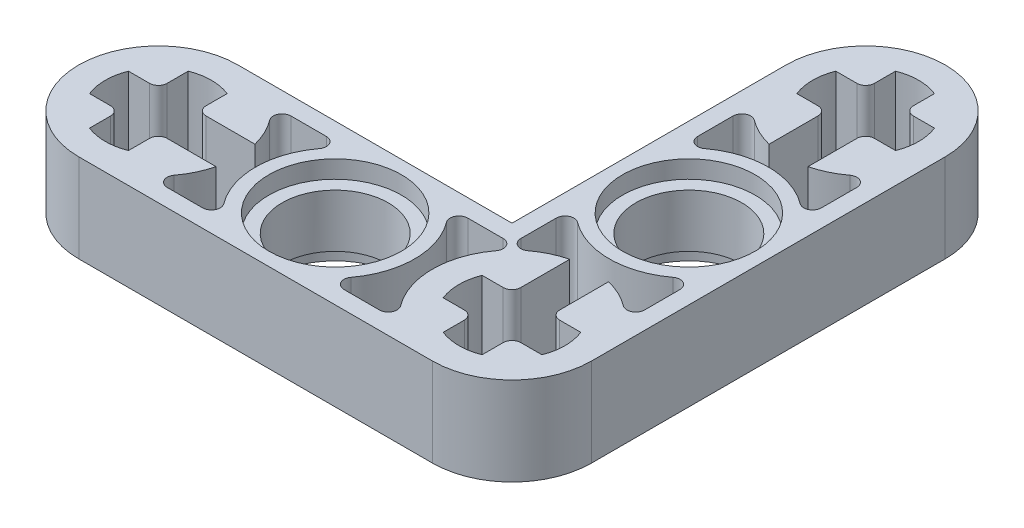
ISO-10303-21;
HEADER;
FILE_DESCRIPTION(('STEP AP214'),'2;1');
FILE_NAME('part.step','',(''),(''),'','','');
FILE_SCHEMA(('AUTOMOTIVE_DESIGN { 1 0 10303 214 1 1 1 1 }'));
ENDSEC;
DATA;
#1=APPLICATION_CONTEXT('core data for automotive mechanical design processes');
#2=APPLICATION_PROTOCOL_DEFINITION('international standard','automotive_design',2000,#1);
#3=PRODUCT_CONTEXT('',#1,'mechanical');
#4=PRODUCT('Part','Part','',(#3));
#5=PRODUCT_RELATED_PRODUCT_CATEGORY('part','',(#4));
#6=PRODUCT_DEFINITION_FORMATION('','',#4);
#7=PRODUCT_DEFINITION_CONTEXT('part definition',#1,'design');
#8=PRODUCT_DEFINITION('design','',#6,#7);
#9=PRODUCT_DEFINITION_SHAPE('','',#8);
#10=(LENGTH_UNIT() NAMED_UNIT(*) SI_UNIT(.MILLI.,.METRE.));
#11=(NAMED_UNIT(*) PLANE_ANGLE_UNIT() SI_UNIT($,.RADIAN.));
#12=(NAMED_UNIT(*) SI_UNIT($,.STERADIAN.) SOLID_ANGLE_UNIT());
#13=UNCERTAINTY_MEASURE_WITH_UNIT(LENGTH_MEASURE(1.E-05),#10,'distance_accuracy_value','');
#14=(GEOMETRIC_REPRESENTATION_CONTEXT(3) GLOBAL_UNCERTAINTY_ASSIGNED_CONTEXT((#13)) GLOBAL_UNIT_ASSIGNED_CONTEXT((#10,
#11,#12)) REPRESENTATION_CONTEXT('',''));
#15=CARTESIAN_POINT('',(0.,0.,0.));
#16=DIRECTION('',(0.,0.,1.));
#17=DIRECTION('',(1.,0.,0.));
#18=AXIS2_PLACEMENT_3D('',#15,#16,#17);
#19=CARTESIAN_POINT('',(0.,-2.,-8.));
#20=DIRECTION('',(0.,1.,0.));
#21=DIRECTION('',(0.,0.,1.));
#22=AXIS2_PLACEMENT_3D('',#19,#20,#21);
#23=CYLINDRICAL_SURFACE('',#22,2.4);
#24=CARTESIAN_POINT('',(0.,1.2,-8.));
#25=DIRECTION('',(0.,1.,0.));
#26=DIRECTION('',(0.,0.,1.));
#27=AXIS2_PLACEMENT_3D('',#24,#25,#26);
#28=CIRCLE('',#27,2.4);
#29=CARTESIAN_POINT('',(0.,1.2,-5.6));
#30=VERTEX_POINT('',#29);
#31=EDGE_CURVE('E597',#30,#30,#28,.F.);
#32=ORIENTED_EDGE('',*,*,#31,.F.);
#33=EDGE_LOOP('',(#32));
#34=FACE_BOUND('',#33,.T.);
#35=CARTESIAN_POINT('',(0.,-1.2,-8.));
#36=DIRECTION('',(0.,-1.,0.));
#37=DIRECTION('',(0.,0.,-1.));
#38=AXIS2_PLACEMENT_3D('',#35,#36,#37);
#39=CIRCLE('',#38,2.4);
#40=CARTESIAN_POINT('',(0.,-1.2,-10.4));
#41=VERTEX_POINT('',#40);
#42=EDGE_CURVE('E40',#41,#41,#39,.F.);
#43=ORIENTED_EDGE('',*,*,#42,.F.);
#44=EDGE_LOOP('',(#43));
#45=FACE_BOUND('',#44,.T.);
#46=ADVANCED_FACE('F36',(#34,#45),#23,.F.);
#47=CARTESIAN_POINT('',(-8.,-2.,0.));
#48=DIRECTION('',(0.,1.,0.));
#49=DIRECTION('',(0.,0.,1.));
#50=AXIS2_PLACEMENT_3D('',#47,#48,#49);
#51=CYLINDRICAL_SURFACE('',#50,2.4);
#52=CARTESIAN_POINT('',(-8.,1.2,0.));
#53=DIRECTION('',(0.,1.,0.));
#54=DIRECTION('',(0.,0.,1.));
#55=AXIS2_PLACEMENT_3D('',#52,#53,#54);
#56=CIRCLE('',#55,2.4);
#57=CARTESIAN_POINT('',(-8.,1.2,2.4));
#58=VERTEX_POINT('',#57);
#59=EDGE_CURVE('E1278',#58,#58,#56,.F.);
#60=ORIENTED_EDGE('',*,*,#59,.F.);
#61=EDGE_LOOP('',(#60));
#62=FACE_BOUND('',#61,.T.);
#63=CARTESIAN_POINT('',(-8.,-1.2,0.));
#64=DIRECTION('',(0.,-1.,0.));
#65=DIRECTION('',(0.,0.,-1.));
#66=AXIS2_PLACEMENT_3D('',#63,#64,#65);
#67=CIRCLE('',#66,2.4);
#68=CARTESIAN_POINT('',(-8.,-1.2,-2.4));
#69=VERTEX_POINT('',#68);
#70=EDGE_CURVE('E1283',#69,#69,#67,.F.);
#71=ORIENTED_EDGE('',*,*,#70,.F.);
#72=EDGE_LOOP('',(#71));
#73=FACE_BOUND('',#72,.T.);
#74=ADVANCED_FACE('F1434',(#62,#73),#51,.F.);
#75=CARTESIAN_POINT('',(-16.,-2.,0.));
#76=DIRECTION('',(0.,1.,0.));
#77=DIRECTION('',(0.,0.,1.));
#78=AXIS2_PLACEMENT_3D('',#75,#76,#77);
#79=CYLINDRICAL_SURFACE('',#78,3.60000000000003);
#80=DIRECTION('',(0.,1.,0.));
#81=VECTOR('',#80,1.);
#82=CARTESIAN_POINT('',(-16.,-2.,3.60000000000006));
#83=LINE('',#82,#81);
#84=CARTESIAN_POINT('',(-16.,-2.,3.60000000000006));
#85=VERTEX_POINT('',#84);
#86=CARTESIAN_POINT('',(-16.,2.,3.60000000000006));
#87=VERTEX_POINT('',#86);
#88=EDGE_CURVE('E1266',#85,#87,#83,.T.);
#89=ORIENTED_EDGE('',*,*,#88,.T.);
#90=CARTESIAN_POINT('',(-16.,2.,0.));
#91=DIRECTION('',(0.,1.,0.));
#92=DIRECTION('',(0.,0.,1.));
#93=AXIS2_PLACEMENT_3D('',#90,#91,#92);
#94=CIRCLE('',#93,3.60000000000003);
#95=CARTESIAN_POINT('',(-16.,2.,-3.6));
#96=VERTEX_POINT('',#95);
#97=EDGE_CURVE('E837',#96,#87,#94,.T.);
#98=ORIENTED_EDGE('',*,*,#97,.F.);
#99=DIRECTION('',(0.,1.,0.));
#100=VECTOR('',#99,1.);
#101=CARTESIAN_POINT('',(-16.,-2.,-3.6));
#102=LINE('',#101,#100);
#103=CARTESIAN_POINT('',(-16.,-2.,-3.6));
#104=VERTEX_POINT('',#103);
#105=EDGE_CURVE('E11',#104,#96,#102,.T.);
#106=ORIENTED_EDGE('',*,*,#105,.F.);
#107=CARTESIAN_POINT('',(-16.,-2.,0.));
#108=DIRECTION('',(0.,1.,0.));
#109=DIRECTION('',(0.,0.,1.));
#110=AXIS2_PLACEMENT_3D('',#107,#108,#109);
#111=CIRCLE('',#110,3.60000000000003);
#112=EDGE_CURVE('E1201',#104,#85,#111,.T.);
#113=ORIENTED_EDGE('',*,*,#112,.T.);
#114=EDGE_LOOP('',(#89,#98,#106,#113));
#115=FACE_BOUND('',#114,.T.);
#116=ADVANCED_FACE('F38',(#115),#79,.T.);
#117=CARTESIAN_POINT('',(-16.,-2.,-3.6));
#118=DIRECTION('',(0.,0.,-1.));
#119=DIRECTION('',(-1.,0.,0.));
#120=AXIS2_PLACEMENT_3D('',#117,#118,#119);
#121=PLANE('',#120);
#122=ORIENTED_EDGE('',*,*,#105,.T.);
#123=DIRECTION('',(-1.,0.,0.));
#124=VECTOR('',#123,1.);
#125=CARTESIAN_POINT('',(-16.,2.,-3.6));
#126=LINE('',#125,#124);
#127=CARTESIAN_POINT('',(-3.60000000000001,2.,-3.59999999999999));
#128=VERTEX_POINT('',#127);
#129=EDGE_CURVE('E855',#128,#96,#126,.T.);
#130=ORIENTED_EDGE('',*,*,#129,.F.);
#131=DIRECTION('',(0.,1.,0.));
#132=VECTOR('',#131,1.);
#133=CARTESIAN_POINT('',(-3.60000000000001,-2.,-3.59999999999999));
#134=LINE('',#133,#132);
#135=CARTESIAN_POINT('',(-3.60000000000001,-2.,-3.59999999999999));
#136=VERTEX_POINT('',#135);
#137=EDGE_CURVE('E45',#136,#128,#134,.T.);
#138=ORIENTED_EDGE('',*,*,#137,.F.);
#139=DIRECTION('',(-1.,0.,0.));
#140=VECTOR('',#139,1.);
#141=CARTESIAN_POINT('',(-16.,-2.,-3.6));
#142=LINE('',#141,#140);
#143=EDGE_CURVE('E1264',#136,#104,#142,.T.);
#144=ORIENTED_EDGE('',*,*,#143,.T.);
#145=EDGE_LOOP('',(#122,#130,#138,#144));
#146=FACE_BOUND('',#145,.T.);
#147=ADVANCED_FACE('F1548',(#146),#121,.T.);
#148=CARTESIAN_POINT('',(-3.60000000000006,-2.,-16.));
#149=DIRECTION('',(-1.,0.,0.));
#150=DIRECTION('',(0.,0.,1.));
#151=AXIS2_PLACEMENT_3D('',#148,#149,#150);
#152=PLANE('',#151);
#153=ORIENTED_EDGE('',*,*,#137,.T.);
#154=DIRECTION('',(0.,0.,1.));
#155=VECTOR('',#154,1.);
#156=CARTESIAN_POINT('',(-3.60000000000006,2.,-16.));
#157=LINE('',#156,#155);
#158=CARTESIAN_POINT('',(-3.60000000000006,2.,-16.));
#159=VERTEX_POINT('',#158);
#160=EDGE_CURVE('E852',#159,#128,#157,.T.);
#161=ORIENTED_EDGE('',*,*,#160,.F.);
#162=DIRECTION('',(0.,1.,0.));
#163=VECTOR('',#162,1.);
#164=CARTESIAN_POINT('',(-3.60000000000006,-2.,-16.));
#165=LINE('',#164,#163);
#166=CARTESIAN_POINT('',(-3.60000000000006,-2.,-16.));
#167=VERTEX_POINT('',#166);
#168=EDGE_CURVE('E1269',#167,#159,#165,.T.);
#169=ORIENTED_EDGE('',*,*,#168,.F.);
#170=DIRECTION('',(0.,0.,1.));
#171=VECTOR('',#170,1.);
#172=CARTESIAN_POINT('',(-3.60000000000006,-2.,-16.));
#173=LINE('',#172,#171);
#174=EDGE_CURVE('E1261',#167,#136,#173,.T.);
#175=ORIENTED_EDGE('',*,*,#174,.T.);
#176=EDGE_LOOP('',(#153,#161,#169,#175));
#177=FACE_BOUND('',#176,.T.);
#178=ADVANCED_FACE('F1551',(#177),#152,.T.);
#179=CARTESIAN_POINT('',(0.,-2.,-16.));
#180=DIRECTION('',(0.,1.,0.));
#181=DIRECTION('',(0.,0.,1.));
#182=AXIS2_PLACEMENT_3D('',#179,#180,#181);
#183=CYLINDRICAL_SURFACE('',#182,3.6);
#184=ORIENTED_EDGE('',*,*,#168,.T.);
#185=CARTESIAN_POINT('',(0.,2.,-16.));
#186=DIRECTION('',(0.,1.,0.));
#187=DIRECTION('',(0.,0.,1.));
#188=AXIS2_PLACEMENT_3D('',#185,#186,#187);
#189=CIRCLE('',#188,3.6);
#190=CARTESIAN_POINT('',(3.6,2.,-16.));
#191=VERTEX_POINT('',#190);
#192=EDGE_CURVE('E849',#191,#159,#189,.T.);
#193=ORIENTED_EDGE('',*,*,#192,.F.);
#194=DIRECTION('',(0.,1.,0.));
#195=VECTOR('',#194,1.);
#196=CARTESIAN_POINT('',(3.6,-2.,-16.));
#197=LINE('',#196,#195);
#198=CARTESIAN_POINT('',(3.6,-2.,-16.));
#199=VERTEX_POINT('',#198);
#200=EDGE_CURVE('E1271',#199,#191,#197,.T.);
#201=ORIENTED_EDGE('',*,*,#200,.F.);
#202=CARTESIAN_POINT('',(0.,-2.,-16.));
#203=DIRECTION('',(0.,1.,0.));
#204=DIRECTION('',(0.,0.,1.));
#205=AXIS2_PLACEMENT_3D('',#202,#203,#204);
#206=CIRCLE('',#205,3.6);
#207=EDGE_CURVE('E1258',#199,#167,#206,.T.);
#208=ORIENTED_EDGE('',*,*,#207,.T.);
#209=EDGE_LOOP('',(#184,#193,#201,#208));
#210=FACE_BOUND('',#209,.T.);
#211=ADVANCED_FACE('F1555',(#210),#183,.T.);
#212=CARTESIAN_POINT('',(3.6,-2.,0.));
#213=DIRECTION('',(1.,0.,0.));
#214=DIRECTION('',(0.,0.,-1.));
#215=AXIS2_PLACEMENT_3D('',#212,#213,#214);
#216=PLANE('',#215);
#217=ORIENTED_EDGE('',*,*,#200,.T.);
#218=DIRECTION('',(0.,0.,-1.));
#219=VECTOR('',#218,1.);
#220=CARTESIAN_POINT('',(3.6,2.,0.));
#221=LINE('',#220,#219);
#222=CARTESIAN_POINT('',(3.6,2.,0.));
#223=VERTEX_POINT('',#222);
#224=EDGE_CURVE('E846',#223,#191,#221,.T.);
#225=ORIENTED_EDGE('',*,*,#224,.F.);
#226=DIRECTION('',(0.,1.,0.));
#227=VECTOR('',#226,1.);
#228=CARTESIAN_POINT('',(3.6,-2.,0.));
#229=LINE('',#228,#227);
#230=CARTESIAN_POINT('',(3.6,-2.,0.));
#231=VERTEX_POINT('',#230);
#232=EDGE_CURVE('E1273',#231,#223,#229,.T.);
#233=ORIENTED_EDGE('',*,*,#232,.F.);
#234=DIRECTION('',(0.,0.,-1.));
#235=VECTOR('',#234,1.);
#236=CARTESIAN_POINT('',(3.6,-2.,0.));
#237=LINE('',#236,#235);
#238=EDGE_CURVE('E1255',#231,#199,#237,.T.);
#239=ORIENTED_EDGE('',*,*,#238,.T.);
#240=EDGE_LOOP('',(#217,#225,#233,#239));
#241=FACE_BOUND('',#240,.T.);
#242=ADVANCED_FACE('F1559',(#241),#216,.T.);
#243=CARTESIAN_POINT('',(0.,-2.,0.));
#244=DIRECTION('',(0.,1.,0.));
#245=DIRECTION('',(0.,0.,1.));
#246=AXIS2_PLACEMENT_3D('',#243,#244,#245);
#247=CYLINDRICAL_SURFACE('',#246,3.6);
#248=ORIENTED_EDGE('',*,*,#232,.T.);
#249=CARTESIAN_POINT('',(0.,2.,0.));
#250=DIRECTION('',(0.,1.,0.));
#251=DIRECTION('',(0.,0.,1.));
#252=AXIS2_PLACEMENT_3D('',#249,#250,#251);
#253=CIRCLE('',#252,3.6);
#254=CARTESIAN_POINT('',(0.,2.,3.6));
#255=VERTEX_POINT('',#254);
#256=EDGE_CURVE('E843',#255,#223,#253,.T.);
#257=ORIENTED_EDGE('',*,*,#256,.F.);
#258=DIRECTION('',(0.,1.,0.));
#259=VECTOR('',#258,1.);
#260=CARTESIAN_POINT('',(0.,-2.,3.6));
#261=LINE('',#260,#259);
#262=CARTESIAN_POINT('',(0.,-2.,3.6));
#263=VERTEX_POINT('',#262);
#264=EDGE_CURVE('E1275',#263,#255,#261,.T.);
#265=ORIENTED_EDGE('',*,*,#264,.F.);
#266=CARTESIAN_POINT('',(0.,-2.,0.));
#267=DIRECTION('',(0.,1.,0.));
#268=DIRECTION('',(0.,0.,1.));
#269=AXIS2_PLACEMENT_3D('',#266,#267,#268);
#270=CIRCLE('',#269,3.6);
#271=EDGE_CURVE('E1252',#263,#231,#270,.T.);
#272=ORIENTED_EDGE('',*,*,#271,.T.);
#273=EDGE_LOOP('',(#248,#257,#265,#272));
#274=FACE_BOUND('',#273,.T.);
#275=ADVANCED_FACE('F1563',(#274),#247,.T.);
#276=CARTESIAN_POINT('',(-16.,-2.,3.60000000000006));
#277=DIRECTION('',(0.,0.,1.));
#278=DIRECTION('',(1.,0.,0.));
#279=AXIS2_PLACEMENT_3D('',#276,#277,#278);
#280=PLANE('',#279);
#281=ORIENTED_EDGE('',*,*,#264,.T.);
#282=DIRECTION('',(1.,0.,0.));
#283=VECTOR('',#282,1.);
#284=CARTESIAN_POINT('',(-16.,2.,3.60000000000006));
#285=LINE('',#284,#283);
#286=EDGE_CURVE('E840',#87,#255,#285,.T.);
#287=ORIENTED_EDGE('',*,*,#286,.F.);
#288=ORIENTED_EDGE('',*,*,#88,.F.);
#289=DIRECTION('',(1.,0.,0.));
#290=VECTOR('',#289,1.);
#291=CARTESIAN_POINT('',(-16.,-2.,3.60000000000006));
#292=LINE('',#291,#290);
#293=EDGE_CURVE('E1249',#85,#263,#292,.T.);
#294=ORIENTED_EDGE('',*,*,#293,.T.);
#295=EDGE_LOOP('',(#281,#287,#288,#294));
#296=FACE_BOUND('',#295,.T.);
#297=ADVANCED_FACE('F1546',(#296),#280,.T.);
#298=CARTESIAN_POINT('',(-16.,-2.,0.));
#299=DIRECTION('',(0.,1.,0.));
#300=DIRECTION('',(0.,0.,1.));
#301=AXIS2_PLACEMENT_3D('',#298,#299,#300);
#302=PLANE('',#301);
#303=CARTESIAN_POINT('',(-8.,-2.,0.));
#304=DIRECTION('',(0.,1.,0.));
#305=DIRECTION('',(0.,0.,1.));
#306=AXIS2_PLACEMENT_3D('',#303,#304,#305);
#307=CIRCLE('',#306,3.);
#308=CARTESIAN_POINT('',(-8.,-2.,3.));
#309=VERTEX_POINT('',#308);
#310=EDGE_CURVE('E1291',#309,#309,#307,.T.);
#311=ORIENTED_EDGE('',*,*,#310,.T.);
#312=EDGE_LOOP('',(#311));
#313=FACE_BOUND('',#312,.T.);
#314=CARTESIAN_POINT('',(0.,-2.,-8.));
#315=DIRECTION('',(0.,1.,0.));
#316=DIRECTION('',(0.,0.,1.));
#317=AXIS2_PLACEMENT_3D('',#314,#315,#316);
#318=CIRCLE('',#317,3.);
#319=CARTESIAN_POINT('',(0.,-2.,-5.));
#320=VERTEX_POINT('',#319);
#321=EDGE_CURVE('E1301',#320,#320,#318,.T.);
#322=ORIENTED_EDGE('',*,*,#321,.T.);
#323=EDGE_LOOP('',(#322));
#324=FACE_BOUND('',#323,.T.);
#325=DIRECTION('',(1.,0.,2.42048135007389E-13));
#326=VECTOR('',#325,1.);
#327=CARTESIAN_POINT('',(-3.20000000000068,-2.,2.79999999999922));
#328=LINE('',#327,#326);
#329=CARTESIAN_POINT('',(-4.80000000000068,-2.,2.79999999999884));
#330=VERTEX_POINT('',#329);
#331=CARTESIAN_POINT('',(-3.20000000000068,-2.,2.79999999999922));
#332=VERTEX_POINT('',#331);
#333=EDGE_CURVE('E588',#330,#332,#328,.T.);
#334=ORIENTED_EDGE('',*,*,#333,.T.);
#335=CARTESIAN_POINT('',(-3.2000000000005,-2.,2.39999999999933));
#336=DIRECTION('',(0.,1.,0.));
#337=DIRECTION('',(0.,0.,1.));
#338=AXIS2_PLACEMENT_3D('',#335,#336,#337);
#339=CIRCLE('',#338,0.399999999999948);
#340=CARTESIAN_POINT('',(-2.88000000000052,-2.,2.1599999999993));
#341=VERTEX_POINT('',#340);
#342=EDGE_CURVE('E858',#332,#341,#339,.T.);
#343=ORIENTED_EDGE('',*,*,#342,.T.);
#344=CARTESIAN_POINT('',(0.,-2.,0.));
#345=DIRECTION('',(0.,-1.,0.));
#346=DIRECTION('',(0.,0.,1.));
#347=AXIS2_PLACEMENT_3D('',#344,#345,#346);
#348=CIRCLE('',#347,3.6);
#349=CARTESIAN_POINT('',(-2.87999999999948,-2.,-2.1600000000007));
#350=VERTEX_POINT('',#349);
#351=EDGE_CURVE('E583',#341,#350,#348,.T.);
#352=ORIENTED_EDGE('',*,*,#351,.T.);
#353=CARTESIAN_POINT('',(-3.19999999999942,-2.,-2.40000000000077));
#354=DIRECTION('',(0.,1.,0.));
#355=DIRECTION('',(0.,0.,-1.));
#356=AXIS2_PLACEMENT_3D('',#353,#354,#355);
#357=CIRCLE('',#356,0.4);
#358=CARTESIAN_POINT('',(-3.19999999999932,-2.,-2.80000000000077));
#359=VERTEX_POINT('',#358);
#360=EDGE_CURVE('E53',#350,#359,#357,.T.);
#361=ORIENTED_EDGE('',*,*,#360,.T.);
#362=DIRECTION('',(-1.,0.,-2.42048135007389E-13));
#363=VECTOR('',#362,1.);
#364=CARTESIAN_POINT('',(-4.79999999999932,-2.,-2.80000000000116));
#365=LINE('',#364,#363);
#366=CARTESIAN_POINT('',(-4.79999999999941,-2.,-2.80000000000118));
#367=VERTEX_POINT('',#366);
#368=EDGE_CURVE('E862',#359,#367,#365,.T.);
#369=ORIENTED_EDGE('',*,*,#368,.T.);
#370=CARTESIAN_POINT('',(-4.79999999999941,-2.,-2.40000000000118));
#371=DIRECTION('',(0.,1.,0.));
#372=DIRECTION('',(0.,0.,-1.));
#373=AXIS2_PLACEMENT_3D('',#370,#371,#372);
#374=CIRCLE('',#373,0.400000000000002);
#375=CARTESIAN_POINT('',(-5.11999999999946,-2.,-2.16000000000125));
#376=VERTEX_POINT('',#375);
#377=EDGE_CURVE('E865',#367,#376,#374,.T.);
#378=ORIENTED_EDGE('',*,*,#377,.T.);
#379=CARTESIAN_POINT('',(-8.,-2.,-1.97579866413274E-12));
#380=DIRECTION('',(0.,-1.,0.));
#381=DIRECTION('',(0.,0.,1.));
#382=AXIS2_PLACEMENT_3D('',#379,#380,#381);
#383=CIRCLE('',#382,3.6);
#384=CARTESIAN_POINT('',(-5.12000000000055,-2.,2.15999999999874));
#385=VERTEX_POINT('',#384);
#386=EDGE_CURVE('E868',#376,#385,#383,.T.);
#387=ORIENTED_EDGE('',*,*,#386,.T.);
#388=CARTESIAN_POINT('',(-4.80000000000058,-2.,2.39999999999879));
#389=DIRECTION('',(0.,1.,0.));
#390=DIRECTION('',(0.,0.,-1.));
#391=AXIS2_PLACEMENT_3D('',#388,#389,#390);
#392=CIRCLE('',#391,0.400000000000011);
#393=EDGE_CURVE('E871',#385,#330,#392,.T.);
#394=ORIENTED_EDGE('',*,*,#393,.T.);
#395=EDGE_LOOP('',(#334,#343,#352,#361,#369,#378,#387,#394));
#396=FACE_BOUND('',#395,.T.);
#397=DIRECTION('',(0.,0.,-1.));
#398=VECTOR('',#397,1.);
#399=CARTESIAN_POINT('',(0.879999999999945,-2.,-17.28));
#400=LINE('',#399,#398);
#401=CARTESIAN_POINT('',(0.879999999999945,-2.,-17.28));
#402=VERTEX_POINT('',#401);
#403=CARTESIAN_POINT('',(0.879999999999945,-2.,-18.2328457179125));
#404=VERTEX_POINT('',#403);
#405=EDGE_CURVE('E955',#402,#404,#400,.T.);
#406=ORIENTED_EDGE('',*,*,#405,.T.);
#407=CARTESIAN_POINT('',(0.,-2.,-16.));
#408=DIRECTION('',(0.,1.,0.));
#409=DIRECTION('',(0.,0.,1.));
#410=AXIS2_PLACEMENT_3D('',#407,#408,#409);
#411=CIRCLE('',#410,2.4);
#412=CARTESIAN_POINT('',(-0.880000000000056,-2.,-18.2328457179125));
#413=VERTEX_POINT('',#412);
#414=EDGE_CURVE('E877',#404,#413,#411,.T.);
#415=ORIENTED_EDGE('',*,*,#414,.T.);
#416=DIRECTION('',(0.,0.,1.));
#417=VECTOR('',#416,1.);
#418=CARTESIAN_POINT('',(-0.880000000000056,-2.,-18.2328457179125));
#419=LINE('',#418,#417);
#420=CARTESIAN_POINT('',(-0.880000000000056,-2.,-17.28));
#421=VERTEX_POINT('',#420);
#422=EDGE_CURVE('E891',#413,#421,#419,.T.);
#423=ORIENTED_EDGE('',*,*,#422,.T.);
#424=CARTESIAN_POINT('',(-1.28000000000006,-2.,-17.28));
#425=DIRECTION('',(0.,-1.,0.));
#426=DIRECTION('',(0.,0.,-1.));
#427=AXIS2_PLACEMENT_3D('',#424,#425,#426);
#428=CIRCLE('',#427,0.400000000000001);
#429=CARTESIAN_POINT('',(-1.28000000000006,-2.,-16.88));
#430=VERTEX_POINT('',#429);
#431=EDGE_CURVE('E61',#421,#430,#428,.T.);
#432=ORIENTED_EDGE('',*,*,#431,.T.);
#433=DIRECTION('',(-1.,0.,0.));
#434=VECTOR('',#433,1.);
#435=CARTESIAN_POINT('',(-1.28000000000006,-2.,-16.88));
#436=LINE('',#435,#434);
#437=CARTESIAN_POINT('',(-2.23284571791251,-2.,-16.88));
#438=VERTEX_POINT('',#437);
#439=EDGE_CURVE('E895',#430,#438,#436,.T.);
#440=ORIENTED_EDGE('',*,*,#439,.T.);
#441=CARTESIAN_POINT('',(0.,-2.,-16.));
#442=DIRECTION('',(0.,1.,0.));
#443=DIRECTION('',(0.,0.,1.));
#444=AXIS2_PLACEMENT_3D('',#441,#442,#443);
#445=CIRCLE('',#444,2.4);
#446=CARTESIAN_POINT('',(-2.23284571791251,-2.,-15.12));
#447=VERTEX_POINT('',#446);
#448=EDGE_CURVE('E898',#438,#447,#445,.T.);
#449=ORIENTED_EDGE('',*,*,#448,.T.);
#450=DIRECTION('',(1.,0.,0.));
#451=VECTOR('',#450,1.);
#452=CARTESIAN_POINT('',(-2.23284571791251,-2.,-15.12));
#453=LINE('',#452,#451);
#454=CARTESIAN_POINT('',(-1.28000000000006,-2.,-15.12));
#455=VERTEX_POINT('',#454);
#456=EDGE_CURVE('E901',#447,#455,#453,.T.);
#457=ORIENTED_EDGE('',*,*,#456,.T.);
#458=CARTESIAN_POINT('',(-1.28000000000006,-2.,-14.72));
#459=DIRECTION('',(0.,-1.,0.));
#460=DIRECTION('',(0.,0.,1.));
#461=AXIS2_PLACEMENT_3D('',#458,#459,#460);
#462=CIRCLE('',#461,0.4);
#463=CARTESIAN_POINT('',(-0.880000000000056,-2.,-14.72));
#464=VERTEX_POINT('',#463);
#465=EDGE_CURVE('E904',#455,#464,#462,.T.);
#466=ORIENTED_EDGE('',*,*,#465,.T.);
#467=DIRECTION('',(0.,0.,1.));
#468=VECTOR('',#467,1.);
#469=CARTESIAN_POINT('',(-0.880000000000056,-2.,-14.72));
#470=LINE('',#469,#468);
#471=CARTESIAN_POINT('',(-0.88000000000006,-2.,-12.5092121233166));
#472=VERTEX_POINT('',#471);
#473=EDGE_CURVE('E907',#464,#472,#470,.T.);
#474=ORIENTED_EDGE('',*,*,#473,.T.);
#475=CARTESIAN_POINT('',(0.,-2.,-16.));
#476=DIRECTION('',(0.,-1.,0.));
#477=DIRECTION('',(0.,0.,1.));
#478=AXIS2_PLACEMENT_3D('',#475,#476,#477);
#479=CIRCLE('',#478,3.59999999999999);
#480=CARTESIAN_POINT('',(-2.16,-2.,-13.12));
#481=VERTEX_POINT('',#480);
#482=EDGE_CURVE('E910',#472,#481,#479,.T.);
#483=ORIENTED_EDGE('',*,*,#482,.T.);
#484=CARTESIAN_POINT('',(-2.4,-2.,-12.8));
#485=DIRECTION('',(0.,1.,0.));
#486=DIRECTION('',(0.,0.,1.));
#487=AXIS2_PLACEMENT_3D('',#484,#485,#486);
#488=CIRCLE('',#487,0.4);
#489=CARTESIAN_POINT('',(-2.8,-2.,-12.8));
#490=VERTEX_POINT('',#489);
#491=EDGE_CURVE('E913',#481,#490,#488,.T.);
#492=ORIENTED_EDGE('',*,*,#491,.T.);
#493=DIRECTION('',(0.,0.,1.));
#494=VECTOR('',#493,1.);
#495=CARTESIAN_POINT('',(-2.8,-2.,-11.2));
#496=LINE('',#495,#494);
#497=CARTESIAN_POINT('',(-2.8,-2.,-11.2));
#498=VERTEX_POINT('',#497);
#499=EDGE_CURVE('E916',#490,#498,#496,.T.);
#500=ORIENTED_EDGE('',*,*,#499,.T.);
#501=CARTESIAN_POINT('',(-2.4,-2.,-11.2));
#502=DIRECTION('',(0.,1.,0.));
#503=DIRECTION('',(0.,0.,1.));
#504=AXIS2_PLACEMENT_3D('',#501,#502,#503);
#505=CIRCLE('',#504,0.4);
#506=CARTESIAN_POINT('',(-2.16,-2.,-10.88));
#507=VERTEX_POINT('',#506);
#508=EDGE_CURVE('E919',#498,#507,#505,.T.);
#509=ORIENTED_EDGE('',*,*,#508,.T.);
#510=CARTESIAN_POINT('',(0.,-2.,-8.));
#511=DIRECTION('',(0.,-1.,0.));
#512=DIRECTION('',(0.,0.,1.));
#513=AXIS2_PLACEMENT_3D('',#510,#511,#512);
#514=CIRCLE('',#513,3.6);
#515=CARTESIAN_POINT('',(2.16,-2.,-10.88));
#516=VERTEX_POINT('',#515);
#517=EDGE_CURVE('E922',#507,#516,#514,.T.);
#518=ORIENTED_EDGE('',*,*,#517,.T.);
#519=CARTESIAN_POINT('',(2.4,-2.,-11.2));
#520=DIRECTION('',(0.,1.,0.));
#521=DIRECTION('',(0.,0.,1.));
#522=AXIS2_PLACEMENT_3D('',#519,#520,#521);
#523=CIRCLE('',#522,0.4);
#524=CARTESIAN_POINT('',(2.8,-2.,-11.2));
#525=VERTEX_POINT('',#524);
#526=EDGE_CURVE('E925',#516,#525,#523,.T.);
#527=ORIENTED_EDGE('',*,*,#526,.T.);
#528=DIRECTION('',(0.,0.,-1.));
#529=VECTOR('',#528,1.);
#530=CARTESIAN_POINT('',(2.8,-2.,-12.8));
#531=LINE('',#530,#529);
#532=CARTESIAN_POINT('',(2.8,-2.,-12.8));
#533=VERTEX_POINT('',#532);
#534=EDGE_CURVE('E928',#525,#533,#531,.T.);
#535=ORIENTED_EDGE('',*,*,#534,.T.);
#536=CARTESIAN_POINT('',(2.4,-2.,-12.8));
#537=DIRECTION('',(0.,1.,0.));
#538=DIRECTION('',(0.,0.,1.));
#539=AXIS2_PLACEMENT_3D('',#536,#537,#538);
#540=CIRCLE('',#539,0.4);
#541=CARTESIAN_POINT('',(2.16,-2.,-13.12));
#542=VERTEX_POINT('',#541);
#543=EDGE_CURVE('E931',#533,#542,#540,.T.);
#544=ORIENTED_EDGE('',*,*,#543,.T.);
#545=CARTESIAN_POINT('',(0.,-2.,-16.));
#546=DIRECTION('',(0.,-1.,0.));
#547=DIRECTION('',(0.,0.,1.));
#548=AXIS2_PLACEMENT_3D('',#545,#546,#547);
#549=CIRCLE('',#548,3.59999999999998);
#550=CARTESIAN_POINT('',(0.879999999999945,-2.,-12.5092121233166));
#551=VERTEX_POINT('',#550);
#552=EDGE_CURVE('E934',#542,#551,#549,.T.);
#553=ORIENTED_EDGE('',*,*,#552,.T.);
#554=DIRECTION('',(0.,0.,-1.));
#555=VECTOR('',#554,1.);
#556=CARTESIAN_POINT('',(0.879999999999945,-2.,-13.7671542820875));
#557=LINE('',#556,#555);
#558=CARTESIAN_POINT('',(0.879999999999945,-2.,-14.72));
#559=VERTEX_POINT('',#558);
#560=EDGE_CURVE('E937',#551,#559,#557,.T.);
#561=ORIENTED_EDGE('',*,*,#560,.T.);
#562=CARTESIAN_POINT('',(1.27999999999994,-2.,-14.72));
#563=DIRECTION('',(0.,-1.,0.));
#564=DIRECTION('',(0.,0.,-1.));
#565=AXIS2_PLACEMENT_3D('',#562,#563,#564);
#566=CIRCLE('',#565,0.4);
#567=CARTESIAN_POINT('',(1.27999999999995,-2.,-15.12));
#568=VERTEX_POINT('',#567);
#569=EDGE_CURVE('E940',#559,#568,#566,.T.);
#570=ORIENTED_EDGE('',*,*,#569,.T.);
#571=DIRECTION('',(1.,0.,0.));
#572=VECTOR('',#571,1.);
#573=CARTESIAN_POINT('',(1.27999999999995,-2.,-15.12));
#574=LINE('',#573,#572);
#575=CARTESIAN_POINT('',(2.2328457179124,-2.,-15.12));
#576=VERTEX_POINT('',#575);
#577=EDGE_CURVE('E943',#568,#576,#574,.T.);
#578=ORIENTED_EDGE('',*,*,#577,.T.);
#579=CARTESIAN_POINT('',(0.,-2.,-16.));
#580=DIRECTION('',(0.,1.,0.));
#581=DIRECTION('',(0.,0.,1.));
#582=AXIS2_PLACEMENT_3D('',#579,#580,#581);
#583=CIRCLE('',#582,2.4);
#584=CARTESIAN_POINT('',(2.2328457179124,-2.,-16.88));
#585=VERTEX_POINT('',#584);
#586=EDGE_CURVE('E946',#576,#585,#583,.T.);
#587=ORIENTED_EDGE('',*,*,#586,.T.);
#588=DIRECTION('',(-1.,0.,0.));
#589=VECTOR('',#588,1.);
#590=CARTESIAN_POINT('',(2.2328457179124,-2.,-16.88));
#591=LINE('',#590,#589);
#592=CARTESIAN_POINT('',(1.27999999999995,-2.,-16.88));
#593=VERTEX_POINT('',#592);
#594=EDGE_CURVE('E949',#585,#593,#591,.T.);
#595=ORIENTED_EDGE('',*,*,#594,.T.);
#596=CARTESIAN_POINT('',(1.27999999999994,-2.,-17.28));
#597=DIRECTION('',(0.,-1.,0.));
#598=DIRECTION('',(0.,0.,-1.));
#599=AXIS2_PLACEMENT_3D('',#596,#597,#598);
#600=CIRCLE('',#599,0.4);
#601=EDGE_CURVE('E952',#593,#402,#600,.T.);
#602=ORIENTED_EDGE('',*,*,#601,.T.);
#603=EDGE_LOOP('',(#406,#415,#423,#432,#440,#449,#457,#466,#474,#483,#492,#500,#509,#518,#527,
#535,#544,#553,#561,#570,#578,#587,#595,#602));
#604=FACE_BOUND('',#603,.T.);
#605=DIRECTION('',(0.,0.,-1.));
#606=VECTOR('',#605,1.);
#607=CARTESIAN_POINT('',(-15.12,-2.,-1.27999999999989));
#608=LINE('',#607,#606);
#609=CARTESIAN_POINT('',(-15.12,-2.,-1.27999999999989));
#610=VERTEX_POINT('',#609);
#611=CARTESIAN_POINT('',(-15.12,-2.,-2.23284571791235));
#612=VERTEX_POINT('',#611);
#613=EDGE_CURVE('E1075',#610,#612,#608,.T.);
#614=ORIENTED_EDGE('',*,*,#613,.T.);
#615=CARTESIAN_POINT('',(-16.,-2.,1.1172740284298E-13));
#616=DIRECTION('',(0.,1.,0.));
#617=DIRECTION('',(0.,0.,1.));
#618=AXIS2_PLACEMENT_3D('',#615,#616,#617);
#619=CIRCLE('',#618,2.4);
#620=CARTESIAN_POINT('',(-16.88,-2.,-2.23284571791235));
#621=VERTEX_POINT('',#620);
#622=EDGE_CURVE('E961',#612,#621,#619,.T.);
#623=ORIENTED_EDGE('',*,*,#622,.T.);
#624=DIRECTION('',(0.,0.,1.));
#625=VECTOR('',#624,1.);
#626=CARTESIAN_POINT('',(-16.88,-2.,-2.23284571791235));
#627=LINE('',#626,#625);
#628=CARTESIAN_POINT('',(-16.88,-2.,-1.27999999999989));
#629=VERTEX_POINT('',#628);
#630=EDGE_CURVE('E1009',#621,#629,#627,.T.);
#631=ORIENTED_EDGE('',*,*,#630,.T.);
#632=CARTESIAN_POINT('',(-17.28,-2.,-1.27999999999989));
#633=DIRECTION('',(0.,-1.,0.));
#634=DIRECTION('',(0.,0.,-1.));
#635=AXIS2_PLACEMENT_3D('',#632,#633,#634);
#636=CIRCLE('',#635,0.400000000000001);
#637=CARTESIAN_POINT('',(-17.28,-2.,-0.879999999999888));
#638=VERTEX_POINT('',#637);
#639=EDGE_CURVE('E1012',#629,#638,#636,.T.);
#640=ORIENTED_EDGE('',*,*,#639,.T.);
#641=DIRECTION('',(-1.,0.,0.));
#642=VECTOR('',#641,1.);
#643=CARTESIAN_POINT('',(-17.28,-2.,-0.879999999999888));
#644=LINE('',#643,#642);
#645=CARTESIAN_POINT('',(-18.2328457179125,-2.,-0.879999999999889));
#646=VERTEX_POINT('',#645);
#647=EDGE_CURVE('E1015',#638,#646,#644,.T.);
#648=ORIENTED_EDGE('',*,*,#647,.T.);
#649=CARTESIAN_POINT('',(-16.,-2.,1.1172740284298E-13));
#650=DIRECTION('',(0.,1.,0.));
#651=DIRECTION('',(0.,0.,1.));
#652=AXIS2_PLACEMENT_3D('',#649,#650,#651);
#653=CIRCLE('',#652,2.4);
#654=CARTESIAN_POINT('',(-18.2328457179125,-2.,0.880000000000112));
#655=VERTEX_POINT('',#654);
#656=EDGE_CURVE('E1018',#646,#655,#653,.T.);
#657=ORIENTED_EDGE('',*,*,#656,.T.);
#658=DIRECTION('',(1.,0.,0.));
#659=VECTOR('',#658,1.);
#660=CARTESIAN_POINT('',(-18.2328457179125,-2.,0.880000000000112));
#661=LINE('',#660,#659);
#662=CARTESIAN_POINT('',(-17.28,-2.,0.880000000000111));
#663=VERTEX_POINT('',#662);
#664=EDGE_CURVE('E1021',#655,#663,#661,.T.);
#665=ORIENTED_EDGE('',*,*,#664,.T.);
#666=CARTESIAN_POINT('',(-17.28,-2.,1.28000000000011));
#667=DIRECTION('',(0.,-1.,0.));
#668=DIRECTION('',(0.,0.,1.));
#669=AXIS2_PLACEMENT_3D('',#666,#667,#668);
#670=CIRCLE('',#669,0.400000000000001);
#671=CARTESIAN_POINT('',(-16.88,-2.,1.28000000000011));
#672=VERTEX_POINT('',#671);
#673=EDGE_CURVE('E1024',#663,#672,#670,.T.);
#674=ORIENTED_EDGE('',*,*,#673,.T.);
#675=DIRECTION('',(0.,0.,1.));
#676=VECTOR('',#675,1.);
#677=CARTESIAN_POINT('',(-16.88,-2.,1.28000000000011));
#678=LINE('',#677,#676);
#679=CARTESIAN_POINT('',(-16.88,-2.,2.23284571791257));
#680=VERTEX_POINT('',#679);
#681=EDGE_CURVE('E1027',#672,#680,#678,.T.);
#682=ORIENTED_EDGE('',*,*,#681,.T.);
#683=CARTESIAN_POINT('',(-16.,-2.,1.1172740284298E-13));
#684=DIRECTION('',(0.,1.,0.));
#685=DIRECTION('',(0.,0.,1.));
#686=AXIS2_PLACEMENT_3D('',#683,#684,#685);
#687=CIRCLE('',#686,2.4);
#688=CARTESIAN_POINT('',(-15.12,-2.,2.23284571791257));
#689=VERTEX_POINT('',#688);
#690=EDGE_CURVE('E1030',#680,#689,#687,.T.);
#691=ORIENTED_EDGE('',*,*,#690,.T.);
#692=DIRECTION('',(0.,0.,-1.));
#693=VECTOR('',#692,1.);
#694=CARTESIAN_POINT('',(-15.12,-2.,2.23284571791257));
#695=LINE('',#694,#693);
#696=CARTESIAN_POINT('',(-15.12,-2.,1.28000000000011));
#697=VERTEX_POINT('',#696);
#698=EDGE_CURVE('E1033',#689,#697,#695,.T.);
#699=ORIENTED_EDGE('',*,*,#698,.T.);
#700=CARTESIAN_POINT('',(-14.72,-2.,1.28000000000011));
#701=DIRECTION('',(0.,-1.,0.));
#702=DIRECTION('',(0.,0.,-1.));
#703=AXIS2_PLACEMENT_3D('',#700,#701,#702);
#704=CIRCLE('',#703,0.4);
#705=CARTESIAN_POINT('',(-14.72,-2.,0.880000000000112));
#706=VERTEX_POINT('',#705);
#707=EDGE_CURVE('E1036',#697,#706,#704,.T.);
#708=ORIENTED_EDGE('',*,*,#707,.T.);
#709=DIRECTION('',(1.,0.,0.));
#710=VECTOR('',#709,1.);
#711=CARTESIAN_POINT('',(-14.72,-2.,0.880000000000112));
#712=LINE('',#711,#710);
#713=CARTESIAN_POINT('',(-12.5092121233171,-2.,0.880000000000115));
#714=VERTEX_POINT('',#713);
#715=EDGE_CURVE('E1039',#706,#714,#712,.T.);
#716=ORIENTED_EDGE('',*,*,#715,.T.);
#717=CARTESIAN_POINT('',(-16.,-2.,-1.91993496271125E-12));
#718=DIRECTION('',(0.,-1.,0.));
#719=DIRECTION('',(0.,0.,1.));
#720=AXIS2_PLACEMENT_3D('',#717,#718,#719);
#721=CIRCLE('',#720,3.60000000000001);
#722=CARTESIAN_POINT('',(-13.1199999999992,-2.,2.159999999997));
#723=VERTEX_POINT('',#722);
#724=EDGE_CURVE('E1042',#714,#723,#721,.T.);
#725=ORIENTED_EDGE('',*,*,#724,.T.);
#726=CARTESIAN_POINT('',(-12.7999999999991,-2.,2.39999999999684));
#727=DIRECTION('',(0.,1.,0.));
#728=DIRECTION('',(0.,0.,-1.));
#729=AXIS2_PLACEMENT_3D('',#726,#727,#728);
#730=CIRCLE('',#729,0.400000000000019);
#731=CARTESIAN_POINT('',(-12.7999999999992,-2.,2.7999999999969));
#732=VERTEX_POINT('',#731);
#733=EDGE_CURVE('E1045',#723,#732,#730,.T.);
#734=ORIENTED_EDGE('',*,*,#733,.T.);
#735=DIRECTION('',(1.,0.,2.42048135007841E-13));
#736=VECTOR('',#735,1.);
#737=CARTESIAN_POINT('',(-11.2000000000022,-2.,2.79999999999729));
#738=LINE('',#737,#736);
#739=CARTESIAN_POINT('',(-11.2000000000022,-2.,2.79999999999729));
#740=VERTEX_POINT('',#739);
#741=EDGE_CURVE('E1048',#732,#740,#738,.T.);
#742=ORIENTED_EDGE('',*,*,#741,.T.);
#743=CARTESIAN_POINT('',(-11.2000000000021,-2.,2.39999999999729));
#744=DIRECTION('',(0.,1.,0.));
#745=DIRECTION('',(0.,0.,1.));
#746=AXIS2_PLACEMENT_3D('',#743,#744,#745);
#747=CIRCLE('',#746,0.4);
#748=CARTESIAN_POINT('',(-10.8800000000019,-2.,2.15999999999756));
#749=VERTEX_POINT('',#748);
#750=EDGE_CURVE('E1051',#740,#749,#747,.T.);
#751=ORIENTED_EDGE('',*,*,#750,.T.);
#752=CARTESIAN_POINT('',(-8.,-2.,0.));
#753=DIRECTION('',(0.,-1.,0.));
#754=DIRECTION('',(0.,0.,1.));
#755=AXIS2_PLACEMENT_3D('',#752,#753,#754);
#756=CIRCLE('',#755,3.6);
#757=CARTESIAN_POINT('',(-10.8799999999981,-2.,-2.16000000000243));
#758=VERTEX_POINT('',#757);
#759=EDGE_CURVE('E1054',#749,#758,#756,.T.);
#760=ORIENTED_EDGE('',*,*,#759,.T.);
#761=CARTESIAN_POINT('',(-11.1999999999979,-2.,-2.40000000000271));
#762=DIRECTION('',(0.,1.,0.));
#763=DIRECTION('',(0.,0.,-1.));
#764=AXIS2_PLACEMENT_3D('',#761,#762,#763);
#765=CIRCLE('',#764,0.4);
#766=CARTESIAN_POINT('',(-11.1999999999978,-2.,-2.80000000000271));
#767=VERTEX_POINT('',#766);
#768=EDGE_CURVE('E1057',#758,#767,#765,.T.);
#769=ORIENTED_EDGE('',*,*,#768,.T.);
#770=DIRECTION('',(-1.,0.,-2.41506033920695E-13));
#771=VECTOR('',#770,1.);
#772=CARTESIAN_POINT('',(-12.8000000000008,-2.,-2.8000000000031));
#773=LINE('',#772,#771);
#774=CARTESIAN_POINT('',(-12.8000000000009,-2.,-2.80000000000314));
#775=VERTEX_POINT('',#774);
#776=EDGE_CURVE('E1060',#767,#775,#773,.T.);
#777=ORIENTED_EDGE('',*,*,#776,.T.);
#778=CARTESIAN_POINT('',(-12.8000000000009,-2.,-2.40000000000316));
#779=DIRECTION('',(0.,1.,0.));
#780=DIRECTION('',(0.,0.,-1.));
#781=AXIS2_PLACEMENT_3D('',#778,#779,#780);
#782=CIRCLE('',#781,0.39999999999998);
#783=CARTESIAN_POINT('',(-13.1200000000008,-2.,-2.16000000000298));
#784=VERTEX_POINT('',#783);
#785=EDGE_CURVE('E1063',#775,#784,#782,.T.);
#786=ORIENTED_EDGE('',*,*,#785,.T.);
#787=CARTESIAN_POINT('',(-16.,-2.,-1.91993496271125E-12));
#788=DIRECTION('',(0.,-1.,0.));
#789=DIRECTION('',(0.,0.,1.));
#790=AXIS2_PLACEMENT_3D('',#787,#788,#789);
#791=CIRCLE('',#790,3.59999999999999);
#792=CARTESIAN_POINT('',(-12.5092121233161,-2.,-0.879999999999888));
#793=VERTEX_POINT('',#792);
#794=EDGE_CURVE('E1066',#784,#793,#791,.T.);
#795=ORIENTED_EDGE('',*,*,#794,.T.);
#796=DIRECTION('',(-1.,0.,0.));
#797=VECTOR('',#796,1.);
#798=CARTESIAN_POINT('',(-13.7671542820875,-2.,-0.879999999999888));
#799=LINE('',#798,#797);
#800=CARTESIAN_POINT('',(-14.72,-2.,-0.879999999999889));
#801=VERTEX_POINT('',#800);
#802=EDGE_CURVE('E1069',#793,#801,#799,.T.);
#803=ORIENTED_EDGE('',*,*,#802,.T.);
#804=CARTESIAN_POINT('',(-14.72,-2.,-1.27999999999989));
#805=DIRECTION('',(0.,-1.,0.));
#806=DIRECTION('',(0.,0.,-1.));
#807=AXIS2_PLACEMENT_3D('',#804,#805,#806);
#808=CIRCLE('',#807,0.4);
#809=EDGE_CURVE('E1072',#801,#610,#808,.T.);
#810=ORIENTED_EDGE('',*,*,#809,.T.);
#811=EDGE_LOOP('',(#614,#623,#631,#640,#648,#657,#665,#674,#682,#691,#699,#708,#716,#725,#734,
#742,#751,#760,#769,#777,#786,#795,#803,#810));
#812=FACE_BOUND('',#811,.T.);
#813=CARTESIAN_POINT('',(1.28,-2.,-1.28));
#814=DIRECTION('',(0.,-1.,0.));
#815=DIRECTION('',(0.,0.,-1.));
#816=AXIS2_PLACEMENT_3D('',#813,#814,#815);
#817=CIRCLE('',#816,0.4);
#818=CARTESIAN_POINT('',(1.28,-2.,-0.88));
#819=VERTEX_POINT('',#818);
#820=CARTESIAN_POINT('',(0.880000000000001,-2.,-1.28));
#821=VERTEX_POINT('',#820);
#822=EDGE_CURVE('E1195',#819,#821,#817,.T.);
#823=ORIENTED_EDGE('',*,*,#822,.T.);
#824=DIRECTION('',(0.,0.,-1.));
#825=VECTOR('',#824,1.);
#826=CARTESIAN_POINT('',(0.88,-2.,-2.23284571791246));
#827=LINE('',#826,#825);
#828=CARTESIAN_POINT('',(0.88,-2.,-3.49078787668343));
#829=VERTEX_POINT('',#828);
#830=EDGE_CURVE('E1081',#821,#829,#827,.T.);
#831=ORIENTED_EDGE('',*,*,#830,.T.);
#832=CARTESIAN_POINT('',(0.,-2.,0.));
#833=DIRECTION('',(0.,-1.,0.));
#834=DIRECTION('',(0.,0.,1.));
#835=AXIS2_PLACEMENT_3D('',#832,#833,#834);
#836=CIRCLE('',#835,3.6);
#837=CARTESIAN_POINT('',(2.16,-2.,-2.88));
#838=VERTEX_POINT('',#837);
#839=EDGE_CURVE('E1129',#829,#838,#836,.T.);
#840=ORIENTED_EDGE('',*,*,#839,.T.);
#841=CARTESIAN_POINT('',(2.4,-2.,-3.2));
#842=DIRECTION('',(0.,1.,0.));
#843=DIRECTION('',(0.,0.,-1.));
#844=AXIS2_PLACEMENT_3D('',#841,#842,#843);
#845=CIRCLE('',#844,0.4);
#846=CARTESIAN_POINT('',(2.8,-2.,-3.2));
#847=VERTEX_POINT('',#846);
#848=EDGE_CURVE('E1132',#838,#847,#845,.T.);
#849=ORIENTED_EDGE('',*,*,#848,.T.);
#850=DIRECTION('',(0.,0.,-1.));
#851=VECTOR('',#850,1.);
#852=CARTESIAN_POINT('',(2.8,-2.,-4.80000000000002));
#853=LINE('',#852,#851);
#854=CARTESIAN_POINT('',(2.8,-2.,-4.80000000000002));
#855=VERTEX_POINT('',#854);
#856=EDGE_CURVE('E1135',#847,#855,#853,.T.);
#857=ORIENTED_EDGE('',*,*,#856,.T.);
#858=CARTESIAN_POINT('',(2.4,-2.,-4.80000000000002));
#859=DIRECTION('',(0.,1.,0.));
#860=DIRECTION('',(0.,0.,-1.));
#861=AXIS2_PLACEMENT_3D('',#858,#859,#860);
#862=CIRCLE('',#861,0.4);
#863=CARTESIAN_POINT('',(2.16,-2.,-5.12000000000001));
#864=VERTEX_POINT('',#863);
#865=EDGE_CURVE('E1138',#855,#864,#862,.T.);
#866=ORIENTED_EDGE('',*,*,#865,.T.);
#867=CARTESIAN_POINT('',(0.,-2.,-8.));
#868=DIRECTION('',(0.,-1.,0.));
#869=DIRECTION('',(0.,0.,1.));
#870=AXIS2_PLACEMENT_3D('',#867,#868,#869);
#871=CIRCLE('',#870,3.59999999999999);
#872=CARTESIAN_POINT('',(-2.16,-2.,-5.12000000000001));
#873=VERTEX_POINT('',#872);
#874=EDGE_CURVE('E1141',#864,#873,#871,.T.);
#875=ORIENTED_EDGE('',*,*,#874,.T.);
#876=CARTESIAN_POINT('',(-2.4,-2.,-4.80000000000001));
#877=DIRECTION('',(0.,1.,0.));
#878=DIRECTION('',(0.,0.,1.));
#879=AXIS2_PLACEMENT_3D('',#876,#877,#878);
#880=CIRCLE('',#879,0.4);
#881=CARTESIAN_POINT('',(-2.8,-2.,-4.80000000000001));
#882=VERTEX_POINT('',#881);
#883=EDGE_CURVE('E1144',#873,#882,#880,.T.);
#884=ORIENTED_EDGE('',*,*,#883,.T.);
#885=DIRECTION('',(0.,0.,1.));
#886=VECTOR('',#885,1.);
#887=CARTESIAN_POINT('',(-2.8,-2.,-3.2));
#888=LINE('',#887,#886);
#889=CARTESIAN_POINT('',(-2.8,-2.,-3.2));
#890=VERTEX_POINT('',#889);
#891=EDGE_CURVE('E1147',#882,#890,#888,.T.);
#892=ORIENTED_EDGE('',*,*,#891,.T.);
#893=CARTESIAN_POINT('',(-2.4,-2.,-3.2));
#894=DIRECTION('',(0.,1.,0.));
#895=DIRECTION('',(0.,0.,-1.));
#896=AXIS2_PLACEMENT_3D('',#893,#894,#895);
#897=CIRCLE('',#896,0.4);
#898=CARTESIAN_POINT('',(-2.16,-2.,-2.88));
#899=VERTEX_POINT('',#898);
#900=EDGE_CURVE('E1150',#890,#899,#897,.T.);
#901=ORIENTED_EDGE('',*,*,#900,.T.);
#902=CARTESIAN_POINT('',(0.,-2.,0.));
#903=DIRECTION('',(0.,-1.,0.));
#904=DIRECTION('',(0.,0.,1.));
#905=AXIS2_PLACEMENT_3D('',#902,#903,#904);
#906=CIRCLE('',#905,3.6);
#907=CARTESIAN_POINT('',(-0.88,-2.,-3.49078787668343));
#908=VERTEX_POINT('',#907);
#909=EDGE_CURVE('E1153',#899,#908,#906,.T.);
#910=ORIENTED_EDGE('',*,*,#909,.T.);
#911=DIRECTION('',(0.,0.,1.));
#912=VECTOR('',#911,1.);
#913=CARTESIAN_POINT('',(-0.88,-2.,-2.23284571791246));
#914=LINE('',#913,#912);
#915=CARTESIAN_POINT('',(-0.88,-2.,-1.28));
#916=VERTEX_POINT('',#915);
#917=EDGE_CURVE('E1156',#908,#916,#914,.T.);
#918=ORIENTED_EDGE('',*,*,#917,.T.);
#919=CARTESIAN_POINT('',(-1.28,-2.,-1.28));
#920=DIRECTION('',(0.,-1.,0.));
#921=DIRECTION('',(0.,0.,-1.));
#922=AXIS2_PLACEMENT_3D('',#919,#920,#921);
#923=CIRCLE('',#922,0.4);
#924=CARTESIAN_POINT('',(-1.28,-2.,-0.88));
#925=VERTEX_POINT('',#924);
#926=EDGE_CURVE('E1159',#916,#925,#923,.T.);
#927=ORIENTED_EDGE('',*,*,#926,.T.);
#928=DIRECTION('',(-1.,0.,0.));
#929=VECTOR('',#928,1.);
#930=CARTESIAN_POINT('',(-1.28,-2.,-0.88));
#931=LINE('',#930,#929);
#932=CARTESIAN_POINT('',(-2.23284571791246,-2.,-0.88));
#933=VERTEX_POINT('',#932);
#934=EDGE_CURVE('E1162',#925,#933,#931,.T.);
#935=ORIENTED_EDGE('',*,*,#934,.T.);
#936=CARTESIAN_POINT('',(0.,-2.,0.));
#937=DIRECTION('',(0.,1.,0.));
#938=DIRECTION('',(0.,0.,1.));
#939=AXIS2_PLACEMENT_3D('',#936,#937,#938);
#940=CIRCLE('',#939,2.4);
#941=CARTESIAN_POINT('',(-2.23284571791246,-2.,0.88));
#942=VERTEX_POINT('',#941);
#943=EDGE_CURVE('E1165',#933,#942,#940,.T.);
#944=ORIENTED_EDGE('',*,*,#943,.T.);
#945=DIRECTION('',(1.,0.,0.));
#946=VECTOR('',#945,1.);
#947=CARTESIAN_POINT('',(-2.23284571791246,-2.,0.88));
#948=LINE('',#947,#946);
#949=CARTESIAN_POINT('',(-1.28,-2.,0.88));
#950=VERTEX_POINT('',#949);
#951=EDGE_CURVE('E1168',#942,#950,#948,.T.);
#952=ORIENTED_EDGE('',*,*,#951,.T.);
#953=CARTESIAN_POINT('',(-1.28,-2.,1.28));
#954=DIRECTION('',(0.,-1.,0.));
#955=DIRECTION('',(0.,0.,1.));
#956=AXIS2_PLACEMENT_3D('',#953,#954,#955);
#957=CIRCLE('',#956,0.4);
#958=CARTESIAN_POINT('',(-0.88,-2.,1.28));
#959=VERTEX_POINT('',#958);
#960=EDGE_CURVE('E1171',#950,#959,#957,.T.);
#961=ORIENTED_EDGE('',*,*,#960,.T.);
#962=DIRECTION('',(0.,0.,1.));
#963=VECTOR('',#962,1.);
#964=CARTESIAN_POINT('',(-0.88,-2.,1.28));
#965=LINE('',#964,#963);
#966=CARTESIAN_POINT('',(-0.880000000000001,-2.,2.23284571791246));
#967=VERTEX_POINT('',#966);
#968=EDGE_CURVE('E1174',#959,#967,#965,.T.);
#969=ORIENTED_EDGE('',*,*,#968,.T.);
#970=CARTESIAN_POINT('',(0.,-2.,0.));
#971=DIRECTION('',(0.,1.,0.));
#972=DIRECTION('',(0.,0.,1.));
#973=AXIS2_PLACEMENT_3D('',#970,#971,#972);
#974=CIRCLE('',#973,2.4);
#975=CARTESIAN_POINT('',(0.88,-2.,2.23284571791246));
#976=VERTEX_POINT('',#975);
#977=EDGE_CURVE('E1177',#967,#976,#974,.T.);
#978=ORIENTED_EDGE('',*,*,#977,.T.);
#979=DIRECTION('',(0.,0.,-1.));
#980=VECTOR('',#979,1.);
#981=CARTESIAN_POINT('',(0.88,-2.,2.23284571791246));
#982=LINE('',#981,#980);
#983=CARTESIAN_POINT('',(0.880000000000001,-2.,1.28));
#984=VERTEX_POINT('',#983);
#985=EDGE_CURVE('E1180',#976,#984,#982,.T.);
#986=ORIENTED_EDGE('',*,*,#985,.T.);
#987=CARTESIAN_POINT('',(1.28,-2.,1.28));
#988=DIRECTION('',(0.,-1.,0.));
#989=DIRECTION('',(0.,0.,-1.));
#990=AXIS2_PLACEMENT_3D('',#987,#988,#989);
#991=CIRCLE('',#990,0.4);
#992=CARTESIAN_POINT('',(1.28,-2.,0.88));
#993=VERTEX_POINT('',#992);
#994=EDGE_CURVE('E1183',#984,#993,#991,.T.);
#995=ORIENTED_EDGE('',*,*,#994,.T.);
#996=DIRECTION('',(1.,0.,0.));
#997=VECTOR('',#996,1.);
#998=CARTESIAN_POINT('',(1.28,-2.,0.88));
#999=LINE('',#998,#997);
#1000=CARTESIAN_POINT('',(2.23284571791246,-2.,0.880000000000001));
#1001=VERTEX_POINT('',#1000);
#1002=EDGE_CURVE('E1186',#993,#1001,#999,.T.);
#1003=ORIENTED_EDGE('',*,*,#1002,.T.);
#1004=CARTESIAN_POINT('',(0.,-2.,0.));
#1005=DIRECTION('',(0.,1.,0.));
#1006=DIRECTION('',(0.,0.,1.));
#1007=AXIS2_PLACEMENT_3D('',#1004,#1005,#1006);
#1008=CIRCLE('',#1007,2.4);
#1009=CARTESIAN_POINT('',(2.23284571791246,-2.,-0.88));
#1010=VERTEX_POINT('',#1009);
#1011=EDGE_CURVE('E1189',#1001,#1010,#1008,.T.);
#1012=ORIENTED_EDGE('',*,*,#1011,.T.);
#1013=DIRECTION('',(-1.,0.,0.));
#1014=VECTOR('',#1013,1.);
#1015=CARTESIAN_POINT('',(2.23284571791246,-2.,-0.88));
#1016=LINE('',#1015,#1014);
#1017=EDGE_CURVE('E1192',#1010,#819,#1016,.T.);
#1018=ORIENTED_EDGE('',*,*,#1017,.T.);
#1019=EDGE_LOOP('',(#823,#831,#840,#849,#857,#866,#875,#884,#892,#901,#910,#918,#927,#935,#944,
#952,#961,#969,#978,#986,#995,#1003,#1012,#1018));
#1020=FACE_BOUND('',#1019,.T.);
#1021=ORIENTED_EDGE('',*,*,#112,.F.);
#1022=ORIENTED_EDGE('',*,*,#143,.F.);
#1023=ORIENTED_EDGE('',*,*,#174,.F.);
#1024=ORIENTED_EDGE('',*,*,#207,.F.);
#1025=ORIENTED_EDGE('',*,*,#238,.F.);
#1026=ORIENTED_EDGE('',*,*,#271,.F.);
#1027=ORIENTED_EDGE('',*,*,#293,.F.);
#1028=EDGE_LOOP('',(#1021,#1022,#1023,#1024,#1025,#1026,#1027));
#1029=FACE_BOUND('',#1028,.T.);
#1030=ADVANCED_FACE('F1450',(#313,#324,#396,#604,#812,#1020,#1029),#302,.F.);
#1031=CARTESIAN_POINT('',(0.880000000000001,-2.,-1.28));
#1032=DIRECTION('',(1.,0.,0.));
#1033=DIRECTION('',(0.,0.,-1.));
#1034=AXIS2_PLACEMENT_3D('',#1031,#1032,#1033);
#1035=PLANE('',#1034);
#1036=DIRECTION('',(0.,1.,0.));
#1037=VECTOR('',#1036,1.);
#1038=CARTESIAN_POINT('',(0.880000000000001,-2.,-1.28));
#1039=LINE('',#1038,#1037);
#1040=CARTESIAN_POINT('',(0.880000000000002,2.,-1.28));
#1041=VERTEX_POINT('',#1040);
#1042=EDGE_CURVE('E1199',#821,#1041,#1039,.T.);
#1043=ORIENTED_EDGE('',*,*,#1042,.T.);
#1044=DIRECTION('',(0.,0.,-1.));
#1045=VECTOR('',#1044,1.);
#1046=CARTESIAN_POINT('',(0.88,2.,-2.23284571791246));
#1047=LINE('',#1046,#1045);
#1048=CARTESIAN_POINT('',(0.88,2.,-3.49078787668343));
#1049=VERTEX_POINT('',#1048);
#1050=EDGE_CURVE('E765',#1041,#1049,#1047,.T.);
#1051=ORIENTED_EDGE('',*,*,#1050,.T.);
#1052=DIRECTION('',(0.,1.,0.));
#1053=VECTOR('',#1052,1.);
#1054=CARTESIAN_POINT('',(0.88,-2.,-3.49078787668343));
#1055=LINE('',#1054,#1053);
#1056=EDGE_CURVE('E1198',#829,#1049,#1055,.T.);
#1057=ORIENTED_EDGE('',*,*,#1056,.F.);
#1058=ORIENTED_EDGE('',*,*,#830,.F.);
#1059=EDGE_LOOP('',(#1043,#1051,#1057,#1058));
#1060=FACE_BOUND('',#1059,.T.);
#1061=ADVANCED_FACE('F1446',(#1060),#1035,.F.);
#1062=CARTESIAN_POINT('',(1.28,-2.,-1.28));
#1063=DIRECTION('',(0.,1.,0.));
#1064=DIRECTION('',(0.,0.,1.));
#1065=AXIS2_PLACEMENT_3D('',#1062,#1063,#1064);
#1066=CYLINDRICAL_SURFACE('',#1065,0.4);
#1067=DIRECTION('',(0.,1.,0.));
#1068=VECTOR('',#1067,1.);
#1069=CARTESIAN_POINT('',(1.28,-2.,-0.88));
#1070=LINE('',#1069,#1068);
#1071=CARTESIAN_POINT('',(1.28,2.,-0.88));
#1072=VERTEX_POINT('',#1071);
#1073=EDGE_CURVE('E1202',#819,#1072,#1070,.T.);
#1074=ORIENTED_EDGE('',*,*,#1073,.T.);
#1075=CARTESIAN_POINT('',(1.28,2.,-1.28));
#1076=DIRECTION('',(0.,-1.,0.));
#1077=DIRECTION('',(0.,0.,-1.));
#1078=AXIS2_PLACEMENT_3D('',#1075,#1076,#1077);
#1079=CIRCLE('',#1078,0.4);
#1080=EDGE_CURVE('E834',#1072,#1041,#1079,.T.);
#1081=ORIENTED_EDGE('',*,*,#1080,.T.);
#1082=ORIENTED_EDGE('',*,*,#1042,.F.);
#1083=ORIENTED_EDGE('',*,*,#822,.F.);
#1084=EDGE_LOOP('',(#1074,#1081,#1082,#1083));
#1085=FACE_BOUND('',#1084,.T.);
#1086=ADVANCED_FACE('F1449',(#1085),#1066,.T.);
#1087=CARTESIAN_POINT('',(2.23284571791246,-2.,-0.88));
#1088=DIRECTION('',(0.,0.,-1.));
#1089=DIRECTION('',(-1.,0.,0.));
#1090=AXIS2_PLACEMENT_3D('',#1087,#1088,#1089);
#1091=PLANE('',#1090);
#1092=DIRECTION('',(0.,1.,0.));
#1093=VECTOR('',#1092,1.);
#1094=CARTESIAN_POINT('',(2.23284571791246,-2.,-0.88));
#1095=LINE('',#1094,#1093);
#1096=CARTESIAN_POINT('',(2.23284571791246,2.,-0.88));
#1097=VERTEX_POINT('',#1096);
#1098=EDGE_CURVE('E1204',#1010,#1097,#1095,.T.);
#1099=ORIENTED_EDGE('',*,*,#1098,.T.);
#1100=DIRECTION('',(-1.,0.,0.));
#1101=VECTOR('',#1100,1.);
#1102=CARTESIAN_POINT('',(2.23284571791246,2.,-0.88));
#1103=LINE('',#1102,#1101);
#1104=EDGE_CURVE('E831',#1097,#1072,#1103,.T.);
#1105=ORIENTED_EDGE('',*,*,#1104,.T.);
#1106=ORIENTED_EDGE('',*,*,#1073,.F.);
#1107=ORIENTED_EDGE('',*,*,#1017,.F.);
#1108=EDGE_LOOP('',(#1099,#1105,#1106,#1107));
#1109=FACE_BOUND('',#1108,.T.);
#1110=ADVANCED_FACE('F1454',(#1109),#1091,.F.);
#1111=CARTESIAN_POINT('',(0.,-2.,0.));
#1112=DIRECTION('',(0.,1.,0.));
#1113=DIRECTION('',(0.,0.,1.));
#1114=AXIS2_PLACEMENT_3D('',#1111,#1112,#1113);
#1115=CYLINDRICAL_SURFACE('',#1114,2.4);
#1116=DIRECTION('',(0.,1.,0.));
#1117=VECTOR('',#1116,1.);
#1118=CARTESIAN_POINT('',(2.23284571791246,-2.,0.880000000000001));
#1119=LINE('',#1118,#1117);
#1120=CARTESIAN_POINT('',(2.23284571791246,2.,0.880000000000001));
#1121=VERTEX_POINT('',#1120);
#1122=EDGE_CURVE('E1206',#1001,#1121,#1119,.T.);
#1123=ORIENTED_EDGE('',*,*,#1122,.T.);
#1124=CARTESIAN_POINT('',(0.,2.,0.));
#1125=DIRECTION('',(0.,1.,0.));
#1126=DIRECTION('',(0.,0.,1.));
#1127=AXIS2_PLACEMENT_3D('',#1124,#1125,#1126);
#1128=CIRCLE('',#1127,2.4);
#1129=EDGE_CURVE('E828',#1121,#1097,#1128,.T.);
#1130=ORIENTED_EDGE('',*,*,#1129,.T.);
#1131=ORIENTED_EDGE('',*,*,#1098,.F.);
#1132=ORIENTED_EDGE('',*,*,#1011,.F.);
#1133=EDGE_LOOP('',(#1123,#1130,#1131,#1132));
#1134=FACE_BOUND('',#1133,.T.);
#1135=ADVANCED_FACE('F1458',(#1134),#1115,.F.);
#1136=CARTESIAN_POINT('',(1.28,-2.,0.88));
#1137=DIRECTION('',(0.,0.,1.));
#1138=DIRECTION('',(1.,0.,0.));
#1139=AXIS2_PLACEMENT_3D('',#1136,#1137,#1138);
#1140=PLANE('',#1139);
#1141=DIRECTION('',(0.,1.,0.));
#1142=VECTOR('',#1141,1.);
#1143=CARTESIAN_POINT('',(1.28,-2.,0.88));
#1144=LINE('',#1143,#1142);
#1145=CARTESIAN_POINT('',(1.28,2.,0.88));
#1146=VERTEX_POINT('',#1145);
#1147=EDGE_CURVE('E1208',#993,#1146,#1144,.T.);
#1148=ORIENTED_EDGE('',*,*,#1147,.T.);
#1149=DIRECTION('',(1.,0.,0.));
#1150=VECTOR('',#1149,1.);
#1151=CARTESIAN_POINT('',(1.28,2.,0.88));
#1152=LINE('',#1151,#1150);
#1153=EDGE_CURVE('E825',#1146,#1121,#1152,.T.);
#1154=ORIENTED_EDGE('',*,*,#1153,.T.);
#1155=ORIENTED_EDGE('',*,*,#1122,.F.);
#1156=ORIENTED_EDGE('',*,*,#1002,.F.);
#1157=EDGE_LOOP('',(#1148,#1154,#1155,#1156));
#1158=FACE_BOUND('',#1157,.T.);
#1159=ADVANCED_FACE('F1462',(#1158),#1140,.F.);
#1160=CARTESIAN_POINT('',(1.28,-2.,1.28));
#1161=DIRECTION('',(0.,1.,0.));
#1162=DIRECTION('',(0.,0.,1.));
#1163=AXIS2_PLACEMENT_3D('',#1160,#1161,#1162);
#1164=CYLINDRICAL_SURFACE('',#1163,0.4);
#1165=DIRECTION('',(0.,1.,0.));
#1166=VECTOR('',#1165,1.);
#1167=CARTESIAN_POINT('',(0.880000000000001,-2.,1.28));
#1168=LINE('',#1167,#1166);
#1169=CARTESIAN_POINT('',(0.880000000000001,2.,1.28));
#1170=VERTEX_POINT('',#1169);
#1171=EDGE_CURVE('E1210',#984,#1170,#1168,.T.);
#1172=ORIENTED_EDGE('',*,*,#1171,.T.);
#1173=CARTESIAN_POINT('',(1.28,2.,1.28));
#1174=DIRECTION('',(0.,-1.,0.));
#1175=DIRECTION('',(0.,0.,-1.));
#1176=AXIS2_PLACEMENT_3D('',#1173,#1174,#1175);
#1177=CIRCLE('',#1176,0.4);
#1178=EDGE_CURVE('E822',#1170,#1146,#1177,.T.);
#1179=ORIENTED_EDGE('',*,*,#1178,.T.);
#1180=ORIENTED_EDGE('',*,*,#1147,.F.);
#1181=ORIENTED_EDGE('',*,*,#994,.F.);
#1182=EDGE_LOOP('',(#1172,#1179,#1180,#1181));
#1183=FACE_BOUND('',#1182,.T.);
#1184=ADVANCED_FACE('F1466',(#1183),#1164,.T.);
#1185=CARTESIAN_POINT('',(0.88,-2.,2.23284571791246));
#1186=DIRECTION('',(1.,0.,0.));
#1187=DIRECTION('',(0.,0.,-1.));
#1188=AXIS2_PLACEMENT_3D('',#1185,#1186,#1187);
#1189=PLANE('',#1188);
#1190=DIRECTION('',(0.,1.,0.));
#1191=VECTOR('',#1190,1.);
#1192=CARTESIAN_POINT('',(0.88,-2.,2.23284571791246));
#1193=LINE('',#1192,#1191);
#1194=CARTESIAN_POINT('',(0.88,2.,2.23284571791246));
#1195=VERTEX_POINT('',#1194);
#1196=EDGE_CURVE('E1212',#976,#1195,#1193,.T.);
#1197=ORIENTED_EDGE('',*,*,#1196,.T.);
#1198=DIRECTION('',(0.,0.,-1.));
#1199=VECTOR('',#1198,1.);
#1200=CARTESIAN_POINT('',(0.88,2.,2.23284571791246));
#1201=LINE('',#1200,#1199);
#1202=EDGE_CURVE('E819',#1195,#1170,#1201,.T.);
#1203=ORIENTED_EDGE('',*,*,#1202,.T.);
#1204=ORIENTED_EDGE('',*,*,#1171,.F.);
#1205=ORIENTED_EDGE('',*,*,#985,.F.);
#1206=EDGE_LOOP('',(#1197,#1203,#1204,#1205));
#1207=FACE_BOUND('',#1206,.T.);
#1208=ADVANCED_FACE('F1470',(#1207),#1189,.F.);
#1209=CARTESIAN_POINT('',(0.,-2.,0.));
#1210=DIRECTION('',(0.,1.,0.));
#1211=DIRECTION('',(0.,0.,1.));
#1212=AXIS2_PLACEMENT_3D('',#1209,#1210,#1211);
#1213=CYLINDRICAL_SURFACE('',#1212,2.4);
#1214=DIRECTION('',(0.,1.,0.));
#1215=VECTOR('',#1214,1.);
#1216=CARTESIAN_POINT('',(-0.880000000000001,-2.,2.23284571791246));
#1217=LINE('',#1216,#1215);
#1218=CARTESIAN_POINT('',(-0.880000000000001,2.,2.23284571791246));
#1219=VERTEX_POINT('',#1218);
#1220=EDGE_CURVE('E1214',#967,#1219,#1217,.T.);
#1221=ORIENTED_EDGE('',*,*,#1220,.T.);
#1222=CARTESIAN_POINT('',(0.,2.,0.));
#1223=DIRECTION('',(0.,1.,0.));
#1224=DIRECTION('',(0.,0.,1.));
#1225=AXIS2_PLACEMENT_3D('',#1222,#1223,#1224);
#1226=CIRCLE('',#1225,2.4);
#1227=EDGE_CURVE('E816',#1219,#1195,#1226,.T.);
#1228=ORIENTED_EDGE('',*,*,#1227,.T.);
#1229=ORIENTED_EDGE('',*,*,#1196,.F.);
#1230=ORIENTED_EDGE('',*,*,#977,.F.);
#1231=EDGE_LOOP('',(#1221,#1228,#1229,#1230));
#1232=FACE_BOUND('',#1231,.T.);
#1233=ADVANCED_FACE('F1474',(#1232),#1213,.F.);
#1234=CARTESIAN_POINT('',(-0.88,-2.,1.28));
#1235=DIRECTION('',(-1.,0.,0.));
#1236=DIRECTION('',(0.,0.,1.));
#1237=AXIS2_PLACEMENT_3D('',#1234,#1235,#1236);
#1238=PLANE('',#1237);
#1239=DIRECTION('',(0.,1.,0.));
#1240=VECTOR('',#1239,1.);
#1241=CARTESIAN_POINT('',(-0.88,-2.,1.28));
#1242=LINE('',#1241,#1240);
#1243=CARTESIAN_POINT('',(-0.88,2.,1.28));
#1244=VERTEX_POINT('',#1243);
#1245=EDGE_CURVE('E1216',#959,#1244,#1242,.T.);
#1246=ORIENTED_EDGE('',*,*,#1245,.T.);
#1247=DIRECTION('',(0.,0.,1.));
#1248=VECTOR('',#1247,1.);
#1249=CARTESIAN_POINT('',(-0.88,2.,1.28));
#1250=LINE('',#1249,#1248);
#1251=EDGE_CURVE('E813',#1244,#1219,#1250,.T.);
#1252=ORIENTED_EDGE('',*,*,#1251,.T.);
#1253=ORIENTED_EDGE('',*,*,#1220,.F.);
#1254=ORIENTED_EDGE('',*,*,#968,.F.);
#1255=EDGE_LOOP('',(#1246,#1252,#1253,#1254));
#1256=FACE_BOUND('',#1255,.T.);
#1257=ADVANCED_FACE('F1478',(#1256),#1238,.F.);
#1258=CARTESIAN_POINT('',(-1.28,-2.,1.28));
#1259=DIRECTION('',(0.,1.,0.));
#1260=DIRECTION('',(0.,0.,1.));
#1261=AXIS2_PLACEMENT_3D('',#1258,#1259,#1260);
#1262=CYLINDRICAL_SURFACE('',#1261,0.4);
#1263=DIRECTION('',(0.,1.,0.));
#1264=VECTOR('',#1263,1.);
#1265=CARTESIAN_POINT('',(-1.28,-2.,0.88));
#1266=LINE('',#1265,#1264);
#1267=CARTESIAN_POINT('',(-1.28,2.,0.88));
#1268=VERTEX_POINT('',#1267);
#1269=EDGE_CURVE('E1218',#950,#1268,#1266,.T.);
#1270=ORIENTED_EDGE('',*,*,#1269,.T.);
#1271=CARTESIAN_POINT('',(-1.28,2.,1.28));
#1272=DIRECTION('',(0.,-1.,0.));
#1273=DIRECTION('',(0.,0.,1.));
#1274=AXIS2_PLACEMENT_3D('',#1271,#1272,#1273);
#1275=CIRCLE('',#1274,0.4);
#1276=EDGE_CURVE('E810',#1268,#1244,#1275,.T.);
#1277=ORIENTED_EDGE('',*,*,#1276,.T.);
#1278=ORIENTED_EDGE('',*,*,#1245,.F.);
#1279=ORIENTED_EDGE('',*,*,#960,.F.);
#1280=EDGE_LOOP('',(#1270,#1277,#1278,#1279));
#1281=FACE_BOUND('',#1280,.T.);
#1282=ADVANCED_FACE('F1482',(#1281),#1262,.T.);
#1283=CARTESIAN_POINT('',(-2.23284571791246,-2.,0.88));
#1284=DIRECTION('',(0.,0.,1.));
#1285=DIRECTION('',(1.,0.,0.));
#1286=AXIS2_PLACEMENT_3D('',#1283,#1284,#1285);
#1287=PLANE('',#1286);
#1288=DIRECTION('',(0.,1.,0.));
#1289=VECTOR('',#1288,1.);
#1290=CARTESIAN_POINT('',(-2.23284571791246,-2.,0.88));
#1291=LINE('',#1290,#1289);
#1292=CARTESIAN_POINT('',(-2.23284571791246,2.,0.88));
#1293=VERTEX_POINT('',#1292);
#1294=EDGE_CURVE('E1220',#942,#1293,#1291,.T.);
#1295=ORIENTED_EDGE('',*,*,#1294,.T.);
#1296=DIRECTION('',(1.,0.,0.));
#1297=VECTOR('',#1296,1.);
#1298=CARTESIAN_POINT('',(-2.23284571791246,2.,0.88));
#1299=LINE('',#1298,#1297);
#1300=EDGE_CURVE('E807',#1293,#1268,#1299,.T.);
#1301=ORIENTED_EDGE('',*,*,#1300,.T.);
#1302=ORIENTED_EDGE('',*,*,#1269,.F.);
#1303=ORIENTED_EDGE('',*,*,#951,.F.);
#1304=EDGE_LOOP('',(#1295,#1301,#1302,#1303));
#1305=FACE_BOUND('',#1304,.T.);
#1306=ADVANCED_FACE('F1486',(#1305),#1287,.F.);
#1307=CARTESIAN_POINT('',(0.,-2.,0.));
#1308=DIRECTION('',(0.,1.,0.));
#1309=DIRECTION('',(0.,0.,1.));
#1310=AXIS2_PLACEMENT_3D('',#1307,#1308,#1309);
#1311=CYLINDRICAL_SURFACE('',#1310,2.4);
#1312=DIRECTION('',(0.,1.,0.));
#1313=VECTOR('',#1312,1.);
#1314=CARTESIAN_POINT('',(-2.23284571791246,-2.,-0.88));
#1315=LINE('',#1314,#1313);
#1316=CARTESIAN_POINT('',(-2.23284571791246,2.,-0.88));
#1317=VERTEX_POINT('',#1316);
#1318=EDGE_CURVE('E1222',#933,#1317,#1315,.T.);
#1319=ORIENTED_EDGE('',*,*,#1318,.T.);
#1320=CARTESIAN_POINT('',(0.,2.,0.));
#1321=DIRECTION('',(0.,1.,0.));
#1322=DIRECTION('',(0.,0.,1.));
#1323=AXIS2_PLACEMENT_3D('',#1320,#1321,#1322);
#1324=CIRCLE('',#1323,2.4);
#1325=EDGE_CURVE('E804',#1317,#1293,#1324,.T.);
#1326=ORIENTED_EDGE('',*,*,#1325,.T.);
#1327=ORIENTED_EDGE('',*,*,#1294,.F.);
#1328=ORIENTED_EDGE('',*,*,#943,.F.);
#1329=EDGE_LOOP('',(#1319,#1326,#1327,#1328));
#1330=FACE_BOUND('',#1329,.T.);
#1331=ADVANCED_FACE('F1490',(#1330),#1311,.F.);
#1332=CARTESIAN_POINT('',(-1.28,-2.,-0.88));
#1333=DIRECTION('',(0.,0.,-1.));
#1334=DIRECTION('',(-1.,0.,0.));
#1335=AXIS2_PLACEMENT_3D('',#1332,#1333,#1334);
#1336=PLANE('',#1335);
#1337=DIRECTION('',(0.,1.,0.));
#1338=VECTOR('',#1337,1.);
#1339=CARTESIAN_POINT('',(-1.28,-2.,-0.88));
#1340=LINE('',#1339,#1338);
#1341=CARTESIAN_POINT('',(-1.28,2.,-0.88));
#1342=VERTEX_POINT('',#1341);
#1343=EDGE_CURVE('E1224',#925,#1342,#1340,.T.);
#1344=ORIENTED_EDGE('',*,*,#1343,.T.);
#1345=DIRECTION('',(-1.,0.,0.));
#1346=VECTOR('',#1345,1.);
#1347=CARTESIAN_POINT('',(-1.28,2.,-0.88));
#1348=LINE('',#1347,#1346);
#1349=EDGE_CURVE('E801',#1342,#1317,#1348,.T.);
#1350=ORIENTED_EDGE('',*,*,#1349,.T.);
#1351=ORIENTED_EDGE('',*,*,#1318,.F.);
#1352=ORIENTED_EDGE('',*,*,#934,.F.);
#1353=EDGE_LOOP('',(#1344,#1350,#1351,#1352));
#1354=FACE_BOUND('',#1353,.T.);
#1355=ADVANCED_FACE('F1494',(#1354),#1336,.F.);
#1356=CARTESIAN_POINT('',(-1.28,-2.,-1.28));
#1357=DIRECTION('',(0.,1.,0.));
#1358=DIRECTION('',(0.,0.,1.));
#1359=AXIS2_PLACEMENT_3D('',#1356,#1357,#1358);
#1360=CYLINDRICAL_SURFACE('',#1359,0.4);
#1361=DIRECTION('',(0.,1.,0.));
#1362=VECTOR('',#1361,1.);
#1363=CARTESIAN_POINT('',(-0.88,-2.,-1.28));
#1364=LINE('',#1363,#1362);
#1365=CARTESIAN_POINT('',(-0.88,2.,-1.28));
#1366=VERTEX_POINT('',#1365);
#1367=EDGE_CURVE('E1226',#916,#1366,#1364,.T.);
#1368=ORIENTED_EDGE('',*,*,#1367,.T.);
#1369=CARTESIAN_POINT('',(-1.28,2.,-1.28));
#1370=DIRECTION('',(0.,-1.,0.));
#1371=DIRECTION('',(0.,0.,-1.));
#1372=AXIS2_PLACEMENT_3D('',#1369,#1370,#1371);
#1373=CIRCLE('',#1372,0.4);
#1374=EDGE_CURVE('E798',#1366,#1342,#1373,.T.);
#1375=ORIENTED_EDGE('',*,*,#1374,.T.);
#1376=ORIENTED_EDGE('',*,*,#1343,.F.);
#1377=ORIENTED_EDGE('',*,*,#926,.F.);
#1378=EDGE_LOOP('',(#1368,#1375,#1376,#1377));
#1379=FACE_BOUND('',#1378,.T.);
#1380=ADVANCED_FACE('F1498',(#1379),#1360,.T.);
#1381=CARTESIAN_POINT('',(-0.88,-2.,-2.23284571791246));
#1382=DIRECTION('',(-1.,0.,0.));
#1383=DIRECTION('',(0.,0.,1.));
#1384=AXIS2_PLACEMENT_3D('',#1381,#1382,#1383);
#1385=PLANE('',#1384);
#1386=DIRECTION('',(0.,1.,0.));
#1387=VECTOR('',#1386,1.);
#1388=CARTESIAN_POINT('',(-0.88,-2.,-3.49078787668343));
#1389=LINE('',#1388,#1387);
#1390=CARTESIAN_POINT('',(-0.88,2.,-3.49078787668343));
#1391=VERTEX_POINT('',#1390);
#1392=EDGE_CURVE('E1228',#908,#1391,#1389,.T.);
#1393=ORIENTED_EDGE('',*,*,#1392,.T.);
#1394=DIRECTION('',(0.,0.,1.));
#1395=VECTOR('',#1394,1.);
#1396=CARTESIAN_POINT('',(-0.88,2.,-2.23284571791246));
#1397=LINE('',#1396,#1395);
#1398=EDGE_CURVE('E795',#1391,#1366,#1397,.T.);
#1399=ORIENTED_EDGE('',*,*,#1398,.T.);
#1400=ORIENTED_EDGE('',*,*,#1367,.F.);
#1401=ORIENTED_EDGE('',*,*,#917,.F.);
#1402=EDGE_LOOP('',(#1393,#1399,#1400,#1401));
#1403=FACE_BOUND('',#1402,.T.);
#1404=ADVANCED_FACE('F1502',(#1403),#1385,.F.);
#1405=CARTESIAN_POINT('',(0.,-2.,0.));
#1406=DIRECTION('',(0.,1.,0.));
#1407=DIRECTION('',(0.,0.,1.));
#1408=AXIS2_PLACEMENT_3D('',#1405,#1406,#1407);
#1409=CYLINDRICAL_SURFACE('',#1408,3.6);
#1410=DIRECTION('',(0.,1.,0.));
#1411=VECTOR('',#1410,1.);
#1412=CARTESIAN_POINT('',(-2.16,-2.,-2.88));
#1413=LINE('',#1412,#1411);
#1414=CARTESIAN_POINT('',(-2.16,2.,-2.88));
#1415=VERTEX_POINT('',#1414);
#1416=EDGE_CURVE('E1230',#899,#1415,#1413,.T.);
#1417=ORIENTED_EDGE('',*,*,#1416,.T.);
#1418=CARTESIAN_POINT('',(0.,2.,0.));
#1419=DIRECTION('',(0.,-1.,0.));
#1420=DIRECTION('',(0.,0.,1.));
#1421=AXIS2_PLACEMENT_3D('',#1418,#1419,#1420);
#1422=CIRCLE('',#1421,3.6);
#1423=EDGE_CURVE('E792',#1415,#1391,#1422,.T.);
#1424=ORIENTED_EDGE('',*,*,#1423,.T.);
#1425=ORIENTED_EDGE('',*,*,#1392,.F.);
#1426=ORIENTED_EDGE('',*,*,#909,.F.);
#1427=EDGE_LOOP('',(#1417,#1424,#1425,#1426));
#1428=FACE_BOUND('',#1427,.T.);
#1429=ADVANCED_FACE('F1506',(#1428),#1409,.T.);
#1430=CARTESIAN_POINT('',(-2.4,-2.,-3.2));
#1431=DIRECTION('',(0.,1.,0.));
#1432=DIRECTION('',(0.,0.,1.));
#1433=AXIS2_PLACEMENT_3D('',#1430,#1431,#1432);
#1434=CYLINDRICAL_SURFACE('',#1433,0.4);
#1435=DIRECTION('',(0.,1.,0.));
#1436=VECTOR('',#1435,1.);
#1437=CARTESIAN_POINT('',(-2.8,-2.,-3.2));
#1438=LINE('',#1437,#1436);
#1439=CARTESIAN_POINT('',(-2.8,2.,-3.2));
#1440=VERTEX_POINT('',#1439);
#1441=EDGE_CURVE('E1232',#890,#1440,#1438,.T.);
#1442=ORIENTED_EDGE('',*,*,#1441,.T.);
#1443=CARTESIAN_POINT('',(-2.4,2.,-3.2));
#1444=DIRECTION('',(0.,1.,0.));
#1445=DIRECTION('',(0.,0.,-1.));
#1446=AXIS2_PLACEMENT_3D('',#1443,#1444,#1445);
#1447=CIRCLE('',#1446,0.4);
#1448=EDGE_CURVE('E789',#1440,#1415,#1447,.T.);
#1449=ORIENTED_EDGE('',*,*,#1448,.T.);
#1450=ORIENTED_EDGE('',*,*,#1416,.F.);
#1451=ORIENTED_EDGE('',*,*,#900,.F.);
#1452=EDGE_LOOP('',(#1442,#1449,#1450,#1451));
#1453=FACE_BOUND('',#1452,.T.);
#1454=ADVANCED_FACE('F1510',(#1453),#1434,.F.);
#1455=CARTESIAN_POINT('',(-2.8,-2.,-3.2));
#1456=DIRECTION('',(-1.,0.,0.));
#1457=DIRECTION('',(0.,0.,1.));
#1458=AXIS2_PLACEMENT_3D('',#1455,#1456,#1457);
#1459=PLANE('',#1458);
#1460=DIRECTION('',(0.,1.,0.));
#1461=VECTOR('',#1460,1.);
#1462=CARTESIAN_POINT('',(-2.8,-2.,-4.80000000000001));
#1463=LINE('',#1462,#1461);
#1464=CARTESIAN_POINT('',(-2.8,2.,-4.80000000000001));
#1465=VERTEX_POINT('',#1464);
#1466=EDGE_CURVE('E1234',#882,#1465,#1463,.T.);
#1467=ORIENTED_EDGE('',*,*,#1466,.T.);
#1468=DIRECTION('',(0.,0.,1.));
#1469=VECTOR('',#1468,1.);
#1470=CARTESIAN_POINT('',(-2.8,2.,-3.2));
#1471=LINE('',#1470,#1469);
#1472=EDGE_CURVE('E786',#1465,#1440,#1471,.T.);
#1473=ORIENTED_EDGE('',*,*,#1472,.T.);
#1474=ORIENTED_EDGE('',*,*,#1441,.F.);
#1475=ORIENTED_EDGE('',*,*,#891,.F.);
#1476=EDGE_LOOP('',(#1467,#1473,#1474,#1475));
#1477=FACE_BOUND('',#1476,.T.);
#1478=ADVANCED_FACE('F1514',(#1477),#1459,.F.);
#1479=CARTESIAN_POINT('',(-2.4,-2.,-4.80000000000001));
#1480=DIRECTION('',(0.,1.,0.));
#1481=DIRECTION('',(0.,0.,1.));
#1482=AXIS2_PLACEMENT_3D('',#1479,#1480,#1481);
#1483=CYLINDRICAL_SURFACE('',#1482,0.4);
#1484=DIRECTION('',(0.,1.,0.));
#1485=VECTOR('',#1484,1.);
#1486=CARTESIAN_POINT('',(-2.16,-2.,-5.12000000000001));
#1487=LINE('',#1486,#1485);
#1488=CARTESIAN_POINT('',(-2.16,2.,-5.12000000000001));
#1489=VERTEX_POINT('',#1488);
#1490=EDGE_CURVE('E1236',#873,#1489,#1487,.T.);
#1491=ORIENTED_EDGE('',*,*,#1490,.T.);
#1492=CARTESIAN_POINT('',(-2.4,2.,-4.80000000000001));
#1493=DIRECTION('',(0.,1.,0.));
#1494=DIRECTION('',(0.,0.,1.));
#1495=AXIS2_PLACEMENT_3D('',#1492,#1493,#1494);
#1496=CIRCLE('',#1495,0.4);
#1497=EDGE_CURVE('E783',#1489,#1465,#1496,.T.);
#1498=ORIENTED_EDGE('',*,*,#1497,.T.);
#1499=ORIENTED_EDGE('',*,*,#1466,.F.);
#1500=ORIENTED_EDGE('',*,*,#883,.F.);
#1501=EDGE_LOOP('',(#1491,#1498,#1499,#1500));
#1502=FACE_BOUND('',#1501,.T.);
#1503=ADVANCED_FACE('F1518',(#1502),#1483,.F.);
#1504=CARTESIAN_POINT('',(0.,-2.,-8.));
#1505=DIRECTION('',(0.,1.,0.));
#1506=DIRECTION('',(0.,0.,1.));
#1507=AXIS2_PLACEMENT_3D('',#1504,#1505,#1506);
#1508=CYLINDRICAL_SURFACE('',#1507,3.59999999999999);
#1509=DIRECTION('',(0.,1.,0.));
#1510=VECTOR('',#1509,1.);
#1511=CARTESIAN_POINT('',(2.16,-2.,-5.12000000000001));
#1512=LINE('',#1511,#1510);
#1513=CARTESIAN_POINT('',(2.16,2.,-5.12000000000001));
#1514=VERTEX_POINT('',#1513);
#1515=EDGE_CURVE('E1238',#864,#1514,#1512,.T.);
#1516=ORIENTED_EDGE('',*,*,#1515,.T.);
#1517=CARTESIAN_POINT('',(0.,2.,-8.));
#1518=DIRECTION('',(0.,-1.,0.));
#1519=DIRECTION('',(0.,0.,1.));
#1520=AXIS2_PLACEMENT_3D('',#1517,#1518,#1519);
#1521=CIRCLE('',#1520,3.59999999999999);
#1522=EDGE_CURVE('E780',#1514,#1489,#1521,.T.);
#1523=ORIENTED_EDGE('',*,*,#1522,.T.);
#1524=ORIENTED_EDGE('',*,*,#1490,.F.);
#1525=ORIENTED_EDGE('',*,*,#874,.F.);
#1526=EDGE_LOOP('',(#1516,#1523,#1524,#1525));
#1527=FACE_BOUND('',#1526,.T.);
#1528=ADVANCED_FACE('F1522',(#1527),#1508,.T.);
#1529=CARTESIAN_POINT('',(2.4,-2.,-4.80000000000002));
#1530=DIRECTION('',(0.,1.,0.));
#1531=DIRECTION('',(0.,0.,1.));
#1532=AXIS2_PLACEMENT_3D('',#1529,#1530,#1531);
#1533=CYLINDRICAL_SURFACE('',#1532,0.4);
#1534=DIRECTION('',(0.,1.,0.));
#1535=VECTOR('',#1534,1.);
#1536=CARTESIAN_POINT('',(2.8,-2.,-4.80000000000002));
#1537=LINE('',#1536,#1535);
#1538=CARTESIAN_POINT('',(2.8,2.,-4.80000000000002));
#1539=VERTEX_POINT('',#1538);
#1540=EDGE_CURVE('E1240',#855,#1539,#1537,.T.);
#1541=ORIENTED_EDGE('',*,*,#1540,.T.);
#1542=CARTESIAN_POINT('',(2.4,2.,-4.80000000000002));
#1543=DIRECTION('',(0.,1.,0.));
#1544=DIRECTION('',(0.,0.,-1.));
#1545=AXIS2_PLACEMENT_3D('',#1542,#1543,#1544);
#1546=CIRCLE('',#1545,0.4);
#1547=EDGE_CURVE('E777',#1539,#1514,#1546,.T.);
#1548=ORIENTED_EDGE('',*,*,#1547,.T.);
#1549=ORIENTED_EDGE('',*,*,#1515,.F.);
#1550=ORIENTED_EDGE('',*,*,#865,.F.);
#1551=EDGE_LOOP('',(#1541,#1548,#1549,#1550));
#1552=FACE_BOUND('',#1551,.T.);
#1553=ADVANCED_FACE('F1526',(#1552),#1533,.F.);
#1554=CARTESIAN_POINT('',(2.8,-2.,-4.80000000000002));
#1555=DIRECTION('',(1.,0.,0.));
#1556=DIRECTION('',(0.,0.,-1.));
#1557=AXIS2_PLACEMENT_3D('',#1554,#1555,#1556);
#1558=PLANE('',#1557);
#1559=DIRECTION('',(0.,1.,0.));
#1560=VECTOR('',#1559,1.);
#1561=CARTESIAN_POINT('',(2.8,-2.,-3.2));
#1562=LINE('',#1561,#1560);
#1563=CARTESIAN_POINT('',(2.8,2.,-3.2));
#1564=VERTEX_POINT('',#1563);
#1565=EDGE_CURVE('E1242',#847,#1564,#1562,.T.);
#1566=ORIENTED_EDGE('',*,*,#1565,.T.);
#1567=DIRECTION('',(0.,0.,-1.));
#1568=VECTOR('',#1567,1.);
#1569=CARTESIAN_POINT('',(2.8,2.,-4.80000000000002));
#1570=LINE('',#1569,#1568);
#1571=EDGE_CURVE('E774',#1564,#1539,#1570,.T.);
#1572=ORIENTED_EDGE('',*,*,#1571,.T.);
#1573=ORIENTED_EDGE('',*,*,#1540,.F.);
#1574=ORIENTED_EDGE('',*,*,#856,.F.);
#1575=EDGE_LOOP('',(#1566,#1572,#1573,#1574));
#1576=FACE_BOUND('',#1575,.T.);
#1577=ADVANCED_FACE('F1530',(#1576),#1558,.F.);
#1578=CARTESIAN_POINT('',(2.4,-2.,-3.2));
#1579=DIRECTION('',(0.,1.,0.));
#1580=DIRECTION('',(0.,0.,1.));
#1581=AXIS2_PLACEMENT_3D('',#1578,#1579,#1580);
#1582=CYLINDRICAL_SURFACE('',#1581,0.4);
#1583=DIRECTION('',(0.,1.,0.));
#1584=VECTOR('',#1583,1.);
#1585=CARTESIAN_POINT('',(2.16,-2.,-2.88));
#1586=LINE('',#1585,#1584);
#1587=CARTESIAN_POINT('',(2.16,2.,-2.88));
#1588=VERTEX_POINT('',#1587);
#1589=EDGE_CURVE('E1244',#838,#1588,#1586,.T.);
#1590=ORIENTED_EDGE('',*,*,#1589,.T.);
#1591=CARTESIAN_POINT('',(2.4,2.,-3.2));
#1592=DIRECTION('',(0.,1.,0.));
#1593=DIRECTION('',(0.,0.,-1.));
#1594=AXIS2_PLACEMENT_3D('',#1591,#1592,#1593);
#1595=CIRCLE('',#1594,0.4);
#1596=EDGE_CURVE('E771',#1588,#1564,#1595,.T.);
#1597=ORIENTED_EDGE('',*,*,#1596,.T.);
#1598=ORIENTED_EDGE('',*,*,#1565,.F.);
#1599=ORIENTED_EDGE('',*,*,#848,.F.);
#1600=EDGE_LOOP('',(#1590,#1597,#1598,#1599));
#1601=FACE_BOUND('',#1600,.T.);
#1602=ADVANCED_FACE('F1534',(#1601),#1582,.F.);
#1603=CARTESIAN_POINT('',(0.,-2.,0.));
#1604=DIRECTION('',(0.,1.,0.));
#1605=DIRECTION('',(0.,0.,1.));
#1606=AXIS2_PLACEMENT_3D('',#1603,#1604,#1605);
#1607=CYLINDRICAL_SURFACE('',#1606,3.6);
#1608=ORIENTED_EDGE('',*,*,#1056,.T.);
#1609=CARTESIAN_POINT('',(0.,2.,0.));
#1610=DIRECTION('',(0.,-1.,0.));
#1611=DIRECTION('',(0.,0.,1.));
#1612=AXIS2_PLACEMENT_3D('',#1609,#1610,#1611);
#1613=CIRCLE('',#1612,3.6);
#1614=EDGE_CURVE('E768',#1049,#1588,#1613,.T.);
#1615=ORIENTED_EDGE('',*,*,#1614,.T.);
#1616=ORIENTED_EDGE('',*,*,#1589,.F.);
#1617=ORIENTED_EDGE('',*,*,#839,.F.);
#1618=EDGE_LOOP('',(#1608,#1615,#1616,#1617));
#1619=FACE_BOUND('',#1618,.T.);
#1620=ADVANCED_FACE('F1538',(#1619),#1607,.T.);
#1621=CARTESIAN_POINT('',(-16.,-2.,1.1172740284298E-13));
#1622=DIRECTION('',(0.,1.,0.));
#1623=DIRECTION('',(0.,0.,1.));
#1624=AXIS2_PLACEMENT_3D('',#1621,#1622,#1623);
#1625=CYLINDRICAL_SURFACE('',#1624,2.4);
#1626=DIRECTION('',(0.,1.,0.));
#1627=VECTOR('',#1626,1.);
#1628=CARTESIAN_POINT('',(-15.12,-2.,-2.23284571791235));
#1629=LINE('',#1628,#1627);
#1630=CARTESIAN_POINT('',(-15.12,2.,-2.23284571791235));
#1631=VERTEX_POINT('',#1630);
#1632=EDGE_CURVE('E1079',#612,#1631,#1629,.T.);
#1633=ORIENTED_EDGE('',*,*,#1632,.T.);
#1634=CARTESIAN_POINT('',(-16.,2.,1.1172740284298E-13));
#1635=DIRECTION('',(0.,1.,0.));
#1636=DIRECTION('',(0.,0.,1.));
#1637=AXIS2_PLACEMENT_3D('',#1634,#1635,#1636);
#1638=CIRCLE('',#1637,2.4);
#1639=CARTESIAN_POINT('',(-16.88,2.,-2.23284571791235));
#1640=VERTEX_POINT('',#1639);
#1641=EDGE_CURVE('E693',#1631,#1640,#1638,.T.);
#1642=ORIENTED_EDGE('',*,*,#1641,.T.);
#1643=DIRECTION('',(0.,1.,0.));
#1644=VECTOR('',#1643,1.);
#1645=CARTESIAN_POINT('',(-16.88,-2.,-2.23284571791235));
#1646=LINE('',#1645,#1644);
#1647=EDGE_CURVE('E1078',#621,#1640,#1646,.T.);
#1648=ORIENTED_EDGE('',*,*,#1647,.F.);
#1649=ORIENTED_EDGE('',*,*,#622,.F.);
#1650=EDGE_LOOP('',(#1633,#1642,#1648,#1649));
#1651=FACE_BOUND('',#1650,.T.);
#1652=ADVANCED_FACE('F1542',(#1651),#1625,.F.);
#1653=CARTESIAN_POINT('',(-15.12,-2.,-1.27999999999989));
#1654=DIRECTION('',(1.,0.,0.));
#1655=DIRECTION('',(0.,0.,-1.));
#1656=AXIS2_PLACEMENT_3D('',#1653,#1654,#1655);
#1657=PLANE('',#1656);
#1658=DIRECTION('',(0.,1.,0.));
#1659=VECTOR('',#1658,1.);
#1660=CARTESIAN_POINT('',(-15.12,-2.,-1.27999999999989));
#1661=LINE('',#1660,#1659);
#1662=CARTESIAN_POINT('',(-15.12,2.,-1.27999999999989));
#1663=VERTEX_POINT('',#1662);
#1664=EDGE_CURVE('E1082',#610,#1663,#1661,.T.);
#1665=ORIENTED_EDGE('',*,*,#1664,.T.);
#1666=DIRECTION('',(0.,0.,-1.));
#1667=VECTOR('',#1666,1.);
#1668=CARTESIAN_POINT('',(-15.12,2.,-1.27999999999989));
#1669=LINE('',#1668,#1667);
#1670=EDGE_CURVE('E762',#1663,#1631,#1669,.T.);
#1671=ORIENTED_EDGE('',*,*,#1670,.T.);
#1672=ORIENTED_EDGE('',*,*,#1632,.F.);
#1673=ORIENTED_EDGE('',*,*,#613,.F.);
#1674=EDGE_LOOP('',(#1665,#1671,#1672,#1673));
#1675=FACE_BOUND('',#1674,.T.);
#1676=ADVANCED_FACE('F1771',(#1675),#1657,.F.);
#1677=CARTESIAN_POINT('',(-14.72,-2.,-1.27999999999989));
#1678=DIRECTION('',(0.,1.,0.));
#1679=DIRECTION('',(0.,0.,1.));
#1680=AXIS2_PLACEMENT_3D('',#1677,#1678,#1679);
#1681=CYLINDRICAL_SURFACE('',#1680,0.4);
#1682=DIRECTION('',(0.,1.,0.));
#1683=VECTOR('',#1682,1.);
#1684=CARTESIAN_POINT('',(-14.72,-2.,-0.879999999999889));
#1685=LINE('',#1684,#1683);
#1686=CARTESIAN_POINT('',(-14.72,2.,-0.879999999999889));
#1687=VERTEX_POINT('',#1686);
#1688=EDGE_CURVE('E1084',#801,#1687,#1685,.T.);
#1689=ORIENTED_EDGE('',*,*,#1688,.T.);
#1690=CARTESIAN_POINT('',(-14.72,2.,-1.27999999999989));
#1691=DIRECTION('',(0.,-1.,0.));
#1692=DIRECTION('',(0.,0.,-1.));
#1693=AXIS2_PLACEMENT_3D('',#1690,#1691,#1692);
#1694=CIRCLE('',#1693,0.4);
#1695=EDGE_CURVE('E759',#1687,#1663,#1694,.T.);
#1696=ORIENTED_EDGE('',*,*,#1695,.T.);
#1697=ORIENTED_EDGE('',*,*,#1664,.F.);
#1698=ORIENTED_EDGE('',*,*,#809,.F.);
#1699=EDGE_LOOP('',(#1689,#1696,#1697,#1698));
#1700=FACE_BOUND('',#1699,.T.);
#1701=ADVANCED_FACE('F1780',(#1700),#1681,.T.);
#1702=CARTESIAN_POINT('',(-13.7671542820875,-2.,-0.879999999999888));
#1703=DIRECTION('',(0.,0.,-1.));
#1704=DIRECTION('',(-1.,0.,0.));
#1705=AXIS2_PLACEMENT_3D('',#1702,#1703,#1704);
#1706=PLANE('',#1705);
#1707=DIRECTION('',(0.,1.,0.));
#1708=VECTOR('',#1707,1.);
#1709=CARTESIAN_POINT('',(-12.5092121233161,-2.,-0.879999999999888));
#1710=LINE('',#1709,#1708);
#1711=CARTESIAN_POINT('',(-12.5092121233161,2.,-0.879999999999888));
#1712=VERTEX_POINT('',#1711);
#1713=EDGE_CURVE('E1086',#793,#1712,#1710,.T.);
#1714=ORIENTED_EDGE('',*,*,#1713,.T.);
#1715=DIRECTION('',(-1.,0.,0.));
#1716=VECTOR('',#1715,1.);
#1717=CARTESIAN_POINT('',(-13.7671542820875,2.,-0.879999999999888));
#1718=LINE('',#1717,#1716);
#1719=EDGE_CURVE('E756',#1712,#1687,#1718,.T.);
#1720=ORIENTED_EDGE('',*,*,#1719,.T.);
#1721=ORIENTED_EDGE('',*,*,#1688,.F.);
#1722=ORIENTED_EDGE('',*,*,#802,.F.);
#1723=EDGE_LOOP('',(#1714,#1720,#1721,#1722));
#1724=FACE_BOUND('',#1723,.T.);
#1725=ADVANCED_FACE('F1790',(#1724),#1706,.F.);
#1726=CARTESIAN_POINT('',(-16.,-2.,-1.91993496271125E-12));
#1727=DIRECTION('',(0.,1.,0.));
#1728=DIRECTION('',(0.,0.,1.));
#1729=AXIS2_PLACEMENT_3D('',#1726,#1727,#1728);
#1730=CYLINDRICAL_SURFACE('',#1729,3.59999999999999);
#1731=DIRECTION('',(0.,1.,0.));
#1732=VECTOR('',#1731,1.);
#1733=CARTESIAN_POINT('',(-13.1200000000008,-2.,-2.16000000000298));
#1734=LINE('',#1733,#1732);
#1735=CARTESIAN_POINT('',(-13.1200000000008,2.,-2.16000000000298));
#1736=VERTEX_POINT('',#1735);
#1737=EDGE_CURVE('E1088',#784,#1736,#1734,.T.);
#1738=ORIENTED_EDGE('',*,*,#1737,.T.);
#1739=CARTESIAN_POINT('',(-16.,2.,-1.91993496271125E-12));
#1740=DIRECTION('',(0.,-1.,0.));
#1741=DIRECTION('',(0.,0.,1.));
#1742=AXIS2_PLACEMENT_3D('',#1739,#1740,#1741);
#1743=CIRCLE('',#1742,3.59999999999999);
#1744=EDGE_CURVE('E753',#1736,#1712,#1743,.T.);
#1745=ORIENTED_EDGE('',*,*,#1744,.T.);
#1746=ORIENTED_EDGE('',*,*,#1713,.F.);
#1747=ORIENTED_EDGE('',*,*,#794,.F.);
#1748=EDGE_LOOP('',(#1738,#1745,#1746,#1747));
#1749=FACE_BOUND('',#1748,.T.);
#1750=ADVANCED_FACE('F1801',(#1749),#1730,.T.);
#1751=CARTESIAN_POINT('',(-12.8000000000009,-2.,-2.40000000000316));
#1752=DIRECTION('',(0.,1.,0.));
#1753=DIRECTION('',(0.,0.,1.));
#1754=AXIS2_PLACEMENT_3D('',#1751,#1752,#1753);
#1755=CYLINDRICAL_SURFACE('',#1754,0.39999999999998);
#1756=DIRECTION('',(0.,1.,0.));
#1757=VECTOR('',#1756,1.);
#1758=CARTESIAN_POINT('',(-12.8000000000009,-2.,-2.80000000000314));
#1759=LINE('',#1758,#1757);
#1760=CARTESIAN_POINT('',(-12.8000000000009,2.,-2.80000000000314));
#1761=VERTEX_POINT('',#1760);
#1762=EDGE_CURVE('E1090',#775,#1761,#1759,.T.);
#1763=ORIENTED_EDGE('',*,*,#1762,.T.);
#1764=CARTESIAN_POINT('',(-12.8000000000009,2.,-2.40000000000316));
#1765=DIRECTION('',(0.,1.,0.));
#1766=DIRECTION('',(0.,0.,-1.));
#1767=AXIS2_PLACEMENT_3D('',#1764,#1765,#1766);
#1768=CIRCLE('',#1767,0.39999999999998);
#1769=EDGE_CURVE('E750',#1761,#1736,#1768,.T.);
#1770=ORIENTED_EDGE('',*,*,#1769,.T.);
#1771=ORIENTED_EDGE('',*,*,#1737,.F.);
#1772=ORIENTED_EDGE('',*,*,#785,.F.);
#1773=EDGE_LOOP('',(#1763,#1770,#1771,#1772));
#1774=FACE_BOUND('',#1773,.T.);
#1775=ADVANCED_FACE('F1811',(#1774),#1755,.F.);
#1776=CARTESIAN_POINT('',(-12.8000000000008,-2.,-2.8000000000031));
#1777=DIRECTION('',(2.41506033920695E-13,0.,-1.));
#1778=DIRECTION('',(-1.,0.,-2.41506033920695E-13));
#1779=AXIS2_PLACEMENT_3D('',#1776,#1777,#1778);
#1780=PLANE('',#1779);
#1781=DIRECTION('',(0.,1.,0.));
#1782=VECTOR('',#1781,1.);
#1783=CARTESIAN_POINT('',(-11.1999999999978,-2.,-2.80000000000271));
#1784=LINE('',#1783,#1782);
#1785=CARTESIAN_POINT('',(-11.1999999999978,2.,-2.80000000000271));
#1786=VERTEX_POINT('',#1785);
#1787=EDGE_CURVE('E1092',#767,#1786,#1784,.T.);
#1788=ORIENTED_EDGE('',*,*,#1787,.T.);
#1789=DIRECTION('',(-1.,0.,-2.41506033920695E-13));
#1790=VECTOR('',#1789,1.);
#1791=CARTESIAN_POINT('',(-12.8000000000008,2.,-2.8000000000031));
#1792=LINE('',#1791,#1790);
#1793=EDGE_CURVE('E747',#1786,#1761,#1792,.T.);
#1794=ORIENTED_EDGE('',*,*,#1793,.T.);
#1795=ORIENTED_EDGE('',*,*,#1762,.F.);
#1796=ORIENTED_EDGE('',*,*,#776,.F.);
#1797=EDGE_LOOP('',(#1788,#1794,#1795,#1796));
#1798=FACE_BOUND('',#1797,.T.);
#1799=ADVANCED_FACE('F1821',(#1798),#1780,.F.);
#1800=CARTESIAN_POINT('',(-11.1999999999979,-2.,-2.40000000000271));
#1801=DIRECTION('',(0.,1.,0.));
#1802=DIRECTION('',(0.,0.,1.));
#1803=AXIS2_PLACEMENT_3D('',#1800,#1801,#1802);
#1804=CYLINDRICAL_SURFACE('',#1803,0.4);
#1805=DIRECTION('',(0.,1.,0.));
#1806=VECTOR('',#1805,1.);
#1807=CARTESIAN_POINT('',(-10.8799999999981,-2.,-2.16000000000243));
#1808=LINE('',#1807,#1806);
#1809=CARTESIAN_POINT('',(-10.8799999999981,2.,-2.16000000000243));
#1810=VERTEX_POINT('',#1809);
#1811=EDGE_CURVE('E1094',#758,#1810,#1808,.T.);
#1812=ORIENTED_EDGE('',*,*,#1811,.T.);
#1813=CARTESIAN_POINT('',(-11.1999999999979,2.,-2.40000000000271));
#1814=DIRECTION('',(0.,1.,0.));
#1815=DIRECTION('',(0.,0.,-1.));
#1816=AXIS2_PLACEMENT_3D('',#1813,#1814,#1815);
#1817=CIRCLE('',#1816,0.4);
#1818=EDGE_CURVE('E744',#1810,#1786,#1817,.T.);
#1819=ORIENTED_EDGE('',*,*,#1818,.T.);
#1820=ORIENTED_EDGE('',*,*,#1787,.F.);
#1821=ORIENTED_EDGE('',*,*,#768,.F.);
#1822=EDGE_LOOP('',(#1812,#1819,#1820,#1821));
#1823=FACE_BOUND('',#1822,.T.);
#1824=ADVANCED_FACE('F1831',(#1823),#1804,.F.);
#1825=CARTESIAN_POINT('',(-8.,-2.,0.));
#1826=DIRECTION('',(0.,1.,0.));
#1827=DIRECTION('',(0.,0.,1.));
#1828=AXIS2_PLACEMENT_3D('',#1825,#1826,#1827);
#1829=CYLINDRICAL_SURFACE('',#1828,3.6);
#1830=DIRECTION('',(0.,1.,0.));
#1831=VECTOR('',#1830,1.);
#1832=CARTESIAN_POINT('',(-10.8800000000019,-2.,2.15999999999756));
#1833=LINE('',#1832,#1831);
#1834=CARTESIAN_POINT('',(-10.8800000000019,2.,2.15999999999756));
#1835=VERTEX_POINT('',#1834);
#1836=EDGE_CURVE('E1096',#749,#1835,#1833,.T.);
#1837=ORIENTED_EDGE('',*,*,#1836,.T.);
#1838=CARTESIAN_POINT('',(-8.,2.,0.));
#1839=DIRECTION('',(0.,-1.,0.));
#1840=DIRECTION('',(0.,0.,1.));
#1841=AXIS2_PLACEMENT_3D('',#1838,#1839,#1840);
#1842=CIRCLE('',#1841,3.6);
#1843=EDGE_CURVE('E741',#1835,#1810,#1842,.T.);
#1844=ORIENTED_EDGE('',*,*,#1843,.T.);
#1845=ORIENTED_EDGE('',*,*,#1811,.F.);
#1846=ORIENTED_EDGE('',*,*,#759,.F.);
#1847=EDGE_LOOP('',(#1837,#1844,#1845,#1846));
#1848=FACE_BOUND('',#1847,.T.);
#1849=ADVANCED_FACE('F1841',(#1848),#1829,.T.);
#1850=CARTESIAN_POINT('',(-11.2000000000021,-2.,2.39999999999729));
#1851=DIRECTION('',(0.,1.,0.));
#1852=DIRECTION('',(0.,0.,1.));
#1853=AXIS2_PLACEMENT_3D('',#1850,#1851,#1852);
#1854=CYLINDRICAL_SURFACE('',#1853,0.4);
#1855=DIRECTION('',(0.,1.,0.));
#1856=VECTOR('',#1855,1.);
#1857=CARTESIAN_POINT('',(-11.2000000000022,-2.,2.79999999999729));
#1858=LINE('',#1857,#1856);
#1859=CARTESIAN_POINT('',(-11.2000000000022,2.,2.79999999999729));
#1860=VERTEX_POINT('',#1859);
#1861=EDGE_CURVE('E1098',#740,#1860,#1858,.T.);
#1862=ORIENTED_EDGE('',*,*,#1861,.T.);
#1863=CARTESIAN_POINT('',(-11.2000000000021,2.,2.39999999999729));
#1864=DIRECTION('',(0.,1.,0.));
#1865=DIRECTION('',(0.,0.,1.));
#1866=AXIS2_PLACEMENT_3D('',#1863,#1864,#1865);
#1867=CIRCLE('',#1866,0.4);
#1868=EDGE_CURVE('E738',#1860,#1835,#1867,.T.);
#1869=ORIENTED_EDGE('',*,*,#1868,.T.);
#1870=ORIENTED_EDGE('',*,*,#1836,.F.);
#1871=ORIENTED_EDGE('',*,*,#750,.F.);
#1872=EDGE_LOOP('',(#1862,#1869,#1870,#1871));
#1873=FACE_BOUND('',#1872,.T.);
#1874=ADVANCED_FACE('F1851',(#1873),#1854,.F.);
#1875=CARTESIAN_POINT('',(-11.2000000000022,-2.,2.79999999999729));
#1876=DIRECTION('',(-2.42048135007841E-13,0.,1.));
#1877=DIRECTION('',(1.,0.,2.42048135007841E-13));
#1878=AXIS2_PLACEMENT_3D('',#1875,#1876,#1877);
#1879=PLANE('',#1878);
#1880=DIRECTION('',(0.,1.,0.));
#1881=VECTOR('',#1880,1.);
#1882=CARTESIAN_POINT('',(-12.7999999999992,-2.,2.7999999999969));
#1883=LINE('',#1882,#1881);
#1884=CARTESIAN_POINT('',(-12.7999999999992,2.,2.7999999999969));
#1885=VERTEX_POINT('',#1884);
#1886=EDGE_CURVE('E1100',#732,#1885,#1883,.T.);
#1887=ORIENTED_EDGE('',*,*,#1886,.T.);
#1888=DIRECTION('',(1.,0.,2.42048135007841E-13));
#1889=VECTOR('',#1888,1.);
#1890=CARTESIAN_POINT('',(-11.2000000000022,2.,2.79999999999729));
#1891=LINE('',#1890,#1889);
#1892=EDGE_CURVE('E735',#1885,#1860,#1891,.T.);
#1893=ORIENTED_EDGE('',*,*,#1892,.T.);
#1894=ORIENTED_EDGE('',*,*,#1861,.F.);
#1895=ORIENTED_EDGE('',*,*,#741,.F.);
#1896=EDGE_LOOP('',(#1887,#1893,#1894,#1895));
#1897=FACE_BOUND('',#1896,.T.);
#1898=ADVANCED_FACE('F1861',(#1897),#1879,.F.);
#1899=CARTESIAN_POINT('',(-12.7999999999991,-2.,2.39999999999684));
#1900=DIRECTION('',(0.,1.,0.));
#1901=DIRECTION('',(0.,0.,1.));
#1902=AXIS2_PLACEMENT_3D('',#1899,#1900,#1901);
#1903=CYLINDRICAL_SURFACE('',#1902,0.400000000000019);
#1904=DIRECTION('',(0.,1.,0.));
#1905=VECTOR('',#1904,1.);
#1906=CARTESIAN_POINT('',(-13.1199999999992,-2.,2.159999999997));
#1907=LINE('',#1906,#1905);
#1908=CARTESIAN_POINT('',(-13.1199999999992,2.,2.159999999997));
#1909=VERTEX_POINT('',#1908);
#1910=EDGE_CURVE('E1102',#723,#1909,#1907,.T.);
#1911=ORIENTED_EDGE('',*,*,#1910,.T.);
#1912=CARTESIAN_POINT('',(-12.7999999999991,2.,2.39999999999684));
#1913=DIRECTION('',(0.,1.,0.));
#1914=DIRECTION('',(0.,0.,-1.));
#1915=AXIS2_PLACEMENT_3D('',#1912,#1913,#1914);
#1916=CIRCLE('',#1915,0.400000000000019);
#1917=EDGE_CURVE('E732',#1909,#1885,#1916,.T.);
#1918=ORIENTED_EDGE('',*,*,#1917,.T.);
#1919=ORIENTED_EDGE('',*,*,#1886,.F.);
#1920=ORIENTED_EDGE('',*,*,#733,.F.);
#1921=EDGE_LOOP('',(#1911,#1918,#1919,#1920));
#1922=FACE_BOUND('',#1921,.T.);
#1923=ADVANCED_FACE('F1871',(#1922),#1903,.F.);
#1924=CARTESIAN_POINT('',(-16.,-2.,-1.91993496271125E-12));
#1925=DIRECTION('',(0.,1.,0.));
#1926=DIRECTION('',(0.,0.,1.));
#1927=AXIS2_PLACEMENT_3D('',#1924,#1925,#1926);
#1928=CYLINDRICAL_SURFACE('',#1927,3.60000000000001);
#1929=DIRECTION('',(0.,1.,0.));
#1930=VECTOR('',#1929,1.);
#1931=CARTESIAN_POINT('',(-12.5092121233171,-2.,0.880000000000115));
#1932=LINE('',#1931,#1930);
#1933=CARTESIAN_POINT('',(-12.5092121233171,2.,0.880000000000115));
#1934=VERTEX_POINT('',#1933);
#1935=EDGE_CURVE('E1104',#714,#1934,#1932,.T.);
#1936=ORIENTED_EDGE('',*,*,#1935,.T.);
#1937=CARTESIAN_POINT('',(-16.,2.,-1.91993496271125E-12));
#1938=DIRECTION('',(0.,-1.,0.));
#1939=DIRECTION('',(0.,0.,1.));
#1940=AXIS2_PLACEMENT_3D('',#1937,#1938,#1939);
#1941=CIRCLE('',#1940,3.60000000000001);
#1942=EDGE_CURVE('E729',#1934,#1909,#1941,.T.);
#1943=ORIENTED_EDGE('',*,*,#1942,.T.);
#1944=ORIENTED_EDGE('',*,*,#1910,.F.);
#1945=ORIENTED_EDGE('',*,*,#724,.F.);
#1946=EDGE_LOOP('',(#1936,#1943,#1944,#1945));
#1947=FACE_BOUND('',#1946,.T.);
#1948=ADVANCED_FACE('F1881',(#1947),#1928,.T.);
#1949=CARTESIAN_POINT('',(-13.7671542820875,-2.,0.880000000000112));
#1950=DIRECTION('',(0.,0.,1.));
#1951=DIRECTION('',(1.,0.,0.));
#1952=AXIS2_PLACEMENT_3D('',#1949,#1950,#1951);
#1953=PLANE('',#1952);
#1954=DIRECTION('',(0.,1.,0.));
#1955=VECTOR('',#1954,1.);
#1956=CARTESIAN_POINT('',(-14.72,-2.,0.880000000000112));
#1957=LINE('',#1956,#1955);
#1958=CARTESIAN_POINT('',(-14.72,2.,0.880000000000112));
#1959=VERTEX_POINT('',#1958);
#1960=EDGE_CURVE('E1106',#706,#1959,#1957,.T.);
#1961=ORIENTED_EDGE('',*,*,#1960,.T.);
#1962=DIRECTION('',(1.,0.,0.));
#1963=VECTOR('',#1962,1.);
#1964=CARTESIAN_POINT('',(-14.72,2.,0.880000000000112));
#1965=LINE('',#1964,#1963);
#1966=EDGE_CURVE('E726',#1959,#1934,#1965,.T.);
#1967=ORIENTED_EDGE('',*,*,#1966,.T.);
#1968=ORIENTED_EDGE('',*,*,#1935,.F.);
#1969=ORIENTED_EDGE('',*,*,#715,.F.);
#1970=EDGE_LOOP('',(#1961,#1967,#1968,#1969));
#1971=FACE_BOUND('',#1970,.T.);
#1972=ADVANCED_FACE('F1891',(#1971),#1953,.F.);
#1973=CARTESIAN_POINT('',(-14.72,-2.,1.28000000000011));
#1974=DIRECTION('',(0.,1.,0.));
#1975=DIRECTION('',(0.,0.,1.));
#1976=AXIS2_PLACEMENT_3D('',#1973,#1974,#1975);
#1977=CYLINDRICAL_SURFACE('',#1976,0.4);
#1978=DIRECTION('',(0.,1.,0.));
#1979=VECTOR('',#1978,1.);
#1980=CARTESIAN_POINT('',(-15.12,-2.,1.28000000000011));
#1981=LINE('',#1980,#1979);
#1982=CARTESIAN_POINT('',(-15.12,2.,1.28000000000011));
#1983=VERTEX_POINT('',#1982);
#1984=EDGE_CURVE('E1108',#697,#1983,#1981,.T.);
#1985=ORIENTED_EDGE('',*,*,#1984,.T.);
#1986=CARTESIAN_POINT('',(-14.72,2.,1.28000000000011));
#1987=DIRECTION('',(0.,-1.,0.));
#1988=DIRECTION('',(0.,0.,-1.));
#1989=AXIS2_PLACEMENT_3D('',#1986,#1987,#1988);
#1990=CIRCLE('',#1989,0.4);
#1991=EDGE_CURVE('E723',#1983,#1959,#1990,.T.);
#1992=ORIENTED_EDGE('',*,*,#1991,.T.);
#1993=ORIENTED_EDGE('',*,*,#1960,.F.);
#1994=ORIENTED_EDGE('',*,*,#707,.F.);
#1995=EDGE_LOOP('',(#1985,#1992,#1993,#1994));
#1996=FACE_BOUND('',#1995,.T.);
#1997=ADVANCED_FACE('F1902',(#1996),#1977,.T.);
#1998=CARTESIAN_POINT('',(-15.12,-2.,2.23284571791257));
#1999=DIRECTION('',(1.,0.,0.));
#2000=DIRECTION('',(0.,0.,-1.));
#2001=AXIS2_PLACEMENT_3D('',#1998,#1999,#2000);
#2002=PLANE('',#2001);
#2003=DIRECTION('',(0.,1.,0.));
#2004=VECTOR('',#2003,1.);
#2005=CARTESIAN_POINT('',(-15.12,-2.,2.23284571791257));
#2006=LINE('',#2005,#2004);
#2007=CARTESIAN_POINT('',(-15.12,2.,2.23284571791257));
#2008=VERTEX_POINT('',#2007);
#2009=EDGE_CURVE('E1110',#689,#2008,#2006,.T.);
#2010=ORIENTED_EDGE('',*,*,#2009,.T.);
#2011=DIRECTION('',(0.,0.,-1.));
#2012=VECTOR('',#2011,1.);
#2013=CARTESIAN_POINT('',(-15.12,2.,2.23284571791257));
#2014=LINE('',#2013,#2012);
#2015=EDGE_CURVE('E720',#2008,#1983,#2014,.T.);
#2016=ORIENTED_EDGE('',*,*,#2015,.T.);
#2017=ORIENTED_EDGE('',*,*,#1984,.F.);
#2018=ORIENTED_EDGE('',*,*,#698,.F.);
#2019=EDGE_LOOP('',(#2010,#2016,#2017,#2018));
#2020=FACE_BOUND('',#2019,.T.);
#2021=ADVANCED_FACE('F1912',(#2020),#2002,.F.);
#2022=CARTESIAN_POINT('',(-16.,-2.,1.1172740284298E-13));
#2023=DIRECTION('',(0.,1.,0.));
#2024=DIRECTION('',(0.,0.,1.));
#2025=AXIS2_PLACEMENT_3D('',#2022,#2023,#2024);
#2026=CYLINDRICAL_SURFACE('',#2025,2.4);
#2027=DIRECTION('',(0.,1.,0.));
#2028=VECTOR('',#2027,1.);
#2029=CARTESIAN_POINT('',(-16.88,-2.,2.23284571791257));
#2030=LINE('',#2029,#2028);
#2031=CARTESIAN_POINT('',(-16.88,2.,2.23284571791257));
#2032=VERTEX_POINT('',#2031);
#2033=EDGE_CURVE('E1112',#680,#2032,#2030,.T.);
#2034=ORIENTED_EDGE('',*,*,#2033,.T.);
#2035=CARTESIAN_POINT('',(-16.,2.,1.1172740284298E-13));
#2036=DIRECTION('',(0.,1.,0.));
#2037=DIRECTION('',(0.,0.,1.));
#2038=AXIS2_PLACEMENT_3D('',#2035,#2036,#2037);
#2039=CIRCLE('',#2038,2.4);
#2040=EDGE_CURVE('E717',#2032,#2008,#2039,.T.);
#2041=ORIENTED_EDGE('',*,*,#2040,.T.);
#2042=ORIENTED_EDGE('',*,*,#2009,.F.);
#2043=ORIENTED_EDGE('',*,*,#690,.F.);
#2044=EDGE_LOOP('',(#2034,#2041,#2042,#2043));
#2045=FACE_BOUND('',#2044,.T.);
#2046=ADVANCED_FACE('F1922',(#2045),#2026,.F.);
#2047=CARTESIAN_POINT('',(-16.88,-2.,1.28000000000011));
#2048=DIRECTION('',(-1.,0.,0.));
#2049=DIRECTION('',(0.,0.,1.));
#2050=AXIS2_PLACEMENT_3D('',#2047,#2048,#2049);
#2051=PLANE('',#2050);
#2052=DIRECTION('',(0.,1.,0.));
#2053=VECTOR('',#2052,1.);
#2054=CARTESIAN_POINT('',(-16.88,-2.,1.28000000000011));
#2055=LINE('',#2054,#2053);
#2056=CARTESIAN_POINT('',(-16.88,2.,1.28000000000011));
#2057=VERTEX_POINT('',#2056);
#2058=EDGE_CURVE('E1114',#672,#2057,#2055,.T.);
#2059=ORIENTED_EDGE('',*,*,#2058,.T.);
#2060=DIRECTION('',(0.,0.,1.));
#2061=VECTOR('',#2060,1.);
#2062=CARTESIAN_POINT('',(-16.88,2.,1.28000000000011));
#2063=LINE('',#2062,#2061);
#2064=EDGE_CURVE('E714',#2057,#2032,#2063,.T.);
#2065=ORIENTED_EDGE('',*,*,#2064,.T.);
#2066=ORIENTED_EDGE('',*,*,#2033,.F.);
#2067=ORIENTED_EDGE('',*,*,#681,.F.);
#2068=EDGE_LOOP('',(#2059,#2065,#2066,#2067));
#2069=FACE_BOUND('',#2068,.T.);
#2070=ADVANCED_FACE('F1932',(#2069),#2051,.F.);
#2071=CARTESIAN_POINT('',(-17.28,-2.,1.28000000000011));
#2072=DIRECTION('',(0.,1.,0.));
#2073=DIRECTION('',(0.,0.,1.));
#2074=AXIS2_PLACEMENT_3D('',#2071,#2072,#2073);
#2075=CYLINDRICAL_SURFACE('',#2074,0.400000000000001);
#2076=DIRECTION('',(0.,1.,0.));
#2077=VECTOR('',#2076,1.);
#2078=CARTESIAN_POINT('',(-17.28,-2.,0.880000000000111));
#2079=LINE('',#2078,#2077);
#2080=CARTESIAN_POINT('',(-17.28,2.,0.880000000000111));
#2081=VERTEX_POINT('',#2080);
#2082=EDGE_CURVE('E1116',#663,#2081,#2079,.T.);
#2083=ORIENTED_EDGE('',*,*,#2082,.T.);
#2084=CARTESIAN_POINT('',(-17.28,2.,1.28000000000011));
#2085=DIRECTION('',(0.,-1.,0.));
#2086=DIRECTION('',(0.,0.,1.));
#2087=AXIS2_PLACEMENT_3D('',#2084,#2085,#2086);
#2088=CIRCLE('',#2087,0.400000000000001);
#2089=EDGE_CURVE('E711',#2081,#2057,#2088,.T.);
#2090=ORIENTED_EDGE('',*,*,#2089,.T.);
#2091=ORIENTED_EDGE('',*,*,#2058,.F.);
#2092=ORIENTED_EDGE('',*,*,#673,.F.);
#2093=EDGE_LOOP('',(#2083,#2090,#2091,#2092));
#2094=FACE_BOUND('',#2093,.T.);
#2095=ADVANCED_FACE('F1942',(#2094),#2075,.T.);
#2096=CARTESIAN_POINT('',(-18.2328457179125,-2.,0.880000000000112));
#2097=DIRECTION('',(0.,0.,1.));
#2098=DIRECTION('',(1.,0.,0.));
#2099=AXIS2_PLACEMENT_3D('',#2096,#2097,#2098);
#2100=PLANE('',#2099);
#2101=DIRECTION('',(0.,1.,0.));
#2102=VECTOR('',#2101,1.);
#2103=CARTESIAN_POINT('',(-18.2328457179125,-2.,0.880000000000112));
#2104=LINE('',#2103,#2102);
#2105=CARTESIAN_POINT('',(-18.2328457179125,2.,0.880000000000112));
#2106=VERTEX_POINT('',#2105);
#2107=EDGE_CURVE('E1118',#655,#2106,#2104,.T.);
#2108=ORIENTED_EDGE('',*,*,#2107,.T.);
#2109=DIRECTION('',(1.,0.,0.));
#2110=VECTOR('',#2109,1.);
#2111=CARTESIAN_POINT('',(-18.2328457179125,2.,0.880000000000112));
#2112=LINE('',#2111,#2110);
#2113=EDGE_CURVE('E708',#2106,#2081,#2112,.T.);
#2114=ORIENTED_EDGE('',*,*,#2113,.T.);
#2115=ORIENTED_EDGE('',*,*,#2082,.F.);
#2116=ORIENTED_EDGE('',*,*,#664,.F.);
#2117=EDGE_LOOP('',(#2108,#2114,#2115,#2116));
#2118=FACE_BOUND('',#2117,.T.);
#2119=ADVANCED_FACE('F1952',(#2118),#2100,.F.);
#2120=CARTESIAN_POINT('',(-16.,-2.,1.1172740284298E-13));
#2121=DIRECTION('',(0.,1.,0.));
#2122=DIRECTION('',(0.,0.,1.));
#2123=AXIS2_PLACEMENT_3D('',#2120,#2121,#2122);
#2124=CYLINDRICAL_SURFACE('',#2123,2.4);
#2125=DIRECTION('',(0.,1.,0.));
#2126=VECTOR('',#2125,1.);
#2127=CARTESIAN_POINT('',(-18.2328457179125,-2.,-0.879999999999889));
#2128=LINE('',#2127,#2126);
#2129=CARTESIAN_POINT('',(-18.2328457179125,2.,-0.879999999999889));
#2130=VERTEX_POINT('',#2129);
#2131=EDGE_CURVE('E1120',#646,#2130,#2128,.T.);
#2132=ORIENTED_EDGE('',*,*,#2131,.T.);
#2133=CARTESIAN_POINT('',(-16.,2.,1.1172740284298E-13));
#2134=DIRECTION('',(0.,1.,0.));
#2135=DIRECTION('',(0.,0.,1.));
#2136=AXIS2_PLACEMENT_3D('',#2133,#2134,#2135);
#2137=CIRCLE('',#2136,2.4);
#2138=EDGE_CURVE('E705',#2130,#2106,#2137,.T.);
#2139=ORIENTED_EDGE('',*,*,#2138,.T.);
#2140=ORIENTED_EDGE('',*,*,#2107,.F.);
#2141=ORIENTED_EDGE('',*,*,#656,.F.);
#2142=EDGE_LOOP('',(#2132,#2139,#2140,#2141));
#2143=FACE_BOUND('',#2142,.T.);
#2144=ADVANCED_FACE('F1962',(#2143),#2124,.F.);
#2145=CARTESIAN_POINT('',(-17.28,-2.,-0.879999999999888));
#2146=DIRECTION('',(0.,0.,-1.));
#2147=DIRECTION('',(-1.,0.,0.));
#2148=AXIS2_PLACEMENT_3D('',#2145,#2146,#2147);
#2149=PLANE('',#2148);
#2150=DIRECTION('',(0.,1.,0.));
#2151=VECTOR('',#2150,1.);
#2152=CARTESIAN_POINT('',(-17.28,-2.,-0.879999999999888));
#2153=LINE('',#2152,#2151);
#2154=CARTESIAN_POINT('',(-17.28,2.,-0.879999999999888));
#2155=VERTEX_POINT('',#2154);
#2156=EDGE_CURVE('E1122',#638,#2155,#2153,.T.);
#2157=ORIENTED_EDGE('',*,*,#2156,.T.);
#2158=DIRECTION('',(-1.,0.,0.));
#2159=VECTOR('',#2158,1.);
#2160=CARTESIAN_POINT('',(-17.28,2.,-0.879999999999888));
#2161=LINE('',#2160,#2159);
#2162=EDGE_CURVE('E702',#2155,#2130,#2161,.T.);
#2163=ORIENTED_EDGE('',*,*,#2162,.T.);
#2164=ORIENTED_EDGE('',*,*,#2131,.F.);
#2165=ORIENTED_EDGE('',*,*,#647,.F.);
#2166=EDGE_LOOP('',(#2157,#2163,#2164,#2165));
#2167=FACE_BOUND('',#2166,.T.);
#2168=ADVANCED_FACE('F1972',(#2167),#2149,.F.);
#2169=CARTESIAN_POINT('',(-17.28,-2.,-1.27999999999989));
#2170=DIRECTION('',(0.,1.,0.));
#2171=DIRECTION('',(0.,0.,1.));
#2172=AXIS2_PLACEMENT_3D('',#2169,#2170,#2171);
#2173=CYLINDRICAL_SURFACE('',#2172,0.400000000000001);
#2174=DIRECTION('',(0.,1.,0.));
#2175=VECTOR('',#2174,1.);
#2176=CARTESIAN_POINT('',(-16.88,-2.,-1.27999999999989));
#2177=LINE('',#2176,#2175);
#2178=CARTESIAN_POINT('',(-16.88,2.,-1.27999999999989));
#2179=VERTEX_POINT('',#2178);
#2180=EDGE_CURVE('E1124',#629,#2179,#2177,.T.);
#2181=ORIENTED_EDGE('',*,*,#2180,.T.);
#2182=CARTESIAN_POINT('',(-17.28,2.,-1.27999999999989));
#2183=DIRECTION('',(0.,-1.,0.));
#2184=DIRECTION('',(0.,0.,-1.));
#2185=AXIS2_PLACEMENT_3D('',#2182,#2183,#2184);
#2186=CIRCLE('',#2185,0.400000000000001);
#2187=EDGE_CURVE('E699',#2179,#2155,#2186,.T.);
#2188=ORIENTED_EDGE('',*,*,#2187,.T.);
#2189=ORIENTED_EDGE('',*,*,#2156,.F.);
#2190=ORIENTED_EDGE('',*,*,#639,.F.);
#2191=EDGE_LOOP('',(#2181,#2188,#2189,#2190));
#2192=FACE_BOUND('',#2191,.T.);
#2193=ADVANCED_FACE('F1982',(#2192),#2173,.T.);
#2194=CARTESIAN_POINT('',(-16.88,-2.,-2.23284571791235));
#2195=DIRECTION('',(-1.,0.,0.));
#2196=DIRECTION('',(0.,0.,1.));
#2197=AXIS2_PLACEMENT_3D('',#2194,#2195,#2196);
#2198=PLANE('',#2197);
#2199=ORIENTED_EDGE('',*,*,#1647,.T.);
#2200=DIRECTION('',(0.,0.,1.));
#2201=VECTOR('',#2200,1.);
#2202=CARTESIAN_POINT('',(-16.88,2.,-2.23284571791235));
#2203=LINE('',#2202,#2201);
#2204=EDGE_CURVE('E696',#1640,#2179,#2203,.T.);
#2205=ORIENTED_EDGE('',*,*,#2204,.T.);
#2206=ORIENTED_EDGE('',*,*,#2180,.F.);
#2207=ORIENTED_EDGE('',*,*,#630,.F.);
#2208=EDGE_LOOP('',(#2199,#2205,#2206,#2207));
#2209=FACE_BOUND('',#2208,.T.);
#2210=ADVANCED_FACE('F1992',(#2209),#2198,.F.);
#2211=CARTESIAN_POINT('',(0.,-2.,-16.));
#2212=DIRECTION('',(0.,1.,0.));
#2213=DIRECTION('',(0.,0.,1.));
#2214=AXIS2_PLACEMENT_3D('',#2211,#2212,#2213);
#2215=CYLINDRICAL_SURFACE('',#2214,2.4);
#2216=DIRECTION('',(0.,1.,0.));
#2217=VECTOR('',#2216,1.);
#2218=CARTESIAN_POINT('',(0.879999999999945,-2.,-18.2328457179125));
#2219=LINE('',#2218,#2217);
#2220=CARTESIAN_POINT('',(0.879999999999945,2.,-18.2328457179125));
#2221=VERTEX_POINT('',#2220);
#2222=EDGE_CURVE('E959',#404,#2221,#2219,.T.);
#2223=ORIENTED_EDGE('',*,*,#2222,.T.);
#2224=CARTESIAN_POINT('',(0.,2.,-16.));
#2225=DIRECTION('',(0.,1.,0.));
#2226=DIRECTION('',(0.,0.,1.));
#2227=AXIS2_PLACEMENT_3D('',#2224,#2225,#2226);
#2228=CIRCLE('',#2227,2.4);
#2229=CARTESIAN_POINT('',(-0.880000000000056,2.,-18.2328457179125));
#2230=VERTEX_POINT('',#2229);
#2231=EDGE_CURVE('E621',#2221,#2230,#2228,.T.);
#2232=ORIENTED_EDGE('',*,*,#2231,.T.);
#2233=DIRECTION('',(0.,1.,0.));
#2234=VECTOR('',#2233,1.);
#2235=CARTESIAN_POINT('',(-0.880000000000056,-2.,-18.2328457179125));
#2236=LINE('',#2235,#2234);
#2237=EDGE_CURVE('E958',#413,#2230,#2236,.T.);
#2238=ORIENTED_EDGE('',*,*,#2237,.F.);
#2239=ORIENTED_EDGE('',*,*,#414,.F.);
#2240=EDGE_LOOP('',(#2223,#2232,#2238,#2239));
#2241=FACE_BOUND('',#2240,.T.);
#2242=ADVANCED_FACE('F1341',(#2241),#2215,.F.);
#2243=CARTESIAN_POINT('',(0.879999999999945,-2.,-17.28));
#2244=DIRECTION('',(1.,0.,0.));
#2245=DIRECTION('',(0.,0.,-1.));
#2246=AXIS2_PLACEMENT_3D('',#2243,#2244,#2245);
#2247=PLANE('',#2246);
#2248=DIRECTION('',(0.,1.,0.));
#2249=VECTOR('',#2248,1.);
#2250=CARTESIAN_POINT('',(0.879999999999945,-2.,-17.28));
#2251=LINE('',#2250,#2249);
#2252=CARTESIAN_POINT('',(0.879999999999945,2.,-17.28));
#2253=VERTEX_POINT('',#2252);
#2254=EDGE_CURVE('E962',#402,#2253,#2251,.T.);
#2255=ORIENTED_EDGE('',*,*,#2254,.T.);
#2256=DIRECTION('',(0.,0.,-1.));
#2257=VECTOR('',#2256,1.);
#2258=CARTESIAN_POINT('',(0.879999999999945,2.,-17.28));
#2259=LINE('',#2258,#2257);
#2260=EDGE_CURVE('E690',#2253,#2221,#2259,.T.);
#2261=ORIENTED_EDGE('',*,*,#2260,.T.);
#2262=ORIENTED_EDGE('',*,*,#2222,.F.);
#2263=ORIENTED_EDGE('',*,*,#405,.F.);
#2264=EDGE_LOOP('',(#2255,#2261,#2262,#2263));
#2265=FACE_BOUND('',#2264,.T.);
#2266=ADVANCED_FACE('F1344',(#2265),#2247,.F.);
#2267=CARTESIAN_POINT('',(1.27999999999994,-2.,-17.28));
#2268=DIRECTION('',(0.,1.,0.));
#2269=DIRECTION('',(0.,0.,1.));
#2270=AXIS2_PLACEMENT_3D('',#2267,#2268,#2269);
#2271=CYLINDRICAL_SURFACE('',#2270,0.4);
#2272=DIRECTION('',(0.,1.,0.));
#2273=VECTOR('',#2272,1.);
#2274=CARTESIAN_POINT('',(1.27999999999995,-2.,-16.88));
#2275=LINE('',#2274,#2273);
#2276=CARTESIAN_POINT('',(1.27999999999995,2.,-16.88));
#2277=VERTEX_POINT('',#2276);
#2278=EDGE_CURVE('E964',#593,#2277,#2275,.T.);
#2279=ORIENTED_EDGE('',*,*,#2278,.T.);
#2280=CARTESIAN_POINT('',(1.27999999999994,2.,-17.28));
#2281=DIRECTION('',(0.,-1.,0.));
#2282=DIRECTION('',(0.,0.,-1.));
#2283=AXIS2_PLACEMENT_3D('',#2280,#2281,#2282);
#2284=CIRCLE('',#2283,0.4);
#2285=EDGE_CURVE('E687',#2277,#2253,#2284,.T.);
#2286=ORIENTED_EDGE('',*,*,#2285,.T.);
#2287=ORIENTED_EDGE('',*,*,#2254,.F.);
#2288=ORIENTED_EDGE('',*,*,#601,.F.);
#2289=EDGE_LOOP('',(#2279,#2286,#2287,#2288));
#2290=FACE_BOUND('',#2289,.T.);
#2291=ADVANCED_FACE('F1349',(#2290),#2271,.T.);
#2292=CARTESIAN_POINT('',(2.2328457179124,-2.,-16.88));
#2293=DIRECTION('',(0.,0.,-1.));
#2294=DIRECTION('',(-1.,0.,0.));
#2295=AXIS2_PLACEMENT_3D('',#2292,#2293,#2294);
#2296=PLANE('',#2295);
#2297=DIRECTION('',(0.,1.,0.));
#2298=VECTOR('',#2297,1.);
#2299=CARTESIAN_POINT('',(2.2328457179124,-2.,-16.88));
#2300=LINE('',#2299,#2298);
#2301=CARTESIAN_POINT('',(2.2328457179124,2.,-16.88));
#2302=VERTEX_POINT('',#2301);
#2303=EDGE_CURVE('E966',#585,#2302,#2300,.T.);
#2304=ORIENTED_EDGE('',*,*,#2303,.T.);
#2305=DIRECTION('',(-1.,0.,0.));
#2306=VECTOR('',#2305,1.);
#2307=CARTESIAN_POINT('',(2.2328457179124,2.,-16.88));
#2308=LINE('',#2307,#2306);
#2309=EDGE_CURVE('E684',#2302,#2277,#2308,.T.);
#2310=ORIENTED_EDGE('',*,*,#2309,.T.);
#2311=ORIENTED_EDGE('',*,*,#2278,.F.);
#2312=ORIENTED_EDGE('',*,*,#594,.F.);
#2313=EDGE_LOOP('',(#2304,#2310,#2311,#2312));
#2314=FACE_BOUND('',#2313,.T.);
#2315=ADVANCED_FACE('F1353',(#2314),#2296,.F.);
#2316=CARTESIAN_POINT('',(0.,-2.,-16.));
#2317=DIRECTION('',(0.,1.,0.));
#2318=DIRECTION('',(0.,0.,1.));
#2319=AXIS2_PLACEMENT_3D('',#2316,#2317,#2318);
#2320=CYLINDRICAL_SURFACE('',#2319,2.4);
#2321=DIRECTION('',(0.,1.,0.));
#2322=VECTOR('',#2321,1.);
#2323=CARTESIAN_POINT('',(2.2328457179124,-2.,-15.12));
#2324=LINE('',#2323,#2322);
#2325=CARTESIAN_POINT('',(2.2328457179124,2.,-15.12));
#2326=VERTEX_POINT('',#2325);
#2327=EDGE_CURVE('E968',#576,#2326,#2324,.T.);
#2328=ORIENTED_EDGE('',*,*,#2327,.T.);
#2329=CARTESIAN_POINT('',(0.,2.,-16.));
#2330=DIRECTION('',(0.,1.,0.));
#2331=DIRECTION('',(0.,0.,1.));
#2332=AXIS2_PLACEMENT_3D('',#2329,#2330,#2331);
#2333=CIRCLE('',#2332,2.4);
#2334=EDGE_CURVE('E681',#2326,#2302,#2333,.T.);
#2335=ORIENTED_EDGE('',*,*,#2334,.T.);
#2336=ORIENTED_EDGE('',*,*,#2303,.F.);
#2337=ORIENTED_EDGE('',*,*,#586,.F.);
#2338=EDGE_LOOP('',(#2328,#2335,#2336,#2337));
#2339=FACE_BOUND('',#2338,.T.);
#2340=ADVANCED_FACE('F1356',(#2339),#2320,.F.);
#2341=CARTESIAN_POINT('',(1.27999999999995,-2.,-15.12));
#2342=DIRECTION('',(0.,0.,1.));
#2343=DIRECTION('',(1.,0.,0.));
#2344=AXIS2_PLACEMENT_3D('',#2341,#2342,#2343);
#2345=PLANE('',#2344);
#2346=DIRECTION('',(0.,1.,0.));
#2347=VECTOR('',#2346,1.);
#2348=CARTESIAN_POINT('',(1.27999999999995,-2.,-15.12));
#2349=LINE('',#2348,#2347);
#2350=CARTESIAN_POINT('',(1.27999999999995,2.,-15.12));
#2351=VERTEX_POINT('',#2350);
#2352=EDGE_CURVE('E970',#568,#2351,#2349,.T.);
#2353=ORIENTED_EDGE('',*,*,#2352,.T.);
#2354=DIRECTION('',(1.,0.,0.));
#2355=VECTOR('',#2354,1.);
#2356=CARTESIAN_POINT('',(1.27999999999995,2.,-15.12));
#2357=LINE('',#2356,#2355);
#2358=EDGE_CURVE('E678',#2351,#2326,#2357,.T.);
#2359=ORIENTED_EDGE('',*,*,#2358,.T.);
#2360=ORIENTED_EDGE('',*,*,#2327,.F.);
#2361=ORIENTED_EDGE('',*,*,#577,.F.);
#2362=EDGE_LOOP('',(#2353,#2359,#2360,#2361));
#2363=FACE_BOUND('',#2362,.T.);
#2364=ADVANCED_FACE('F1361',(#2363),#2345,.F.);
#2365=CARTESIAN_POINT('',(1.27999999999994,-2.,-14.72));
#2366=DIRECTION('',(0.,1.,0.));
#2367=DIRECTION('',(0.,0.,1.));
#2368=AXIS2_PLACEMENT_3D('',#2365,#2366,#2367);
#2369=CYLINDRICAL_SURFACE('',#2368,0.4);
#2370=DIRECTION('',(0.,1.,0.));
#2371=VECTOR('',#2370,1.);
#2372=CARTESIAN_POINT('',(0.879999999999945,-2.,-14.72));
#2373=LINE('',#2372,#2371);
#2374=CARTESIAN_POINT('',(0.879999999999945,2.,-14.72));
#2375=VERTEX_POINT('',#2374);
#2376=EDGE_CURVE('E972',#559,#2375,#2373,.T.);
#2377=ORIENTED_EDGE('',*,*,#2376,.T.);
#2378=CARTESIAN_POINT('',(1.27999999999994,2.,-14.72));
#2379=DIRECTION('',(0.,-1.,0.));
#2380=DIRECTION('',(0.,0.,-1.));
#2381=AXIS2_PLACEMENT_3D('',#2378,#2379,#2380);
#2382=CIRCLE('',#2381,0.4);
#2383=EDGE_CURVE('E675',#2375,#2351,#2382,.T.);
#2384=ORIENTED_EDGE('',*,*,#2383,.T.);
#2385=ORIENTED_EDGE('',*,*,#2352,.F.);
#2386=ORIENTED_EDGE('',*,*,#569,.F.);
#2387=EDGE_LOOP('',(#2377,#2384,#2385,#2386));
#2388=FACE_BOUND('',#2387,.T.);
#2389=ADVANCED_FACE('F1365',(#2388),#2369,.T.);
#2390=CARTESIAN_POINT('',(0.879999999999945,-2.,-13.7671542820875));
#2391=DIRECTION('',(1.,0.,0.));
#2392=DIRECTION('',(0.,0.,-1.));
#2393=AXIS2_PLACEMENT_3D('',#2390,#2391,#2392);
#2394=PLANE('',#2393);
#2395=DIRECTION('',(0.,1.,0.));
#2396=VECTOR('',#2395,1.);
#2397=CARTESIAN_POINT('',(0.879999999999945,-2.,-12.5092121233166));
#2398=LINE('',#2397,#2396);
#2399=CARTESIAN_POINT('',(0.879999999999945,2.,-12.5092121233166));
#2400=VERTEX_POINT('',#2399);
#2401=EDGE_CURVE('E974',#551,#2400,#2398,.T.);
#2402=ORIENTED_EDGE('',*,*,#2401,.T.);
#2403=DIRECTION('',(0.,0.,-1.));
#2404=VECTOR('',#2403,1.);
#2405=CARTESIAN_POINT('',(0.879999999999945,2.,-13.7671542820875));
#2406=LINE('',#2405,#2404);
#2407=EDGE_CURVE('E672',#2400,#2375,#2406,.T.);
#2408=ORIENTED_EDGE('',*,*,#2407,.T.);
#2409=ORIENTED_EDGE('',*,*,#2376,.F.);
#2410=ORIENTED_EDGE('',*,*,#560,.F.);
#2411=EDGE_LOOP('',(#2402,#2408,#2409,#2410));
#2412=FACE_BOUND('',#2411,.T.);
#2413=ADVANCED_FACE('F1368',(#2412),#2394,.F.);
#2414=CARTESIAN_POINT('',(0.,-2.,-16.));
#2415=DIRECTION('',(0.,1.,0.));
#2416=DIRECTION('',(0.,0.,1.));
#2417=AXIS2_PLACEMENT_3D('',#2414,#2415,#2416);
#2418=CYLINDRICAL_SURFACE('',#2417,3.59999999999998);
#2419=DIRECTION('',(0.,1.,0.));
#2420=VECTOR('',#2419,1.);
#2421=CARTESIAN_POINT('',(2.16,-2.,-13.12));
#2422=LINE('',#2421,#2420);
#2423=CARTESIAN_POINT('',(2.16,2.,-13.12));
#2424=VERTEX_POINT('',#2423);
#2425=EDGE_CURVE('E976',#542,#2424,#2422,.T.);
#2426=ORIENTED_EDGE('',*,*,#2425,.T.);
#2427=CARTESIAN_POINT('',(0.,2.,-16.));
#2428=DIRECTION('',(0.,-1.,0.));
#2429=DIRECTION('',(0.,0.,1.));
#2430=AXIS2_PLACEMENT_3D('',#2427,#2428,#2429);
#2431=CIRCLE('',#2430,3.59999999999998);
#2432=EDGE_CURVE('E669',#2424,#2400,#2431,.T.);
#2433=ORIENTED_EDGE('',*,*,#2432,.T.);
#2434=ORIENTED_EDGE('',*,*,#2401,.F.);
#2435=ORIENTED_EDGE('',*,*,#552,.F.);
#2436=EDGE_LOOP('',(#2426,#2433,#2434,#2435));
#2437=FACE_BOUND('',#2436,.T.);
#2438=ADVANCED_FACE('F1373',(#2437),#2418,.T.);
#2439=CARTESIAN_POINT('',(2.4,-2.,-12.8));
#2440=DIRECTION('',(0.,1.,0.));
#2441=DIRECTION('',(0.,0.,1.));
#2442=AXIS2_PLACEMENT_3D('',#2439,#2440,#2441);
#2443=CYLINDRICAL_SURFACE('',#2442,0.4);
#2444=DIRECTION('',(0.,1.,0.));
#2445=VECTOR('',#2444,1.);
#2446=CARTESIAN_POINT('',(2.8,-2.,-12.8));
#2447=LINE('',#2446,#2445);
#2448=CARTESIAN_POINT('',(2.8,2.,-12.8));
#2449=VERTEX_POINT('',#2448);
#2450=EDGE_CURVE('E978',#533,#2449,#2447,.T.);
#2451=ORIENTED_EDGE('',*,*,#2450,.T.);
#2452=CARTESIAN_POINT('',(2.4,2.,-12.8));
#2453=DIRECTION('',(0.,1.,0.));
#2454=DIRECTION('',(0.,0.,1.));
#2455=AXIS2_PLACEMENT_3D('',#2452,#2453,#2454);
#2456=CIRCLE('',#2455,0.4);
#2457=EDGE_CURVE('E666',#2449,#2424,#2456,.T.);
#2458=ORIENTED_EDGE('',*,*,#2457,.T.);
#2459=ORIENTED_EDGE('',*,*,#2425,.F.);
#2460=ORIENTED_EDGE('',*,*,#543,.F.);
#2461=EDGE_LOOP('',(#2451,#2458,#2459,#2460));
#2462=FACE_BOUND('',#2461,.T.);
#2463=ADVANCED_FACE('F1377',(#2462),#2443,.F.);
#2464=CARTESIAN_POINT('',(2.8,-2.,-12.8));
#2465=DIRECTION('',(1.,0.,0.));
#2466=DIRECTION('',(0.,0.,-1.));
#2467=AXIS2_PLACEMENT_3D('',#2464,#2465,#2466);
#2468=PLANE('',#2467);
#2469=DIRECTION('',(0.,1.,0.));
#2470=VECTOR('',#2469,1.);
#2471=CARTESIAN_POINT('',(2.8,-2.,-11.2));
#2472=LINE('',#2471,#2470);
#2473=CARTESIAN_POINT('',(2.8,2.,-11.2));
#2474=VERTEX_POINT('',#2473);
#2475=EDGE_CURVE('E980',#525,#2474,#2472,.T.);
#2476=ORIENTED_EDGE('',*,*,#2475,.T.);
#2477=DIRECTION('',(0.,0.,-1.));
#2478=VECTOR('',#2477,1.);
#2479=CARTESIAN_POINT('',(2.8,2.,-12.8));
#2480=LINE('',#2479,#2478);
#2481=EDGE_CURVE('E663',#2474,#2449,#2480,.T.);
#2482=ORIENTED_EDGE('',*,*,#2481,.T.);
#2483=ORIENTED_EDGE('',*,*,#2450,.F.);
#2484=ORIENTED_EDGE('',*,*,#534,.F.);
#2485=EDGE_LOOP('',(#2476,#2482,#2483,#2484));
#2486=FACE_BOUND('',#2485,.T.);
#2487=ADVANCED_FACE('F1380',(#2486),#2468,.F.);
#2488=CARTESIAN_POINT('',(2.4,-2.,-11.2));
#2489=DIRECTION('',(0.,1.,0.));
#2490=DIRECTION('',(0.,0.,1.));
#2491=AXIS2_PLACEMENT_3D('',#2488,#2489,#2490);
#2492=CYLINDRICAL_SURFACE('',#2491,0.4);
#2493=DIRECTION('',(0.,1.,0.));
#2494=VECTOR('',#2493,1.);
#2495=CARTESIAN_POINT('',(2.16,-2.,-10.88));
#2496=LINE('',#2495,#2494);
#2497=CARTESIAN_POINT('',(2.16,2.,-10.88));
#2498=VERTEX_POINT('',#2497);
#2499=EDGE_CURVE('E982',#516,#2498,#2496,.T.);
#2500=ORIENTED_EDGE('',*,*,#2499,.T.);
#2501=CARTESIAN_POINT('',(2.4,2.,-11.2));
#2502=DIRECTION('',(0.,1.,0.));
#2503=DIRECTION('',(0.,0.,1.));
#2504=AXIS2_PLACEMENT_3D('',#2501,#2502,#2503);
#2505=CIRCLE('',#2504,0.4);
#2506=EDGE_CURVE('E660',#2498,#2474,#2505,.T.);
#2507=ORIENTED_EDGE('',*,*,#2506,.T.);
#2508=ORIENTED_EDGE('',*,*,#2475,.F.);
#2509=ORIENTED_EDGE('',*,*,#526,.F.);
#2510=EDGE_LOOP('',(#2500,#2507,#2508,#2509));
#2511=FACE_BOUND('',#2510,.T.);
#2512=ADVANCED_FACE('F1385',(#2511),#2492,.F.);
#2513=CARTESIAN_POINT('',(0.,-2.,-8.));
#2514=DIRECTION('',(0.,1.,0.));
#2515=DIRECTION('',(0.,0.,1.));
#2516=AXIS2_PLACEMENT_3D('',#2513,#2514,#2515);
#2517=CYLINDRICAL_SURFACE('',#2516,3.6);
#2518=DIRECTION('',(0.,1.,0.));
#2519=VECTOR('',#2518,1.);
#2520=CARTESIAN_POINT('',(-2.16,-2.,-10.88));
#2521=LINE('',#2520,#2519);
#2522=CARTESIAN_POINT('',(-2.16,2.,-10.88));
#2523=VERTEX_POINT('',#2522);
#2524=EDGE_CURVE('E984',#507,#2523,#2521,.T.);
#2525=ORIENTED_EDGE('',*,*,#2524,.T.);
#2526=CARTESIAN_POINT('',(0.,2.,-8.));
#2527=DIRECTION('',(0.,-1.,0.));
#2528=DIRECTION('',(0.,0.,1.));
#2529=AXIS2_PLACEMENT_3D('',#2526,#2527,#2528);
#2530=CIRCLE('',#2529,3.6);
#2531=EDGE_CURVE('E657',#2523,#2498,#2530,.T.);
#2532=ORIENTED_EDGE('',*,*,#2531,.T.);
#2533=ORIENTED_EDGE('',*,*,#2499,.F.);
#2534=ORIENTED_EDGE('',*,*,#517,.F.);
#2535=EDGE_LOOP('',(#2525,#2532,#2533,#2534));
#2536=FACE_BOUND('',#2535,.T.);
#2537=ADVANCED_FACE('F1389',(#2536),#2517,.T.);
#2538=CARTESIAN_POINT('',(-2.4,-2.,-11.2));
#2539=DIRECTION('',(0.,1.,0.));
#2540=DIRECTION('',(0.,0.,1.));
#2541=AXIS2_PLACEMENT_3D('',#2538,#2539,#2540);
#2542=CYLINDRICAL_SURFACE('',#2541,0.4);
#2543=DIRECTION('',(0.,1.,0.));
#2544=VECTOR('',#2543,1.);
#2545=CARTESIAN_POINT('',(-2.8,-2.,-11.2));
#2546=LINE('',#2545,#2544);
#2547=CARTESIAN_POINT('',(-2.8,2.,-11.2));
#2548=VERTEX_POINT('',#2547);
#2549=EDGE_CURVE('E986',#498,#2548,#2546,.T.);
#2550=ORIENTED_EDGE('',*,*,#2549,.T.);
#2551=CARTESIAN_POINT('',(-2.4,2.,-11.2));
#2552=DIRECTION('',(0.,1.,0.));
#2553=DIRECTION('',(0.,0.,1.));
#2554=AXIS2_PLACEMENT_3D('',#2551,#2552,#2553);
#2555=CIRCLE('',#2554,0.4);
#2556=EDGE_CURVE('E654',#2548,#2523,#2555,.T.);
#2557=ORIENTED_EDGE('',*,*,#2556,.T.);
#2558=ORIENTED_EDGE('',*,*,#2524,.F.);
#2559=ORIENTED_EDGE('',*,*,#508,.F.);
#2560=EDGE_LOOP('',(#2550,#2557,#2558,#2559));
#2561=FACE_BOUND('',#2560,.T.);
#2562=ADVANCED_FACE('F1392',(#2561),#2542,.F.);
#2563=CARTESIAN_POINT('',(-2.8,-2.,-11.2));
#2564=DIRECTION('',(-1.,0.,0.));
#2565=DIRECTION('',(0.,0.,1.));
#2566=AXIS2_PLACEMENT_3D('',#2563,#2564,#2565);
#2567=PLANE('',#2566);
#2568=DIRECTION('',(0.,1.,0.));
#2569=VECTOR('',#2568,1.);
#2570=CARTESIAN_POINT('',(-2.8,-2.,-12.8));
#2571=LINE('',#2570,#2569);
#2572=CARTESIAN_POINT('',(-2.8,2.,-12.8));
#2573=VERTEX_POINT('',#2572);
#2574=EDGE_CURVE('E988',#490,#2573,#2571,.T.);
#2575=ORIENTED_EDGE('',*,*,#2574,.T.);
#2576=DIRECTION('',(0.,0.,1.));
#2577=VECTOR('',#2576,1.);
#2578=CARTESIAN_POINT('',(-2.8,2.,-11.2));
#2579=LINE('',#2578,#2577);
#2580=EDGE_CURVE('E651',#2573,#2548,#2579,.T.);
#2581=ORIENTED_EDGE('',*,*,#2580,.T.);
#2582=ORIENTED_EDGE('',*,*,#2549,.F.);
#2583=ORIENTED_EDGE('',*,*,#499,.F.);
#2584=EDGE_LOOP('',(#2575,#2581,#2582,#2583));
#2585=FACE_BOUND('',#2584,.T.);
#2586=ADVANCED_FACE('F1397',(#2585),#2567,.F.);
#2587=CARTESIAN_POINT('',(-2.4,-2.,-12.8));
#2588=DIRECTION('',(0.,1.,0.));
#2589=DIRECTION('',(0.,0.,1.));
#2590=AXIS2_PLACEMENT_3D('',#2587,#2588,#2589);
#2591=CYLINDRICAL_SURFACE('',#2590,0.4);
#2592=DIRECTION('',(0.,1.,0.));
#2593=VECTOR('',#2592,1.);
#2594=CARTESIAN_POINT('',(-2.16,-2.,-13.12));
#2595=LINE('',#2594,#2593);
#2596=CARTESIAN_POINT('',(-2.16,2.,-13.12));
#2597=VERTEX_POINT('',#2596);
#2598=EDGE_CURVE('E990',#481,#2597,#2595,.T.);
#2599=ORIENTED_EDGE('',*,*,#2598,.T.);
#2600=CARTESIAN_POINT('',(-2.4,2.,-12.8));
#2601=DIRECTION('',(0.,1.,0.));
#2602=DIRECTION('',(0.,0.,1.));
#2603=AXIS2_PLACEMENT_3D('',#2600,#2601,#2602);
#2604=CIRCLE('',#2603,0.4);
#2605=EDGE_CURVE('E648',#2597,#2573,#2604,.T.);
#2606=ORIENTED_EDGE('',*,*,#2605,.T.);
#2607=ORIENTED_EDGE('',*,*,#2574,.F.);
#2608=ORIENTED_EDGE('',*,*,#491,.F.);
#2609=EDGE_LOOP('',(#2599,#2606,#2607,#2608));
#2610=FACE_BOUND('',#2609,.T.);
#2611=ADVANCED_FACE('F1401',(#2610),#2591,.F.);
#2612=CARTESIAN_POINT('',(0.,-2.,-16.));
#2613=DIRECTION('',(0.,1.,0.));
#2614=DIRECTION('',(0.,0.,1.));
#2615=AXIS2_PLACEMENT_3D('',#2612,#2613,#2614);
#2616=CYLINDRICAL_SURFACE('',#2615,3.59999999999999);
#2617=DIRECTION('',(0.,1.,0.));
#2618=VECTOR('',#2617,1.);
#2619=CARTESIAN_POINT('',(-0.88000000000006,-2.,-12.5092121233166));
#2620=LINE('',#2619,#2618);
#2621=CARTESIAN_POINT('',(-0.88000000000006,2.,-12.5092121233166));
#2622=VERTEX_POINT('',#2621);
#2623=EDGE_CURVE('E992',#472,#2622,#2620,.T.);
#2624=ORIENTED_EDGE('',*,*,#2623,.T.);
#2625=CARTESIAN_POINT('',(0.,2.,-16.));
#2626=DIRECTION('',(0.,-1.,0.));
#2627=DIRECTION('',(0.,0.,1.));
#2628=AXIS2_PLACEMENT_3D('',#2625,#2626,#2627);
#2629=CIRCLE('',#2628,3.59999999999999);
#2630=EDGE_CURVE('E645',#2622,#2597,#2629,.T.);
#2631=ORIENTED_EDGE('',*,*,#2630,.T.);
#2632=ORIENTED_EDGE('',*,*,#2598,.F.);
#2633=ORIENTED_EDGE('',*,*,#482,.F.);
#2634=EDGE_LOOP('',(#2624,#2631,#2632,#2633));
#2635=FACE_BOUND('',#2634,.T.);
#2636=ADVANCED_FACE('F1404',(#2635),#2616,.T.);
#2637=CARTESIAN_POINT('',(-0.880000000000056,-2.,-13.7671542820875));
#2638=DIRECTION('',(-1.,0.,0.));
#2639=DIRECTION('',(0.,0.,1.));
#2640=AXIS2_PLACEMENT_3D('',#2637,#2638,#2639);
#2641=PLANE('',#2640);
#2642=DIRECTION('',(0.,1.,0.));
#2643=VECTOR('',#2642,1.);
#2644=CARTESIAN_POINT('',(-0.880000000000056,-2.,-14.72));
#2645=LINE('',#2644,#2643);
#2646=CARTESIAN_POINT('',(-0.880000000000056,2.,-14.72));
#2647=VERTEX_POINT('',#2646);
#2648=EDGE_CURVE('E994',#464,#2647,#2645,.T.);
#2649=ORIENTED_EDGE('',*,*,#2648,.T.);
#2650=DIRECTION('',(0.,0.,1.));
#2651=VECTOR('',#2650,1.);
#2652=CARTESIAN_POINT('',(-0.880000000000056,2.,-14.72));
#2653=LINE('',#2652,#2651);
#2654=EDGE_CURVE('E642',#2647,#2622,#2653,.T.);
#2655=ORIENTED_EDGE('',*,*,#2654,.T.);
#2656=ORIENTED_EDGE('',*,*,#2623,.F.);
#2657=ORIENTED_EDGE('',*,*,#473,.F.);
#2658=EDGE_LOOP('',(#2649,#2655,#2656,#2657));
#2659=FACE_BOUND('',#2658,.T.);
#2660=ADVANCED_FACE('F1409',(#2659),#2641,.F.);
#2661=CARTESIAN_POINT('',(-1.28000000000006,-2.,-14.72));
#2662=DIRECTION('',(0.,1.,0.));
#2663=DIRECTION('',(0.,0.,1.));
#2664=AXIS2_PLACEMENT_3D('',#2661,#2662,#2663);
#2665=CYLINDRICAL_SURFACE('',#2664,0.4);
#2666=DIRECTION('',(0.,1.,0.));
#2667=VECTOR('',#2666,1.);
#2668=CARTESIAN_POINT('',(-1.28000000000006,-2.,-15.12));
#2669=LINE('',#2668,#2667);
#2670=CARTESIAN_POINT('',(-1.28000000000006,2.,-15.12));
#2671=VERTEX_POINT('',#2670);
#2672=EDGE_CURVE('E996',#455,#2671,#2669,.T.);
#2673=ORIENTED_EDGE('',*,*,#2672,.T.);
#2674=CARTESIAN_POINT('',(-1.28000000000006,2.,-14.72));
#2675=DIRECTION('',(0.,-1.,0.));
#2676=DIRECTION('',(0.,0.,1.));
#2677=AXIS2_PLACEMENT_3D('',#2674,#2675,#2676);
#2678=CIRCLE('',#2677,0.4);
#2679=EDGE_CURVE('E639',#2671,#2647,#2678,.T.);
#2680=ORIENTED_EDGE('',*,*,#2679,.T.);
#2681=ORIENTED_EDGE('',*,*,#2648,.F.);
#2682=ORIENTED_EDGE('',*,*,#465,.F.);
#2683=EDGE_LOOP('',(#2673,#2680,#2681,#2682));
#2684=FACE_BOUND('',#2683,.T.);
#2685=ADVANCED_FACE('F1413',(#2684),#2665,.T.);
#2686=CARTESIAN_POINT('',(-2.23284571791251,-2.,-15.12));
#2687=DIRECTION('',(0.,0.,1.));
#2688=DIRECTION('',(1.,0.,0.));
#2689=AXIS2_PLACEMENT_3D('',#2686,#2687,#2688);
#2690=PLANE('',#2689);
#2691=DIRECTION('',(0.,1.,0.));
#2692=VECTOR('',#2691,1.);
#2693=CARTESIAN_POINT('',(-2.23284571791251,-2.,-15.12));
#2694=LINE('',#2693,#2692);
#2695=CARTESIAN_POINT('',(-2.23284571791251,2.,-15.12));
#2696=VERTEX_POINT('',#2695);
#2697=EDGE_CURVE('E998',#447,#2696,#2694,.T.);
#2698=ORIENTED_EDGE('',*,*,#2697,.T.);
#2699=DIRECTION('',(1.,0.,0.));
#2700=VECTOR('',#2699,1.);
#2701=CARTESIAN_POINT('',(-2.23284571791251,2.,-15.12));
#2702=LINE('',#2701,#2700);
#2703=EDGE_CURVE('E636',#2696,#2671,#2702,.T.);
#2704=ORIENTED_EDGE('',*,*,#2703,.T.);
#2705=ORIENTED_EDGE('',*,*,#2672,.F.);
#2706=ORIENTED_EDGE('',*,*,#456,.F.);
#2707=EDGE_LOOP('',(#2698,#2704,#2705,#2706));
#2708=FACE_BOUND('',#2707,.T.);
#2709=ADVANCED_FACE('F1416',(#2708),#2690,.F.);
#2710=CARTESIAN_POINT('',(0.,-2.,-16.));
#2711=DIRECTION('',(0.,1.,0.));
#2712=DIRECTION('',(0.,0.,1.));
#2713=AXIS2_PLACEMENT_3D('',#2710,#2711,#2712);
#2714=CYLINDRICAL_SURFACE('',#2713,2.4);
#2715=DIRECTION('',(0.,1.,0.));
#2716=VECTOR('',#2715,1.);
#2717=CARTESIAN_POINT('',(-2.23284571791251,-2.,-16.88));
#2718=LINE('',#2717,#2716);
#2719=CARTESIAN_POINT('',(-2.23284571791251,2.,-16.88));
#2720=VERTEX_POINT('',#2719);
#2721=EDGE_CURVE('E1000',#438,#2720,#2718,.T.);
#2722=ORIENTED_EDGE('',*,*,#2721,.T.);
#2723=CARTESIAN_POINT('',(0.,2.,-16.));
#2724=DIRECTION('',(0.,1.,0.));
#2725=DIRECTION('',(0.,0.,1.));
#2726=AXIS2_PLACEMENT_3D('',#2723,#2724,#2725);
#2727=CIRCLE('',#2726,2.4);
#2728=EDGE_CURVE('E633',#2720,#2696,#2727,.T.);
#2729=ORIENTED_EDGE('',*,*,#2728,.T.);
#2730=ORIENTED_EDGE('',*,*,#2697,.F.);
#2731=ORIENTED_EDGE('',*,*,#448,.F.);
#2732=EDGE_LOOP('',(#2722,#2729,#2730,#2731));
#2733=FACE_BOUND('',#2732,.T.);
#2734=ADVANCED_FACE('F1419',(#2733),#2714,.F.);
#2735=CARTESIAN_POINT('',(-1.28000000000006,-2.,-16.88));
#2736=DIRECTION('',(0.,0.,-1.));
#2737=DIRECTION('',(-1.,0.,0.));
#2738=AXIS2_PLACEMENT_3D('',#2735,#2736,#2737);
#2739=PLANE('',#2738);
#2740=DIRECTION('',(0.,1.,0.));
#2741=VECTOR('',#2740,1.);
#2742=CARTESIAN_POINT('',(-1.28000000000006,-2.,-16.88));
#2743=LINE('',#2742,#2741);
#2744=CARTESIAN_POINT('',(-1.28000000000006,2.,-16.88));
#2745=VERTEX_POINT('',#2744);
#2746=EDGE_CURVE('E1002',#430,#2745,#2743,.T.);
#2747=ORIENTED_EDGE('',*,*,#2746,.T.);
#2748=DIRECTION('',(-1.,0.,0.));
#2749=VECTOR('',#2748,1.);
#2750=CARTESIAN_POINT('',(-1.28000000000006,2.,-16.88));
#2751=LINE('',#2750,#2749);
#2752=EDGE_CURVE('E630',#2745,#2720,#2751,.T.);
#2753=ORIENTED_EDGE('',*,*,#2752,.T.);
#2754=ORIENTED_EDGE('',*,*,#2721,.F.);
#2755=ORIENTED_EDGE('',*,*,#439,.F.);
#2756=EDGE_LOOP('',(#2747,#2753,#2754,#2755));
#2757=FACE_BOUND('',#2756,.T.);
#2758=ADVANCED_FACE('F1423',(#2757),#2739,.F.);
#2759=CARTESIAN_POINT('',(-1.28000000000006,-2.,-17.28));
#2760=DIRECTION('',(0.,1.,0.));
#2761=DIRECTION('',(0.,0.,1.));
#2762=AXIS2_PLACEMENT_3D('',#2759,#2760,#2761);
#2763=CYLINDRICAL_SURFACE('',#2762,0.400000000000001);
#2764=DIRECTION('',(0.,1.,0.));
#2765=VECTOR('',#2764,1.);
#2766=CARTESIAN_POINT('',(-0.880000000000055,-2.,-17.28));
#2767=LINE('',#2766,#2765);
#2768=CARTESIAN_POINT('',(-0.880000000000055,2.,-17.28));
#2769=VERTEX_POINT('',#2768);
#2770=EDGE_CURVE('E1004',#421,#2769,#2767,.T.);
#2771=ORIENTED_EDGE('',*,*,#2770,.T.);
#2772=CARTESIAN_POINT('',(-1.28000000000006,2.,-17.28));
#2773=DIRECTION('',(0.,-1.,0.));
#2774=DIRECTION('',(0.,0.,-1.));
#2775=AXIS2_PLACEMENT_3D('',#2772,#2773,#2774);
#2776=CIRCLE('',#2775,0.400000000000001);
#2777=EDGE_CURVE('E627',#2769,#2745,#2776,.T.);
#2778=ORIENTED_EDGE('',*,*,#2777,.T.);
#2779=ORIENTED_EDGE('',*,*,#2746,.F.);
#2780=ORIENTED_EDGE('',*,*,#431,.F.);
#2781=EDGE_LOOP('',(#2771,#2778,#2779,#2780));
#2782=FACE_BOUND('',#2781,.T.);
#2783=ADVANCED_FACE('F1424',(#2782),#2763,.T.);
#2784=CARTESIAN_POINT('',(-0.880000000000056,-2.,-18.2328457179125));
#2785=DIRECTION('',(-1.,0.,0.));
#2786=DIRECTION('',(0.,0.,1.));
#2787=AXIS2_PLACEMENT_3D('',#2784,#2785,#2786);
#2788=PLANE('',#2787);
#2789=ORIENTED_EDGE('',*,*,#2237,.T.);
#2790=DIRECTION('',(0.,0.,1.));
#2791=VECTOR('',#2790,1.);
#2792=CARTESIAN_POINT('',(-0.880000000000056,2.,-18.2328457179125));
#2793=LINE('',#2792,#2791);
#2794=EDGE_CURVE('E624',#2230,#2769,#2793,.T.);
#2795=ORIENTED_EDGE('',*,*,#2794,.T.);
#2796=ORIENTED_EDGE('',*,*,#2770,.F.);
#2797=ORIENTED_EDGE('',*,*,#422,.F.);
#2798=EDGE_LOOP('',(#2789,#2795,#2796,#2797));
#2799=FACE_BOUND('',#2798,.T.);
#2800=ADVANCED_FACE('F1337',(#2799),#2788,.F.);
#2801=CARTESIAN_POINT('',(-3.2000000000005,-2.,2.39999999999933));
#2802=DIRECTION('',(0.,1.,0.));
#2803=DIRECTION('',(0.,0.,1.));
#2804=AXIS2_PLACEMENT_3D('',#2801,#2802,#2803);
#2805=CYLINDRICAL_SURFACE('',#2804,0.399999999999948);
#2806=DIRECTION('',(0.,1.,0.));
#2807=VECTOR('',#2806,1.);
#2808=CARTESIAN_POINT('',(-3.20000000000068,-2.,2.79999999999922));
#2809=LINE('',#2808,#2807);
#2810=CARTESIAN_POINT('',(-3.20000000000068,2.,2.79999999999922));
#2811=VERTEX_POINT('',#2810);
#2812=EDGE_CURVE('E593',#332,#2811,#2809,.T.);
#2813=ORIENTED_EDGE('',*,*,#2812,.T.);
#2814=CARTESIAN_POINT('',(-3.2000000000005,2.,2.39999999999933));
#2815=DIRECTION('',(0.,1.,0.));
#2816=DIRECTION('',(0.,0.,1.));
#2817=AXIS2_PLACEMENT_3D('',#2814,#2815,#2816);
#2818=CIRCLE('',#2817,0.399999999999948);
#2819=CARTESIAN_POINT('',(-2.88000000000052,2.,2.1599999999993));
#2820=VERTEX_POINT('',#2819);
#2821=EDGE_CURVE('E591',#2811,#2820,#2818,.T.);
#2822=ORIENTED_EDGE('',*,*,#2821,.T.);
#2823=DIRECTION('',(0.,1.,0.));
#2824=VECTOR('',#2823,1.);
#2825=CARTESIAN_POINT('',(-2.88000000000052,-2.,2.1599999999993));
#2826=LINE('',#2825,#2824);
#2827=EDGE_CURVE('E576',#341,#2820,#2826,.T.);
#2828=ORIENTED_EDGE('',*,*,#2827,.F.);
#2829=ORIENTED_EDGE('',*,*,#342,.F.);
#2830=EDGE_LOOP('',(#2813,#2822,#2828,#2829));
#2831=FACE_BOUND('',#2830,.T.);
#2832=ADVANCED_FACE('F592',(#2831),#2805,.F.);
#2833=CARTESIAN_POINT('',(-3.20000000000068,-2.,2.79999999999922));
#2834=DIRECTION('',(-2.42048135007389E-13,0.,1.));
#2835=DIRECTION('',(1.,0.,2.42048135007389E-13));
#2836=AXIS2_PLACEMENT_3D('',#2833,#2834,#2835);
#2837=PLANE('',#2836);
#2838=DIRECTION('',(0.,1.,0.));
#2839=VECTOR('',#2838,1.);
#2840=CARTESIAN_POINT('',(-4.80000000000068,-2.,2.79999999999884));
#2841=LINE('',#2840,#2839);
#2842=CARTESIAN_POINT('',(-4.80000000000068,2.,2.79999999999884));
#2843=VERTEX_POINT('',#2842);
#2844=EDGE_CURVE('E878',#330,#2843,#2841,.T.);
#2845=ORIENTED_EDGE('',*,*,#2844,.T.);
#2846=DIRECTION('',(1.,0.,2.42048135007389E-13));
#2847=VECTOR('',#2846,1.);
#2848=CARTESIAN_POINT('',(-3.20000000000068,2.,2.79999999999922));
#2849=LINE('',#2848,#2847);
#2850=EDGE_CURVE('E619',#2843,#2811,#2849,.T.);
#2851=ORIENTED_EDGE('',*,*,#2850,.T.);
#2852=ORIENTED_EDGE('',*,*,#2812,.F.);
#2853=ORIENTED_EDGE('',*,*,#333,.F.);
#2854=EDGE_LOOP('',(#2845,#2851,#2852,#2853));
#2855=FACE_BOUND('',#2854,.T.);
#2856=ADVANCED_FACE('F2197',(#2855),#2837,.F.);
#2857=CARTESIAN_POINT('',(-4.80000000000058,-2.,2.39999999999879));
#2858=DIRECTION('',(0.,1.,0.));
#2859=DIRECTION('',(0.,0.,1.));
#2860=AXIS2_PLACEMENT_3D('',#2857,#2858,#2859);
#2861=CYLINDRICAL_SURFACE('',#2860,0.400000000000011);
#2862=DIRECTION('',(0.,1.,0.));
#2863=VECTOR('',#2862,1.);
#2864=CARTESIAN_POINT('',(-5.12000000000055,-2.,2.15999999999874));
#2865=LINE('',#2864,#2863);
#2866=CARTESIAN_POINT('',(-5.12000000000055,2.,2.15999999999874));
#2867=VERTEX_POINT('',#2866);
#2868=EDGE_CURVE('E880',#385,#2867,#2865,.T.);
#2869=ORIENTED_EDGE('',*,*,#2868,.T.);
#2870=CARTESIAN_POINT('',(-4.80000000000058,2.,2.39999999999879));
#2871=DIRECTION('',(0.,1.,0.));
#2872=DIRECTION('',(0.,0.,-1.));
#2873=AXIS2_PLACEMENT_3D('',#2870,#2871,#2872);
#2874=CIRCLE('',#2873,0.400000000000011);
#2875=EDGE_CURVE('E616',#2867,#2843,#2874,.T.);
#2876=ORIENTED_EDGE('',*,*,#2875,.T.);
#2877=ORIENTED_EDGE('',*,*,#2844,.F.);
#2878=ORIENTED_EDGE('',*,*,#393,.F.);
#2879=EDGE_LOOP('',(#2869,#2876,#2877,#2878));
#2880=FACE_BOUND('',#2879,.T.);
#2881=ADVANCED_FACE('F2206',(#2880),#2861,.F.);
#2882=CARTESIAN_POINT('',(-8.,-2.,-1.97579866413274E-12));
#2883=DIRECTION('',(0.,1.,0.));
#2884=DIRECTION('',(0.,0.,1.));
#2885=AXIS2_PLACEMENT_3D('',#2882,#2883,#2884);
#2886=CYLINDRICAL_SURFACE('',#2885,3.6);
#2887=DIRECTION('',(0.,1.,0.));
#2888=VECTOR('',#2887,1.);
#2889=CARTESIAN_POINT('',(-5.11999999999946,-2.,-2.16000000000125));
#2890=LINE('',#2889,#2888);
#2891=CARTESIAN_POINT('',(-5.11999999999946,2.,-2.16000000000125));
#2892=VERTEX_POINT('',#2891);
#2893=EDGE_CURVE('E882',#376,#2892,#2890,.T.);
#2894=ORIENTED_EDGE('',*,*,#2893,.T.);
#2895=CARTESIAN_POINT('',(-8.,2.,-1.97579866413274E-12));
#2896=DIRECTION('',(0.,-1.,0.));
#2897=DIRECTION('',(0.,0.,1.));
#2898=AXIS2_PLACEMENT_3D('',#2895,#2896,#2897);
#2899=CIRCLE('',#2898,3.6);
#2900=EDGE_CURVE('E613',#2892,#2867,#2899,.T.);
#2901=ORIENTED_EDGE('',*,*,#2900,.T.);
#2902=ORIENTED_EDGE('',*,*,#2868,.F.);
#2903=ORIENTED_EDGE('',*,*,#386,.F.);
#2904=EDGE_LOOP('',(#2894,#2901,#2902,#2903));
#2905=FACE_BOUND('',#2904,.T.);
#2906=ADVANCED_FACE('F2216',(#2905),#2886,.T.);
#2907=CARTESIAN_POINT('',(-4.79999999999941,-2.,-2.40000000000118));
#2908=DIRECTION('',(0.,1.,0.));
#2909=DIRECTION('',(0.,0.,1.));
#2910=AXIS2_PLACEMENT_3D('',#2907,#2908,#2909);
#2911=CYLINDRICAL_SURFACE('',#2910,0.400000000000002);
#2912=DIRECTION('',(0.,1.,0.));
#2913=VECTOR('',#2912,1.);
#2914=CARTESIAN_POINT('',(-4.79999999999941,-2.,-2.80000000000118));
#2915=LINE('',#2914,#2913);
#2916=CARTESIAN_POINT('',(-4.79999999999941,2.,-2.80000000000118));
#2917=VERTEX_POINT('',#2916);
#2918=EDGE_CURVE('E884',#367,#2917,#2915,.T.);
#2919=ORIENTED_EDGE('',*,*,#2918,.T.);
#2920=CARTESIAN_POINT('',(-4.79999999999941,2.,-2.40000000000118));
#2921=DIRECTION('',(0.,1.,0.));
#2922=DIRECTION('',(0.,0.,-1.));
#2923=AXIS2_PLACEMENT_3D('',#2920,#2921,#2922);
#2924=CIRCLE('',#2923,0.400000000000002);
#2925=EDGE_CURVE('E610',#2917,#2892,#2924,.T.);
#2926=ORIENTED_EDGE('',*,*,#2925,.T.);
#2927=ORIENTED_EDGE('',*,*,#2893,.F.);
#2928=ORIENTED_EDGE('',*,*,#377,.F.);
#2929=EDGE_LOOP('',(#2919,#2926,#2927,#2928));
#2930=FACE_BOUND('',#2929,.T.);
#2931=ADVANCED_FACE('F2226',(#2930),#2911,.F.);
#2932=CARTESIAN_POINT('',(-4.79999999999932,-2.,-2.80000000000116));
#2933=DIRECTION('',(2.42048135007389E-13,0.,-1.));
#2934=DIRECTION('',(-1.,0.,-2.42048135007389E-13));
#2935=AXIS2_PLACEMENT_3D('',#2932,#2933,#2934);
#2936=PLANE('',#2935);
#2937=DIRECTION('',(0.,1.,0.));
#2938=VECTOR('',#2937,1.);
#2939=CARTESIAN_POINT('',(-3.19999999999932,-2.,-2.80000000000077));
#2940=LINE('',#2939,#2938);
#2941=CARTESIAN_POINT('',(-3.19999999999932,2.,-2.80000000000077));
#2942=VERTEX_POINT('',#2941);
#2943=EDGE_CURVE('E886',#359,#2942,#2940,.T.);
#2944=ORIENTED_EDGE('',*,*,#2943,.T.);
#2945=DIRECTION('',(-1.,0.,-2.42048135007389E-13));
#2946=VECTOR('',#2945,1.);
#2947=CARTESIAN_POINT('',(-4.79999999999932,2.,-2.80000000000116));
#2948=LINE('',#2947,#2946);
#2949=EDGE_CURVE('E604',#2942,#2917,#2948,.T.);
#2950=ORIENTED_EDGE('',*,*,#2949,.T.);
#2951=ORIENTED_EDGE('',*,*,#2918,.F.);
#2952=ORIENTED_EDGE('',*,*,#368,.F.);
#2953=EDGE_LOOP('',(#2944,#2950,#2951,#2952));
#2954=FACE_BOUND('',#2953,.T.);
#2955=ADVANCED_FACE('F2236',(#2954),#2936,.F.);
#2956=CARTESIAN_POINT('',(-3.19999999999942,-2.,-2.40000000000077));
#2957=DIRECTION('',(0.,1.,0.));
#2958=DIRECTION('',(0.,0.,1.));
#2959=AXIS2_PLACEMENT_3D('',#2956,#2957,#2958);
#2960=CYLINDRICAL_SURFACE('',#2959,0.4);
#2961=DIRECTION('',(0.,1.,0.));
#2962=VECTOR('',#2961,1.);
#2963=CARTESIAN_POINT('',(-2.87999999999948,-2.,-2.1600000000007));
#2964=LINE('',#2963,#2962);
#2965=CARTESIAN_POINT('',(-2.87999999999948,2.,-2.1600000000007));
#2966=VERTEX_POINT('',#2965);
#2967=EDGE_CURVE('E587',#350,#2966,#2964,.T.);
#2968=ORIENTED_EDGE('',*,*,#2967,.T.);
#2969=CARTESIAN_POINT('',(-3.19999999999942,2.,-2.40000000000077));
#2970=DIRECTION('',(0.,1.,0.));
#2971=DIRECTION('',(0.,0.,-1.));
#2972=AXIS2_PLACEMENT_3D('',#2969,#2970,#2971);
#2973=CIRCLE('',#2972,0.4);
#2974=EDGE_CURVE('E602',#2966,#2942,#2973,.T.);
#2975=ORIENTED_EDGE('',*,*,#2974,.T.);
#2976=ORIENTED_EDGE('',*,*,#2943,.F.);
#2977=ORIENTED_EDGE('',*,*,#360,.F.);
#2978=EDGE_LOOP('',(#2968,#2975,#2976,#2977));
#2979=FACE_BOUND('',#2978,.T.);
#2980=ADVANCED_FACE('F2246',(#2979),#2960,.F.);
#2981=CARTESIAN_POINT('',(0.,-2.,0.));
#2982=DIRECTION('',(0.,1.,0.));
#2983=DIRECTION('',(0.,0.,1.));
#2984=AXIS2_PLACEMENT_3D('',#2981,#2982,#2983);
#2985=CYLINDRICAL_SURFACE('',#2984,3.6);
#2986=ORIENTED_EDGE('',*,*,#2827,.T.);
#2987=CARTESIAN_POINT('',(0.,2.,0.));
#2988=DIRECTION('',(0.,-1.,0.));
#2989=DIRECTION('',(0.,0.,1.));
#2990=AXIS2_PLACEMENT_3D('',#2987,#2988,#2989);
#2991=CIRCLE('',#2990,3.6);
#2992=EDGE_CURVE('E580',#2820,#2966,#2991,.T.);
#2993=ORIENTED_EDGE('',*,*,#2992,.T.);
#2994=ORIENTED_EDGE('',*,*,#2967,.F.);
#2995=ORIENTED_EDGE('',*,*,#351,.F.);
#2996=EDGE_LOOP('',(#2986,#2993,#2994,#2995));
#2997=FACE_BOUND('',#2996,.T.);
#2998=ADVANCED_FACE('F578',(#2997),#2985,.T.);
#2999=CARTESIAN_POINT('',(-16.,2.,0.));
#3000=DIRECTION('',(0.,1.,0.));
#3001=DIRECTION('',(0.,0.,1.));
#3002=AXIS2_PLACEMENT_3D('',#2999,#3000,#3001);
#3003=PLANE('',#3002);
#3004=CARTESIAN_POINT('',(-8.,2.,0.));
#3005=DIRECTION('',(0.,1.,0.));
#3006=DIRECTION('',(0.,0.,1.));
#3007=AXIS2_PLACEMENT_3D('',#3004,#3005,#3006);
#3008=CIRCLE('',#3007,3.);
#3009=CARTESIAN_POINT('',(-8.,2.,3.));
#3010=VERTEX_POINT('',#3009);
#3011=EDGE_CURVE('E1306',#3010,#3010,#3008,.T.);
#3012=ORIENTED_EDGE('',*,*,#3011,.F.);
#3013=EDGE_LOOP('',(#3012));
#3014=FACE_BOUND('',#3013,.T.);
#3015=CARTESIAN_POINT('',(0.,2.,-8.));
#3016=DIRECTION('',(0.,1.,0.));
#3017=DIRECTION('',(0.,0.,1.));
#3018=AXIS2_PLACEMENT_3D('',#3015,#3016,#3017);
#3019=CIRCLE('',#3018,3.);
#3020=CARTESIAN_POINT('',(0.,2.,-5.));
#3021=VERTEX_POINT('',#3020);
#3022=EDGE_CURVE('E1289',#3021,#3021,#3019,.T.);
#3023=ORIENTED_EDGE('',*,*,#3022,.F.);
#3024=EDGE_LOOP('',(#3023));
#3025=FACE_BOUND('',#3024,.T.);
#3026=ORIENTED_EDGE('',*,*,#97,.T.);
#3027=ORIENTED_EDGE('',*,*,#286,.T.);
#3028=ORIENTED_EDGE('',*,*,#256,.T.);
#3029=ORIENTED_EDGE('',*,*,#224,.T.);
#3030=ORIENTED_EDGE('',*,*,#192,.T.);
#3031=ORIENTED_EDGE('',*,*,#160,.T.);
#3032=ORIENTED_EDGE('',*,*,#129,.T.);
#3033=EDGE_LOOP('',(#3026,#3027,#3028,#3029,#3030,#3031,#3032));
#3034=FACE_BOUND('',#3033,.T.);
#3035=ORIENTED_EDGE('',*,*,#1596,.F.);
#3036=ORIENTED_EDGE('',*,*,#1614,.F.);
#3037=ORIENTED_EDGE('',*,*,#1050,.F.);
#3038=ORIENTED_EDGE('',*,*,#1080,.F.);
#3039=ORIENTED_EDGE('',*,*,#1104,.F.);
#3040=ORIENTED_EDGE('',*,*,#1129,.F.);
#3041=ORIENTED_EDGE('',*,*,#1153,.F.);
#3042=ORIENTED_EDGE('',*,*,#1178,.F.);
#3043=ORIENTED_EDGE('',*,*,#1202,.F.);
#3044=ORIENTED_EDGE('',*,*,#1227,.F.);
#3045=ORIENTED_EDGE('',*,*,#1251,.F.);
#3046=ORIENTED_EDGE('',*,*,#1276,.F.);
#3047=ORIENTED_EDGE('',*,*,#1300,.F.);
#3048=ORIENTED_EDGE('',*,*,#1325,.F.);
#3049=ORIENTED_EDGE('',*,*,#1349,.F.);
#3050=ORIENTED_EDGE('',*,*,#1374,.F.);
#3051=ORIENTED_EDGE('',*,*,#1398,.F.);
#3052=ORIENTED_EDGE('',*,*,#1423,.F.);
#3053=ORIENTED_EDGE('',*,*,#1448,.F.);
#3054=ORIENTED_EDGE('',*,*,#1472,.F.);
#3055=ORIENTED_EDGE('',*,*,#1497,.F.);
#3056=ORIENTED_EDGE('',*,*,#1522,.F.);
#3057=ORIENTED_EDGE('',*,*,#1547,.F.);
#3058=ORIENTED_EDGE('',*,*,#1571,.F.);
#3059=EDGE_LOOP('',(#3035,#3036,#3037,#3038,#3039,#3040,#3041,#3042,#3043,#3044,#3045,#3046,
#3047,#3048,#3049,#3050,#3051,#3052,#3053,#3054,#3055,#3056,#3057,#3058));
#3060=FACE_BOUND('',#3059,.T.);
#3061=ORIENTED_EDGE('',*,*,#2204,.F.);
#3062=ORIENTED_EDGE('',*,*,#1641,.F.);
#3063=ORIENTED_EDGE('',*,*,#1670,.F.);
#3064=ORIENTED_EDGE('',*,*,#1695,.F.);
#3065=ORIENTED_EDGE('',*,*,#1719,.F.);
#3066=ORIENTED_EDGE('',*,*,#1744,.F.);
#3067=ORIENTED_EDGE('',*,*,#1769,.F.);
#3068=ORIENTED_EDGE('',*,*,#1793,.F.);
#3069=ORIENTED_EDGE('',*,*,#1818,.F.);
#3070=ORIENTED_EDGE('',*,*,#1843,.F.);
#3071=ORIENTED_EDGE('',*,*,#1868,.F.);
#3072=ORIENTED_EDGE('',*,*,#1892,.F.);
#3073=ORIENTED_EDGE('',*,*,#1917,.F.);
#3074=ORIENTED_EDGE('',*,*,#1942,.F.);
#3075=ORIENTED_EDGE('',*,*,#1966,.F.);
#3076=ORIENTED_EDGE('',*,*,#1991,.F.);
#3077=ORIENTED_EDGE('',*,*,#2015,.F.);
#3078=ORIENTED_EDGE('',*,*,#2040,.F.);
#3079=ORIENTED_EDGE('',*,*,#2064,.F.);
#3080=ORIENTED_EDGE('',*,*,#2089,.F.);
#3081=ORIENTED_EDGE('',*,*,#2113,.F.);
#3082=ORIENTED_EDGE('',*,*,#2138,.F.);
#3083=ORIENTED_EDGE('',*,*,#2162,.F.);
#3084=ORIENTED_EDGE('',*,*,#2187,.F.);
#3085=EDGE_LOOP('',(#3061,#3062,#3063,#3064,#3065,#3066,#3067,#3068,#3069,#3070,#3071,#3072,
#3073,#3074,#3075,#3076,#3077,#3078,#3079,#3080,#3081,#3082,#3083,#3084));
#3086=FACE_BOUND('',#3085,.T.);
#3087=ORIENTED_EDGE('',*,*,#2794,.F.);
#3088=ORIENTED_EDGE('',*,*,#2231,.F.);
#3089=ORIENTED_EDGE('',*,*,#2260,.F.);
#3090=ORIENTED_EDGE('',*,*,#2285,.F.);
#3091=ORIENTED_EDGE('',*,*,#2309,.F.);
#3092=ORIENTED_EDGE('',*,*,#2334,.F.);
#3093=ORIENTED_EDGE('',*,*,#2358,.F.);
#3094=ORIENTED_EDGE('',*,*,#2383,.F.);
#3095=ORIENTED_EDGE('',*,*,#2407,.F.);
#3096=ORIENTED_EDGE('',*,*,#2432,.F.);
#3097=ORIENTED_EDGE('',*,*,#2457,.F.);
#3098=ORIENTED_EDGE('',*,*,#2481,.F.);
#3099=ORIENTED_EDGE('',*,*,#2506,.F.);
#3100=ORIENTED_EDGE('',*,*,#2531,.F.);
#3101=ORIENTED_EDGE('',*,*,#2556,.F.);
#3102=ORIENTED_EDGE('',*,*,#2580,.F.);
#3103=ORIENTED_EDGE('',*,*,#2605,.F.);
#3104=ORIENTED_EDGE('',*,*,#2630,.F.);
#3105=ORIENTED_EDGE('',*,*,#2654,.F.);
#3106=ORIENTED_EDGE('',*,*,#2679,.F.);
#3107=ORIENTED_EDGE('',*,*,#2703,.F.);
#3108=ORIENTED_EDGE('',*,*,#2728,.F.);
#3109=ORIENTED_EDGE('',*,*,#2752,.F.);
#3110=ORIENTED_EDGE('',*,*,#2777,.F.);
#3111=EDGE_LOOP('',(#3087,#3088,#3089,#3090,#3091,#3092,#3093,#3094,#3095,#3096,#3097,#3098,
#3099,#3100,#3101,#3102,#3103,#3104,#3105,#3106,#3107,#3108,#3109,#3110));
#3112=FACE_BOUND('',#3111,.T.);
#3113=ORIENTED_EDGE('',*,*,#2992,.F.);
#3114=ORIENTED_EDGE('',*,*,#2821,.F.);
#3115=ORIENTED_EDGE('',*,*,#2850,.F.);
#3116=ORIENTED_EDGE('',*,*,#2875,.F.);
#3117=ORIENTED_EDGE('',*,*,#2900,.F.);
#3118=ORIENTED_EDGE('',*,*,#2925,.F.);
#3119=ORIENTED_EDGE('',*,*,#2949,.F.);
#3120=ORIENTED_EDGE('',*,*,#2974,.F.);
#3121=EDGE_LOOP('',(#3113,#3114,#3115,#3116,#3117,#3118,#3119,#3120));
#3122=FACE_BOUND('',#3121,.T.);
#3123=ADVANCED_FACE('F599',(#3014,#3025,#3034,#3060,#3086,#3112,#3122),#3003,.T.);
#3124=CARTESIAN_POINT('',(0.,1.2,-8.));
#3125=DIRECTION('',(0.,1.,0.));
#3126=DIRECTION('',(0.,0.,1.));
#3127=AXIS2_PLACEMENT_3D('',#3124,#3125,#3126);
#3128=PLANE('',#3127);
#3129=CARTESIAN_POINT('',(0.,1.2,-8.));
#3130=DIRECTION('',(0.,1.,0.));
#3131=DIRECTION('',(0.,0.,1.));
#3132=AXIS2_PLACEMENT_3D('',#3129,#3130,#3131);
#3133=CIRCLE('',#3132,3.);
#3134=CARTESIAN_POINT('',(0.,1.2,-5.));
#3135=VERTEX_POINT('',#3134);
#3136=EDGE_CURVE('E1309',#3135,#3135,#3133,.T.);
#3137=ORIENTED_EDGE('',*,*,#3136,.T.);
#3138=EDGE_LOOP('',(#3137));
#3139=FACE_BOUND('',#3138,.T.);
#3140=ORIENTED_EDGE('',*,*,#31,.T.);
#3141=EDGE_LOOP('',(#3140));
#3142=FACE_BOUND('',#3141,.T.);
#3143=ADVANCED_FACE('F1318',(#3139,#3142),#3128,.T.);
#3144=CARTESIAN_POINT('',(0.,1.2,-8.));
#3145=DIRECTION('',(0.,1.,0.));
#3146=DIRECTION('',(0.,0.,1.));
#3147=AXIS2_PLACEMENT_3D('',#3144,#3145,#3146);
#3148=CYLINDRICAL_SURFACE('',#3147,3.);
#3149=ORIENTED_EDGE('',*,*,#3136,.F.);
#3150=EDGE_LOOP('',(#3149));
#3151=FACE_BOUND('',#3150,.T.);
#3152=ORIENTED_EDGE('',*,*,#3022,.T.);
#3153=EDGE_LOOP('',(#3152));
#3154=FACE_BOUND('',#3153,.T.);
#3155=ADVANCED_FACE('F1314',(#3151,#3154),#3148,.F.);
#3156=CARTESIAN_POINT('',(-8.,1.2,0.));
#3157=DIRECTION('',(0.,1.,0.));
#3158=DIRECTION('',(0.,0.,1.));
#3159=AXIS2_PLACEMENT_3D('',#3156,#3157,#3158);
#3160=PLANE('',#3159);
#3161=CARTESIAN_POINT('',(-8.,1.2,0.));
#3162=DIRECTION('',(0.,1.,0.));
#3163=DIRECTION('',(0.,0.,1.));
#3164=AXIS2_PLACEMENT_3D('',#3161,#3162,#3163);
#3165=CIRCLE('',#3164,3.);
#3166=CARTESIAN_POINT('',(-8.,1.2,3.));
#3167=VERTEX_POINT('',#3166);
#3168=EDGE_CURVE('E1281',#3167,#3167,#3165,.T.);
#3169=ORIENTED_EDGE('',*,*,#3168,.T.);
#3170=EDGE_LOOP('',(#3169));
#3171=FACE_BOUND('',#3170,.T.);
#3172=ORIENTED_EDGE('',*,*,#59,.T.);
#3173=EDGE_LOOP('',(#3172));
#3174=FACE_BOUND('',#3173,.T.);
#3175=ADVANCED_FACE('F2287',(#3171,#3174),#3160,.T.);
#3176=CARTESIAN_POINT('',(-8.,1.2,0.));
#3177=DIRECTION('',(0.,1.,0.));
#3178=DIRECTION('',(0.,0.,1.));
#3179=AXIS2_PLACEMENT_3D('',#3176,#3177,#3178);
#3180=CYLINDRICAL_SURFACE('',#3179,3.);
#3181=ORIENTED_EDGE('',*,*,#3168,.F.);
#3182=EDGE_LOOP('',(#3181));
#3183=FACE_BOUND('',#3182,.T.);
#3184=ORIENTED_EDGE('',*,*,#3011,.T.);
#3185=EDGE_LOOP('',(#3184));
#3186=FACE_BOUND('',#3185,.T.);
#3187=ADVANCED_FACE('F2297',(#3183,#3186),#3180,.F.);
#3188=CARTESIAN_POINT('',(0.,-1.2,-8.));
#3189=DIRECTION('',(0.,-1.,0.));
#3190=DIRECTION('',(0.,0.,1.));
#3191=AXIS2_PLACEMENT_3D('',#3188,#3189,#3190);
#3192=PLANE('',#3191);
#3193=CARTESIAN_POINT('',(0.,-1.2,-8.));
#3194=DIRECTION('',(0.,1.,0.));
#3195=DIRECTION('',(0.,0.,1.));
#3196=AXIS2_PLACEMENT_3D('',#3193,#3194,#3195);
#3197=CIRCLE('',#3196,3.);
#3198=CARTESIAN_POINT('',(0.,-1.2,-5.));
#3199=VERTEX_POINT('',#3198);
#3200=EDGE_CURVE('E1296',#3199,#3199,#3197,.T.);
#3201=ORIENTED_EDGE('',*,*,#3200,.F.);
#3202=EDGE_LOOP('',(#3201));
#3203=FACE_BOUND('',#3202,.T.);
#3204=ORIENTED_EDGE('',*,*,#42,.T.);
#3205=EDGE_LOOP('',(#3204));
#3206=FACE_BOUND('',#3205,.T.);
#3207=ADVANCED_FACE('F2306',(#3203,#3206),#3192,.T.);
#3208=CARTESIAN_POINT('',(0.,-1.2,-8.));
#3209=DIRECTION('',(0.,-1.,0.));
#3210=DIRECTION('',(0.,0.,-1.));
#3211=AXIS2_PLACEMENT_3D('',#3208,#3209,#3210);
#3212=CYLINDRICAL_SURFACE('',#3211,3.);
#3213=ORIENTED_EDGE('',*,*,#3200,.T.);
#3214=EDGE_LOOP('',(#3213));
#3215=FACE_BOUND('',#3214,.T.);
#3216=ORIENTED_EDGE('',*,*,#321,.F.);
#3217=EDGE_LOOP('',(#3216));
#3218=FACE_BOUND('',#3217,.T.);
#3219=ADVANCED_FACE('F2330',(#3215,#3218),#3212,.F.);
#3220=CARTESIAN_POINT('',(-8.,-1.2,0.));
#3221=DIRECTION('',(0.,-1.,0.));
#3222=DIRECTION('',(0.,0.,1.));
#3223=AXIS2_PLACEMENT_3D('',#3220,#3221,#3222);
#3224=PLANE('',#3223);
#3225=CARTESIAN_POINT('',(-8.,-1.2,0.));
#3226=DIRECTION('',(0.,1.,0.));
#3227=DIRECTION('',(0.,0.,1.));
#3228=AXIS2_PLACEMENT_3D('',#3225,#3226,#3227);
#3229=CIRCLE('',#3228,3.);
#3230=CARTESIAN_POINT('',(-8.,-1.2,3.));
#3231=VERTEX_POINT('',#3230);
#3232=EDGE_CURVE('E1285',#3231,#3231,#3229,.T.);
#3233=ORIENTED_EDGE('',*,*,#3232,.F.);
#3234=EDGE_LOOP('',(#3233));
#3235=FACE_BOUND('',#3234,.T.);
#3236=ORIENTED_EDGE('',*,*,#70,.T.);
#3237=EDGE_LOOP('',(#3236));
#3238=FACE_BOUND('',#3237,.T.);
#3239=ADVANCED_FACE('F2340',(#3235,#3238),#3224,.T.);
#3240=CARTESIAN_POINT('',(-8.,-1.2,0.));
#3241=DIRECTION('',(0.,-1.,0.));
#3242=DIRECTION('',(0.,0.,-1.));
#3243=AXIS2_PLACEMENT_3D('',#3240,#3241,#3242);
#3244=CYLINDRICAL_SURFACE('',#3243,3.);
#3245=ORIENTED_EDGE('',*,*,#3232,.T.);
#3246=EDGE_LOOP('',(#3245));
#3247=FACE_BOUND('',#3246,.T.);
#3248=ORIENTED_EDGE('',*,*,#310,.F.);
#3249=EDGE_LOOP('',(#3248));
#3250=FACE_BOUND('',#3249,.T.);
#3251=ADVANCED_FACE('F2350',(#3247,#3250),#3244,.F.);
#3252=CLOSED_SHELL('',(#46,#74,#116,#147,#178,#211,#242,#275,#297,#1030,#1061,#1086,#1110,#1135,
#1159,#1184,#1208,#1233,#1257,#1282,#1306,#1331,#1355,#1380,#1404,#1429,#1454,#1478,#1503,#1528,
#1553,#1577,#1602,#1620,#1652,#1676,#1701,#1725,#1750,#1775,#1799,#1824,#1849,#1874,#1898,#1923,
#1948,#1972,#1997,#2021,#2046,#2070,#2095,#2119,#2144,#2168,#2193,#2210,#2242,#2266,#2291,#2315,
#2340,#2364,#2389,#2413,#2438,#2463,#2487,#2512,#2537,#2562,#2586,#2611,#2636,#2660,#2685,#2709,
#2734,#2758,#2783,#2800,#2832,#2856,#2881,#2906,#2931,#2955,#2980,#2998,#3123,#3143,#3155,#3175,
#3187,#3207,#3219,#3239,#3251));
#3253=MANIFOLD_SOLID_BREP('B2',#3252);
#3254=ADVANCED_BREP_SHAPE_REPRESENTATION('',(#18,#3253),#14);
#3255=SHAPE_DEFINITION_REPRESENTATION(#9,#3254);
ENDSEC;
END-ISO-10303-21;
